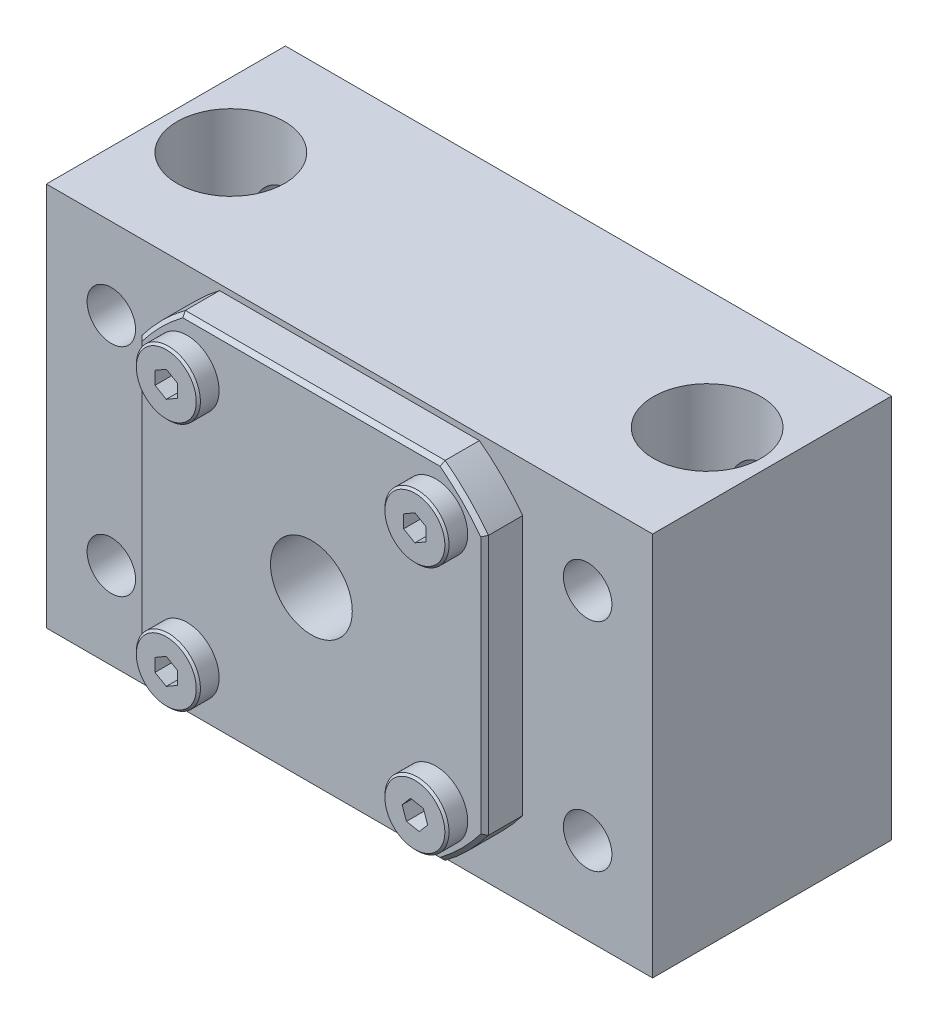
ISO-10303-21;
HEADER;
FILE_DESCRIPTION(('STEP AP214'),'2;1');
FILE_NAME('part.step','',(''),(''),'','','');
FILE_SCHEMA(('AUTOMOTIVE_DESIGN { 1 0 10303 214 1 1 1 1 }'));
ENDSEC;
DATA;
#1=APPLICATION_CONTEXT('core data for automotive mechanical design processes');
#2=APPLICATION_PROTOCOL_DEFINITION('international standard','automotive_design',2000,#1);
#3=PRODUCT_CONTEXT('',#1,'mechanical');
#4=PRODUCT('Part','Part','',(#3));
#5=PRODUCT_RELATED_PRODUCT_CATEGORY('part','',(#4));
#6=PRODUCT_DEFINITION_FORMATION('','',#4);
#7=PRODUCT_DEFINITION_CONTEXT('part definition',#1,'design');
#8=PRODUCT_DEFINITION('design','',#6,#7);
#9=PRODUCT_DEFINITION_SHAPE('','',#8);
#10=(LENGTH_UNIT() NAMED_UNIT(*) SI_UNIT(.MILLI.,.METRE.));
#11=(NAMED_UNIT(*) PLANE_ANGLE_UNIT() SI_UNIT($,.RADIAN.));
#12=(NAMED_UNIT(*) SI_UNIT($,.STERADIAN.) SOLID_ANGLE_UNIT());
#13=UNCERTAINTY_MEASURE_WITH_UNIT(LENGTH_MEASURE(1.E-05),#10,'distance_accuracy_value','');
#14=(GEOMETRIC_REPRESENTATION_CONTEXT(3) GLOBAL_UNCERTAINTY_ASSIGNED_CONTEXT((#13)) GLOBAL_UNIT_ASSIGNED_CONTEXT((#10,
#11,#12)) REPRESENTATION_CONTEXT('',''));
#15=CARTESIAN_POINT('',(0.,0.,0.));
#16=DIRECTION('',(0.,0.,1.));
#17=DIRECTION('',(1.,0.,0.));
#18=AXIS2_PLACEMENT_3D('',#15,#16,#17);
#19=CARTESIAN_POINT('',(19.05,55.5498,5.588));
#20=DIRECTION('',(0.,0.,-1.));
#21=DIRECTION('',(-1.,0.,0.));
#22=AXIS2_PLACEMENT_3D('',#19,#20,#21);
#23=PLANE('',#22);
#24=DIRECTION('',(-1.,0.,0.));
#25=VECTOR('',#24,1.);
#26=CARTESIAN_POINT('',(19.05,54.991,5.588));
#27=LINE('',#26,#25);
#28=CARTESIAN_POINT('',(63.312813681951,54.991,5.588));
#29=VERTEX_POINT('',#28);
#30=CARTESIAN_POINT('',(25.587186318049,54.991,5.588));
#31=VERTEX_POINT('',#30);
#32=EDGE_CURVE('E1622',#29,#31,#27,.T.);
#33=ORIENTED_EDGE('',*,*,#32,.T.);
#34=CARTESIAN_POINT('',(44.45,30.1498,5.588));
#35=DIRECTION('',(0.,0.,-1.));
#36=DIRECTION('',(-1.,0.,0.));
#37=AXIS2_PLACEMENT_3D('',#34,#35,#36);
#38=CIRCLE('',#37,31.1912);
#39=CARTESIAN_POINT('',(19.6088,49.012613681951,5.588));
#40=VERTEX_POINT('',#39);
#41=EDGE_CURVE('E1602',#31,#40,#38,.F.);
#42=ORIENTED_EDGE('',*,*,#41,.T.);
#43=DIRECTION('',(0.,-1.,0.));
#44=VECTOR('',#43,1.);
#45=CARTESIAN_POINT('',(19.6088,55.5498,5.588));
#46=LINE('',#45,#44);
#47=CARTESIAN_POINT('',(19.6088,11.286986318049,5.588));
#48=VERTEX_POINT('',#47);
#49=EDGE_CURVE('E1600',#40,#48,#46,.T.);
#50=ORIENTED_EDGE('',*,*,#49,.T.);
#51=CARTESIAN_POINT('',(44.45,30.1498,5.588));
#52=DIRECTION('',(0.,0.,-1.));
#53=DIRECTION('',(-1.,0.,0.));
#54=AXIS2_PLACEMENT_3D('',#51,#52,#53);
#55=CIRCLE('',#54,31.1912);
#56=CARTESIAN_POINT('',(25.587186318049,5.3086,5.588));
#57=VERTEX_POINT('',#56);
#58=EDGE_CURVE('E1593',#48,#57,#55,.F.);
#59=ORIENTED_EDGE('',*,*,#58,.T.);
#60=DIRECTION('',(1.,0.,0.));
#61=VECTOR('',#60,1.);
#62=CARTESIAN_POINT('',(19.05,5.3086,5.588));
#63=LINE('',#62,#61);
#64=CARTESIAN_POINT('',(63.312813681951,5.30860000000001,5.588));
#65=VERTEX_POINT('',#64);
#66=EDGE_CURVE('E799',#57,#65,#63,.T.);
#67=ORIENTED_EDGE('',*,*,#66,.T.);
#68=CARTESIAN_POINT('',(44.45,30.1498,5.588));
#69=DIRECTION('',(0.,0.,-1.));
#70=DIRECTION('',(-1.,0.,0.));
#71=AXIS2_PLACEMENT_3D('',#68,#69,#70);
#72=CIRCLE('',#71,31.1912);
#73=CARTESIAN_POINT('',(69.2912,11.286986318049,5.588));
#74=VERTEX_POINT('',#73);
#75=EDGE_CURVE('E1589',#65,#74,#72,.F.);
#76=ORIENTED_EDGE('',*,*,#75,.T.);
#77=DIRECTION('',(0.,1.,0.));
#78=VECTOR('',#77,1.);
#79=CARTESIAN_POINT('',(69.2912,55.5498,5.588));
#80=LINE('',#79,#78);
#81=CARTESIAN_POINT('',(69.2912,49.012613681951,5.588));
#82=VERTEX_POINT('',#81);
#83=EDGE_CURVE('E1591',#74,#82,#80,.T.);
#84=ORIENTED_EDGE('',*,*,#83,.T.);
#85=CARTESIAN_POINT('',(44.45,30.1498,5.588));
#86=DIRECTION('',(0.,0.,-1.));
#87=DIRECTION('',(-1.,0.,0.));
#88=AXIS2_PLACEMENT_3D('',#85,#86,#87);
#89=CIRCLE('',#88,31.1912);
#90=EDGE_CURVE('E1595',#82,#29,#89,.F.);
#91=ORIENTED_EDGE('',*,*,#90,.T.);
#92=EDGE_LOOP('',(#33,#42,#50,#59,#67,#76,#84,#91));
#93=FACE_BOUND('',#92,.T.);
#94=CARTESIAN_POINT('',(44.45,30.1498,5.588));
#95=DIRECTION('',(0.,0.,1.));
#96=DIRECTION('',(1.,0.,0.));
#97=AXIS2_PLACEMENT_3D('',#94,#95,#96);
#98=CIRCLE('',#97,6.);
#99=CARTESIAN_POINT('',(50.45,30.1498,5.588));
#100=VERTEX_POINT('',#99);
#101=EDGE_CURVE('E495',#100,#100,#98,.T.);
#102=ORIENTED_EDGE('',*,*,#101,.F.);
#103=EDGE_LOOP('',(#102));
#104=FACE_BOUND('',#103,.T.);
#105=CARTESIAN_POINT('',(26.2200800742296,48.3797199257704,5.588));
#106=DIRECTION('',(0.,0.,-1.));
#107=DIRECTION('',(-1.,0.,0.));
#108=AXIS2_PLACEMENT_3D('',#105,#106,#107);
#109=CIRCLE('',#108,4.699);
#110=CARTESIAN_POINT('',(21.5210800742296,48.3797199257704,5.588));
#111=VERTEX_POINT('',#110);
#112=EDGE_CURVE('E825',#111,#111,#109,.F.);
#113=ORIENTED_EDGE('',*,*,#112,.F.);
#114=EDGE_LOOP('',(#113));
#115=FACE_BOUND('',#114,.T.);
#116=CARTESIAN_POINT('',(62.6799199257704,48.3797199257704,5.588));
#117=DIRECTION('',(0.,0.,-1.));
#118=DIRECTION('',(-1.,0.,0.));
#119=AXIS2_PLACEMENT_3D('',#116,#117,#118);
#120=CIRCLE('',#119,4.69899999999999);
#121=CARTESIAN_POINT('',(57.9809199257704,48.3797199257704,5.588));
#122=VERTEX_POINT('',#121);
#123=EDGE_CURVE('E897',#122,#122,#120,.F.);
#124=ORIENTED_EDGE('',*,*,#123,.F.);
#125=EDGE_LOOP('',(#124));
#126=FACE_BOUND('',#125,.T.);
#127=CARTESIAN_POINT('',(62.6799199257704,11.9198800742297,5.588));
#128=DIRECTION('',(0.,0.,-1.));
#129=DIRECTION('',(-1.,0.,0.));
#130=AXIS2_PLACEMENT_3D('',#127,#128,#129);
#131=CIRCLE('',#130,4.69899999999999);
#132=CARTESIAN_POINT('',(57.9809199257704,11.9198800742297,5.588));
#133=VERTEX_POINT('',#132);
#134=EDGE_CURVE('E900',#133,#133,#131,.F.);
#135=ORIENTED_EDGE('',*,*,#134,.F.);
#136=EDGE_LOOP('',(#135));
#137=FACE_BOUND('',#136,.T.);
#138=CARTESIAN_POINT('',(26.2200800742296,11.9198800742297,5.588));
#139=DIRECTION('',(0.,0.,-1.));
#140=DIRECTION('',(-1.,0.,0.));
#141=AXIS2_PLACEMENT_3D('',#138,#139,#140);
#142=CIRCLE('',#141,4.699);
#143=CARTESIAN_POINT('',(21.5210800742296,11.9198800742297,5.588));
#144=VERTEX_POINT('',#143);
#145=EDGE_CURVE('E903',#144,#144,#142,.F.);
#146=ORIENTED_EDGE('',*,*,#145,.F.);
#147=EDGE_LOOP('',(#146));
#148=FACE_BOUND('',#147,.T.);
#149=ADVANCED_FACE('F31',(#93,#104,#115,#126,#137,#148),#23,.F.);
#150=CARTESIAN_POINT('',(19.05,4.7498,5.588));
#151=DIRECTION('',(1.,0.,0.));
#152=DIRECTION('',(0.,0.,-1.));
#153=AXIS2_PLACEMENT_3D('',#150,#151,#152);
#154=PLANE('',#153);
#155=DIRECTION('',(0.,0.,1.));
#156=VECTOR('',#155,1.);
#157=CARTESIAN_POINT('',(19.05,11.0998,-431.05229381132));
#158=LINE('',#157,#156);
#159=CARTESIAN_POINT('',(19.05,11.0998,5.02920000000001));
#160=VERTEX_POINT('',#159);
#161=CARTESIAN_POINT('',(19.05,11.0998,0.));
#162=VERTEX_POINT('',#161);
#163=EDGE_CURVE('E490',#160,#162,#158,.F.);
#164=ORIENTED_EDGE('',*,*,#163,.F.);
#165=DIRECTION('',(0.,1.,0.));
#166=VECTOR('',#165,1.);
#167=CARTESIAN_POINT('',(19.05,4.7498,5.0292));
#168=LINE('',#167,#166);
#169=CARTESIAN_POINT('',(19.05,49.1998,5.02920000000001));
#170=VERTEX_POINT('',#169);
#171=EDGE_CURVE('E810',#160,#170,#168,.T.);
#172=ORIENTED_EDGE('',*,*,#171,.T.);
#173=DIRECTION('',(0.,0.,1.));
#174=VECTOR('',#173,1.);
#175=CARTESIAN_POINT('',(19.05,49.1998,-431.05229381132));
#176=LINE('',#175,#174);
#177=CARTESIAN_POINT('',(19.05,49.1998,0.));
#178=VERTEX_POINT('',#177);
#179=EDGE_CURVE('E492',#178,#170,#176,.T.);
#180=ORIENTED_EDGE('',*,*,#179,.F.);
#181=DIRECTION('',(0.,-1.,0.));
#182=VECTOR('',#181,1.);
#183=CARTESIAN_POINT('',(19.05,4.7498,0.));
#184=LINE('',#183,#182);
#185=EDGE_CURVE('E498',#178,#162,#184,.T.);
#186=ORIENTED_EDGE('',*,*,#185,.T.);
#187=EDGE_LOOP('',(#164,#172,#180,#186));
#188=FACE_BOUND('',#187,.T.);
#189=ADVANCED_FACE('F615',(#188),#154,.F.);
#190=CARTESIAN_POINT('',(69.85,4.74980000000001,5.588));
#191=DIRECTION('',(0.,1.,0.));
#192=DIRECTION('',(-1.,0.,0.));
#193=AXIS2_PLACEMENT_3D('',#190,#191,#192);
#194=PLANE('',#193);
#195=DIRECTION('',(0.,0.,1.));
#196=VECTOR('',#195,1.);
#197=CARTESIAN_POINT('',(63.5,4.7498,-431.05229381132));
#198=LINE('',#197,#196);
#199=CARTESIAN_POINT('',(63.5,4.7498,5.02920000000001));
#200=VERTEX_POINT('',#199);
#201=CARTESIAN_POINT('',(63.5,4.7498,0.));
#202=VERTEX_POINT('',#201);
#203=EDGE_CURVE('E485',#200,#202,#198,.F.);
#204=ORIENTED_EDGE('',*,*,#203,.F.);
#205=DIRECTION('',(-1.,0.,0.));
#206=VECTOR('',#205,1.);
#207=CARTESIAN_POINT('',(69.85,4.74980000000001,5.0292));
#208=LINE('',#207,#206);
#209=CARTESIAN_POINT('',(25.4,4.7498,5.02920000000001));
#210=VERTEX_POINT('',#209);
#211=EDGE_CURVE('E798',#200,#210,#208,.T.);
#212=ORIENTED_EDGE('',*,*,#211,.T.);
#213=DIRECTION('',(0.,0.,1.));
#214=VECTOR('',#213,1.);
#215=CARTESIAN_POINT('',(25.4,4.7498,-431.05229381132));
#216=LINE('',#215,#214);
#217=CARTESIAN_POINT('',(25.4,4.7498,0.));
#218=VERTEX_POINT('',#217);
#219=EDGE_CURVE('E487',#218,#210,#216,.T.);
#220=ORIENTED_EDGE('',*,*,#219,.F.);
#221=DIRECTION('',(1.,0.,0.));
#222=VECTOR('',#221,1.);
#223=CARTESIAN_POINT('',(69.85,4.74980000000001,0.));
#224=LINE('',#223,#222);
#225=EDGE_CURVE('E501',#218,#202,#224,.T.);
#226=ORIENTED_EDGE('',*,*,#225,.T.);
#227=EDGE_LOOP('',(#204,#212,#220,#226));
#228=FACE_BOUND('',#227,.T.);
#229=ADVANCED_FACE('F623',(#228),#194,.F.);
#230=CARTESIAN_POINT('',(69.85,55.5498,5.588));
#231=DIRECTION('',(-1.,0.,0.));
#232=DIRECTION('',(0.,-1.,0.));
#233=AXIS2_PLACEMENT_3D('',#230,#231,#232);
#234=PLANE('',#233);
#235=DIRECTION('',(0.,0.,1.));
#236=VECTOR('',#235,1.);
#237=CARTESIAN_POINT('',(69.85,49.1998,-431.05229381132));
#238=LINE('',#237,#236);
#239=CARTESIAN_POINT('',(69.85,49.1998,5.02920000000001));
#240=VERTEX_POINT('',#239);
#241=CARTESIAN_POINT('',(69.85,49.1998,0.));
#242=VERTEX_POINT('',#241);
#243=EDGE_CURVE('E478',#240,#242,#238,.F.);
#244=ORIENTED_EDGE('',*,*,#243,.F.);
#245=DIRECTION('',(0.,-1.,0.));
#246=VECTOR('',#245,1.);
#247=CARTESIAN_POINT('',(69.85,55.5498,5.0292));
#248=LINE('',#247,#246);
#249=CARTESIAN_POINT('',(69.85,11.0998,5.02920000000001));
#250=VERTEX_POINT('',#249);
#251=EDGE_CURVE('E819',#240,#250,#248,.T.);
#252=ORIENTED_EDGE('',*,*,#251,.T.);
#253=DIRECTION('',(0.,0.,1.));
#254=VECTOR('',#253,1.);
#255=CARTESIAN_POINT('',(69.85,11.0998,-431.05229381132));
#256=LINE('',#255,#254);
#257=CARTESIAN_POINT('',(69.85,11.0998,0.));
#258=VERTEX_POINT('',#257);
#259=EDGE_CURVE('E482',#258,#250,#256,.T.);
#260=ORIENTED_EDGE('',*,*,#259,.F.);
#261=DIRECTION('',(0.,1.,0.));
#262=VECTOR('',#261,1.);
#263=CARTESIAN_POINT('',(69.85,55.5498,0.));
#264=LINE('',#263,#262);
#265=EDGE_CURVE('E504',#258,#242,#264,.T.);
#266=ORIENTED_EDGE('',*,*,#265,.T.);
#267=EDGE_LOOP('',(#244,#252,#260,#266));
#268=FACE_BOUND('',#267,.T.);
#269=ADVANCED_FACE('F1276',(#268),#234,.F.);
#270=CARTESIAN_POINT('',(19.05,55.5498,5.588));
#271=DIRECTION('',(0.,-1.,0.));
#272=DIRECTION('',(0.,0.,-1.));
#273=AXIS2_PLACEMENT_3D('',#270,#271,#272);
#274=PLANE('',#273);
#275=DIRECTION('',(0.,0.,1.));
#276=VECTOR('',#275,1.);
#277=CARTESIAN_POINT('',(25.4,55.5498,-431.05229381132));
#278=LINE('',#277,#276);
#279=CARTESIAN_POINT('',(25.4,55.5498,5.02920000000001));
#280=VERTEX_POINT('',#279);
#281=CARTESIAN_POINT('',(25.4,55.5498,0.));
#282=VERTEX_POINT('',#281);
#283=EDGE_CURVE('E567',#280,#282,#278,.F.);
#284=ORIENTED_EDGE('',*,*,#283,.F.);
#285=DIRECTION('',(1.,0.,0.));
#286=VECTOR('',#285,1.);
#287=CARTESIAN_POINT('',(19.05,55.5498,5.0292));
#288=LINE('',#287,#286);
#289=CARTESIAN_POINT('',(63.5,55.5498,5.02920000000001));
#290=VERTEX_POINT('',#289);
#291=EDGE_CURVE('E823',#280,#290,#288,.T.);
#292=ORIENTED_EDGE('',*,*,#291,.T.);
#293=DIRECTION('',(0.,0.,1.));
#294=VECTOR('',#293,1.);
#295=CARTESIAN_POINT('',(63.5,55.5498,-431.05229381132));
#296=LINE('',#295,#294);
#297=CARTESIAN_POINT('',(63.5,55.5498,0.));
#298=VERTEX_POINT('',#297);
#299=EDGE_CURVE('E1458',#298,#290,#296,.T.);
#300=ORIENTED_EDGE('',*,*,#299,.F.);
#301=DIRECTION('',(-1.,0.,0.));
#302=VECTOR('',#301,1.);
#303=CARTESIAN_POINT('',(19.05,55.5498,0.));
#304=LINE('',#303,#302);
#305=EDGE_CURVE('E507',#298,#282,#304,.T.);
#306=ORIENTED_EDGE('',*,*,#305,.T.);
#307=EDGE_LOOP('',(#284,#292,#300,#306));
#308=FACE_BOUND('',#307,.T.);
#309=ADVANCED_FACE('F1251',(#308),#274,.F.);
#310=CARTESIAN_POINT('',(0.,56.388,0.));
#311=DIRECTION('',(0.,0.,-1.));
#312=DIRECTION('',(-1.,0.,0.));
#313=AXIS2_PLACEMENT_3D('',#310,#311,#312);
#314=PLANE('',#313);
#315=DIRECTION('',(0.,-1.,0.));
#316=VECTOR('',#315,1.);
#317=CARTESIAN_POINT('',(88.9,56.388,0.));
#318=LINE('',#317,#316);
#319=CARTESIAN_POINT('',(88.9,56.388,0.));
#320=VERTEX_POINT('',#319);
#321=CARTESIAN_POINT('',(88.9,0.,0.));
#322=VERTEX_POINT('',#321);
#323=EDGE_CURVE('E1456',#320,#322,#318,.T.);
#324=ORIENTED_EDGE('',*,*,#323,.F.);
#325=DIRECTION('',(1.,0.,0.));
#326=VECTOR('',#325,1.);
#327=CARTESIAN_POINT('',(0.,56.388,0.));
#328=LINE('',#327,#326);
#329=CARTESIAN_POINT('',(0.,56.388,0.));
#330=VERTEX_POINT('',#329);
#331=EDGE_CURVE('E1444',#330,#320,#328,.T.);
#332=ORIENTED_EDGE('',*,*,#331,.F.);
#333=DIRECTION('',(0.,-1.,0.));
#334=VECTOR('',#333,1.);
#335=CARTESIAN_POINT('',(0.,56.388,0.));
#336=LINE('',#335,#334);
#337=CARTESIAN_POINT('',(0.,0.,0.));
#338=VERTEX_POINT('',#337);
#339=EDGE_CURVE('E1453',#330,#338,#336,.T.);
#340=ORIENTED_EDGE('',*,*,#339,.T.);
#341=DIRECTION('',(1.,0.,0.));
#342=VECTOR('',#341,1.);
#343=CARTESIAN_POINT('',(0.,0.,0.));
#344=LINE('',#343,#342);
#345=EDGE_CURVE('E1495',#338,#322,#344,.T.);
#346=ORIENTED_EDGE('',*,*,#345,.T.);
#347=EDGE_LOOP('',(#324,#332,#340,#346));
#348=FACE_BOUND('',#347,.T.);
#349=CARTESIAN_POINT('',(44.45,30.1498,0.));
#350=DIRECTION('',(0.,0.,-1.));
#351=DIRECTION('',(-1.,0.,0.));
#352=AXIS2_PLACEMENT_3D('',#349,#350,#351);
#353=CIRCLE('',#352,31.75);
#354=EDGE_CURVE('E479',#202,#258,#353,.F.);
#355=ORIENTED_EDGE('',*,*,#354,.F.);
#356=ORIENTED_EDGE('',*,*,#225,.F.);
#357=EDGE_CURVE('E476',#162,#218,#353,.F.);
#358=ORIENTED_EDGE('',*,*,#357,.F.);
#359=ORIENTED_EDGE('',*,*,#185,.F.);
#360=EDGE_CURVE('E480',#282,#178,#353,.F.);
#361=ORIENTED_EDGE('',*,*,#360,.F.);
#362=ORIENTED_EDGE('',*,*,#305,.F.);
#363=EDGE_CURVE('E1583',#242,#298,#353,.F.);
#364=ORIENTED_EDGE('',*,*,#363,.F.);
#365=ORIENTED_EDGE('',*,*,#265,.F.);
#366=EDGE_LOOP('',(#355,#356,#358,#359,#361,#362,#364,#365));
#367=FACE_BOUND('',#366,.T.);
#368=CARTESIAN_POINT('',(79.375,44.45,0.));
#369=DIRECTION('',(0.,0.,1.));
#370=DIRECTION('',(1.,0.,0.));
#371=AXIS2_PLACEMENT_3D('',#368,#369,#370);
#372=CIRCLE('',#371,3.556);
#373=CARTESIAN_POINT('',(82.931,44.45,0.));
#374=VERTEX_POINT('',#373);
#375=EDGE_CURVE('E1514',#374,#374,#372,.T.);
#376=ORIENTED_EDGE('',*,*,#375,.F.);
#377=EDGE_LOOP('',(#376));
#378=FACE_BOUND('',#377,.T.);
#379=CARTESIAN_POINT('',(79.375,12.7,0.));
#380=DIRECTION('',(0.,0.,1.));
#381=DIRECTION('',(1.,0.,0.));
#382=AXIS2_PLACEMENT_3D('',#379,#380,#381);
#383=CIRCLE('',#382,3.556);
#384=CARTESIAN_POINT('',(82.931,12.7,0.));
#385=VERTEX_POINT('',#384);
#386=EDGE_CURVE('E513',#385,#385,#383,.T.);
#387=ORIENTED_EDGE('',*,*,#386,.F.);
#388=EDGE_LOOP('',(#387));
#389=FACE_BOUND('',#388,.T.);
#390=CARTESIAN_POINT('',(9.525,12.7,0.));
#391=DIRECTION('',(0.,0.,1.));
#392=DIRECTION('',(1.,0.,0.));
#393=AXIS2_PLACEMENT_3D('',#390,#391,#392);
#394=CIRCLE('',#393,3.556);
#395=CARTESIAN_POINT('',(13.081,12.7,0.));
#396=VERTEX_POINT('',#395);
#397=EDGE_CURVE('E566',#396,#396,#394,.T.);
#398=ORIENTED_EDGE('',*,*,#397,.F.);
#399=EDGE_LOOP('',(#398));
#400=FACE_BOUND('',#399,.T.);
#401=CARTESIAN_POINT('',(9.525,44.45,0.));
#402=DIRECTION('',(0.,0.,1.));
#403=DIRECTION('',(1.,0.,0.));
#404=AXIS2_PLACEMENT_3D('',#401,#402,#403);
#405=CIRCLE('',#404,3.556);
#406=CARTESIAN_POINT('',(13.081,44.45,0.));
#407=VERTEX_POINT('',#406);
#408=EDGE_CURVE('E1479',#407,#407,#405,.T.);
#409=ORIENTED_EDGE('',*,*,#408,.F.);
#410=EDGE_LOOP('',(#409));
#411=FACE_BOUND('',#410,.T.);
#412=ADVANCED_FACE('F1244',(#348,#367,#378,#389,#400,#411),#314,.F.);
#413=CARTESIAN_POINT('',(79.375,0.,-17.526));
#414=DIRECTION('',(0.,1.,0.));
#415=DIRECTION('',(0.,0.,1.));
#416=AXIS2_PLACEMENT_3D('',#413,#414,#415);
#417=CYLINDRICAL_SURFACE('',#416,5.20700000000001);
#418=CARTESIAN_POINT('',(79.375,9.144,-12.319));
#419=CARTESIAN_POINT('',(79.5527237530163,9.14400572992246,-12.3190051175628));
#420=CARTESIAN_POINT('',(79.7304825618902,9.15740223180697,-12.3281804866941));
#421=CARTESIAN_POINT('',(80.0803120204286,9.2101544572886,-12.3639879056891));
#422=CARTESIAN_POINT('',(80.2523790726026,9.24952628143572,-12.3906307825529));
#423=CARTESIAN_POINT('',(80.5852161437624,9.35176129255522,-12.4587547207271));
#424=CARTESIAN_POINT('',(80.7460366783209,9.41451018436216,-12.5001635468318));
#425=CARTESIAN_POINT('',(81.0541524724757,9.56078047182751,-12.5945405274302));
#426=CARTESIAN_POINT('',(81.2014460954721,9.64430437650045,-12.6475100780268));
#427=CARTESIAN_POINT('',(81.4927388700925,9.83757401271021,-12.7662861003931));
#428=CARTESIAN_POINT('',(81.6353470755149,9.94896457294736,-12.8328071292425));
#429=CARTESIAN_POINT('',(81.901198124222,10.1908520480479,-12.9703885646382));
#430=CARTESIAN_POINT('',(82.0244119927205,10.3213769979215,-13.0414555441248));
#431=CARTESIAN_POINT('',(82.2030287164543,10.5416896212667,-13.1532263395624));
#432=CARTESIAN_POINT('',(82.2653102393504,10.6258206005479,-13.1942561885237));
#433=CARTESIAN_POINT('',(82.3825184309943,10.7997409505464,-13.2747948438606));
#434=CARTESIAN_POINT('',(82.4374433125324,10.8895316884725,-13.3143032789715));
#435=CARTESIAN_POINT('',(82.5904537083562,11.1668831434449,-13.4284635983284));
#436=CARTESIAN_POINT('',(82.677137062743,11.3628666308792,-13.498988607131));
#437=CARTESIAN_POINT('',(82.7943200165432,11.7118853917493,-13.598510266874));
#438=CARTESIAN_POINT('',(82.8338732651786,11.8601661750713,-13.6336181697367));
#439=CARTESIAN_POINT('',(82.8936534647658,12.1633654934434,-13.687565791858));
#440=CARTESIAN_POINT('',(82.9139156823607,12.3182713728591,-13.7064351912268));
#441=CARTESIAN_POINT('',(82.9338100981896,12.6313586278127,-13.7249555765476));
#442=CARTESIAN_POINT('',(82.9333420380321,12.7895522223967,-13.7245131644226));
#443=CARTESIAN_POINT('',(82.9115620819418,13.1032759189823,-13.7042505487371));
#444=CARTESIAN_POINT('',(82.8902351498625,13.2588040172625,-13.6844163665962));
#445=CARTESIAN_POINT('',(82.8299287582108,13.5544986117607,-13.6301278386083));
#446=CARTESIAN_POINT('',(82.7919713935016,13.6950406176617,-13.596526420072));
#447=CARTESIAN_POINT('',(82.7004268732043,13.9678357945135,-13.5187575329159));
#448=CARTESIAN_POINT('',(82.6468275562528,14.1000824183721,-13.4745818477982));
#449=CARTESIAN_POINT('',(82.4953517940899,14.4184914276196,-13.3559311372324));
#450=CARTESIAN_POINT('',(82.3886908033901,14.5989431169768,-13.2772812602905));
#451=CARTESIAN_POINT('',(82.1466761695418,14.9374893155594,-13.1155660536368));
#452=CARTESIAN_POINT('',(82.0112684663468,15.0955407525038,-13.0324926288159));
#453=CARTESIAN_POINT('',(81.7123090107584,15.3881659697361,-12.8699212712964));
#454=CARTESIAN_POINT('',(81.5485128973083,15.5225135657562,-12.7904626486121));
#455=CARTESIAN_POINT('',(81.1959376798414,15.7617798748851,-12.6440656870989));
#456=CARTESIAN_POINT('',(81.0072114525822,15.8667594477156,-12.5771015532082));
#457=CARTESIAN_POINT('',(80.6530267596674,16.0227226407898,-12.4756988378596));
#458=CARTESIAN_POINT('',(80.4916866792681,16.0805174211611,-12.4373406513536));
#459=CARTESIAN_POINT('',(80.1596634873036,16.1726140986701,-12.3757012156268));
#460=CARTESIAN_POINT('',(79.9889867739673,16.2069318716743,-12.352409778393));
#461=CARTESIAN_POINT('',(79.6423456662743,16.2502486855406,-12.3229506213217));
#462=CARTESIAN_POINT('',(79.4663650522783,16.259159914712,-12.3168422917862));
#463=CARTESIAN_POINT('',(79.1153084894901,16.2508478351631,-12.3225181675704));
#464=CARTESIAN_POINT('',(78.9402325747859,16.2336235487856,-12.3343030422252));
#465=CARTESIAN_POINT('',(78.6059284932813,16.175756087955,-12.3735076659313));
#466=CARTESIAN_POINT('',(78.4463577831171,16.1364491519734,-12.4000344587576));
#467=CARTESIAN_POINT('',(78.1365706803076,16.0373492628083,-12.4659360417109));
#468=CARTESIAN_POINT('',(77.9863560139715,15.977552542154,-12.5053131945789));
#469=CARTESIAN_POINT('',(77.6863908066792,15.8342506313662,-12.5977143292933));
#470=CARTESIAN_POINT('',(77.5376216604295,15.7492414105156,-12.6515728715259));
#471=CARTESIAN_POINT('',(77.2558313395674,15.5606046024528,-12.7673003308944));
#472=CARTESIAN_POINT('',(77.122821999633,15.456963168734,-12.8291751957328));
#473=CARTESIAN_POINT('',(76.8527792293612,15.2143232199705,-12.9677149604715));
#474=CARTESIAN_POINT('',(76.7188303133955,15.0723098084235,-13.0451172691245));
#475=CARTESIAN_POINT('',(76.4754723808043,14.767822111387,-13.1986125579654));
#476=CARTESIAN_POINT('',(76.3660753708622,14.6053378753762,-13.2747048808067));
#477=CARTESIAN_POINT('',(76.1869113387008,14.2843996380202,-13.4077864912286));
#478=CARTESIAN_POINT('',(76.1137995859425,14.1283179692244,-13.465969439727));
#479=CARTESIAN_POINT('',(75.990041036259,13.8033040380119,-13.5685520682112));
#480=CARTESIAN_POINT('',(75.9393500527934,13.6343978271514,-13.6129788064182));
#481=CARTESIAN_POINT('',(75.8697135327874,13.316363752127,-13.6753325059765));
#482=CARTESIAN_POINT('',(75.8468405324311,13.1687438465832,-13.6964771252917));
#483=CARTESIAN_POINT('',(75.8199363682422,12.8703919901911,-13.7214318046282));
#484=CARTESIAN_POINT('',(75.815887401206,12.719663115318,-13.725258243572));
#485=CARTESIAN_POINT('',(75.8268934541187,12.41960709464,-13.7149855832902));
#486=CARTESIAN_POINT('',(75.8419421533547,12.270279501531,-13.7008924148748));
#487=CARTESIAN_POINT('',(75.8901146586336,11.9768902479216,-13.6569624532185));
#488=CARTESIAN_POINT('',(75.9232640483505,11.8328363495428,-13.627103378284));
#489=CARTESIAN_POINT('',(76.0190417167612,11.5085300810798,-13.5440988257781));
#490=CARTESIAN_POINT('',(76.0876696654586,11.331188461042,-13.4865793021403));
#491=CARTESIAN_POINT('',(76.2498927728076,10.9929069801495,-13.359810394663));
#492=CARTESIAN_POINT('',(76.3435257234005,10.8319924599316,-13.2905433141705));
#493=CARTESIAN_POINT('',(76.5556515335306,10.524688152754,-13.1463956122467));
#494=CARTESIAN_POINT('',(76.6746201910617,10.3786693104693,-13.0714282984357));
#495=CARTESIAN_POINT('',(76.9348719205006,10.1064835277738,-12.9237193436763));
#496=CARTESIAN_POINT('',(77.07616165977,9.98032254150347,-12.8509783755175));
#497=CARTESIAN_POINT('',(77.3138241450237,9.8002845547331,-12.7433898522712));
#498=CARTESIAN_POINT('',(77.4032169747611,9.73873315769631,-12.705752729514));
#499=CARTESIAN_POINT('',(77.5883041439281,9.62352053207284,-12.6341294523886));
#500=CARTESIAN_POINT('',(77.6839953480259,9.56985542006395,-12.6001415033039));
#501=CARTESIAN_POINT('',(77.8810582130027,9.47116193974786,-12.5368440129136));
#502=CARTESIAN_POINT('',(77.9824223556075,9.42612247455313,-12.5075284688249));
#503=CARTESIAN_POINT('',(78.1901349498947,9.34535331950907,-12.4544673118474));
#504=CARTESIAN_POINT('',(78.2964811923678,9.30961954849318,-12.4307192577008));
#505=CARTESIAN_POINT('',(78.5607684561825,9.23469438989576,-12.380618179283));
#506=CARTESIAN_POINT('',(78.7209320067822,9.20082650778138,-12.3576687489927));
#507=CARTESIAN_POINT('',(79.0457220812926,9.15548306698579,-12.3268616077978));
#508=CARTESIAN_POINT('',(79.2103459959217,9.14399469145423,-12.3189952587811));
#509=CARTESIAN_POINT('',(79.375,9.144,-12.319));
#510=B_SPLINE_CURVE_WITH_KNOTS('',3,(#418,#419,#420,#421,#422,#423,#424,#425,#426,#427,#428,
#429,#430,#431,#432,#433,#434,#435,#436,#437,#438,#439,#440,#441,#442,#443,#444,#445,#446,#447,
#448,#449,#450,#451,#452,#453,#454,#455,#456,#457,#458,#459,#460,#461,#462,#463,#464,#465,#466,
#467,#468,#469,#470,#471,#472,#473,#474,#475,#476,#477,#478,#479,#480,#481,#482,#483,#484,#485,
#486,#487,#488,#489,#490,#491,#492,#493,#494,#495,#496,#497,#498,#499,#500,#501,#502,#503,#504,
#505,#506,#507,#508,#509),.UNSPECIFIED.,.T.,.F.,(4,2,2,2,2,2,2,2,2,2,2,2,2,2,2,2,2,2,2,2,2,2,2,
2,2,2,2,2,2,2,2,2,2,2,2,2,2,2,2,2,2,2,2,2,2,4),(0.,0.532521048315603,1.06537248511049,
1.59565218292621,2.12599595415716,2.70228604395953,3.27942909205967,3.61635077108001,
3.95335415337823,4.62552290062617,5.09603705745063,5.56568938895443,6.0376133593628,
6.50987776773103,6.9564821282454,7.40343464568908,8.07160119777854,8.7410355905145,
9.41654784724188,10.0906496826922,10.6152943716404,11.1395839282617,11.6656833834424,
12.1918025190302,12.6890662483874,13.186421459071,13.7232162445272,14.2604116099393,
14.8879416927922,15.5157779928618,16.0595666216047,16.6022787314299,17.0528901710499,
17.5030753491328,17.9531115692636,18.4037855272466,18.9965828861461,19.5902813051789,
20.1963066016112,20.8025132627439,21.1467129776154,21.4907426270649,21.8343266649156,
22.1777597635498,22.6714021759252,23.1647617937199),.UNSPECIFIED.);
#511=CARTESIAN_POINT('',(79.375,9.144,-12.319));
#512=VERTEX_POINT('',#511);
#513=EDGE_CURVE('E526',#512,#512,#510,.T.);
#514=ORIENTED_EDGE('',*,*,#513,.T.);
#515=EDGE_LOOP('',(#514));
#516=FACE_BOUND('',#515,.T.);
#517=CARTESIAN_POINT('',(82.931,12.7,-21.3296446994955));
#518=CARTESIAN_POINT('',(82.9310037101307,12.6138817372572,-21.3296380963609));
#519=CARTESIAN_POINT('',(82.9278673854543,12.5277915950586,-21.3325797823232));
#520=CARTESIAN_POINT('',(82.9154045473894,12.3564203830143,-21.3441752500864));
#521=CARTESIAN_POINT('',(82.9060764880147,12.2711395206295,-21.3528304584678));
#522=CARTESIAN_POINT('',(82.8814079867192,12.1020419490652,-21.3754452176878));
#523=CARTESIAN_POINT('',(82.8660583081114,12.0182276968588,-21.3894129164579));
#524=CARTESIAN_POINT('',(82.8296360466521,11.8527615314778,-21.422015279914));
#525=CARTESIAN_POINT('',(82.8085604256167,11.7711107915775,-21.4406524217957));
#526=CARTESIAN_POINT('',(82.7377437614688,11.5318738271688,-21.5020122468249));
#527=CARTESIAN_POINT('',(82.6801127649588,11.3780291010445,-21.5504779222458));
#528=CARTESIAN_POINT('',(82.5460410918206,11.0825874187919,-21.6569391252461));
#529=CARTESIAN_POINT('',(82.4695977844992,10.9409921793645,-21.714935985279));
#530=CARTESIAN_POINT('',(82.2854330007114,10.6483855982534,-21.8453714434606));
#531=CARTESIAN_POINT('',(82.1746326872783,10.4996700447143,-21.9186146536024));
#532=CARTESIAN_POINT('',(81.9310239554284,10.2208549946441,-22.0646975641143));
#533=CARTESIAN_POINT('',(81.7981904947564,10.0907769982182,-22.137536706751));
#534=CARTESIAN_POINT('',(81.5724186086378,9.90212539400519,-22.2475138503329));
#535=CARTESIAN_POINT('',(81.4862802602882,9.8365312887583,-22.2867532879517));
#536=CARTESIAN_POINT('',(81.3074572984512,9.71293620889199,-22.3620994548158));
#537=CARTESIAN_POINT('',(81.2147756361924,9.65493184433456,-22.3982075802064));
#538=CARTESIAN_POINT('',(81.0233936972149,9.54722831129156,-22.4662371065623));
#539=CARTESIAN_POINT('',(80.9247009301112,9.49751905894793,-22.4981635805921));
#540=CARTESIAN_POINT('',(80.721888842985,9.40707397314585,-22.5568941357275));
#541=CARTESIAN_POINT('',(80.6177717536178,9.36633448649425,-22.5837003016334));
#542=CARTESIAN_POINT('',(80.3535107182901,9.27723626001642,-22.6427778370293));
#543=CARTESIAN_POINT('',(80.1905333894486,9.23465741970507,-22.6714636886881));
#544=CARTESIAN_POINT('',(79.8583600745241,9.17295959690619,-22.7132161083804));
#545=CARTESIAN_POINT('',(79.6891690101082,9.15382244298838,-22.7262947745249));
#546=CARTESIAN_POINT('',(79.3490023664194,9.14001816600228,-22.7357173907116));
#547=CARTESIAN_POINT('',(79.1780241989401,9.14539358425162,-22.7320322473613));
#548=CARTESIAN_POINT('',(78.8397389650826,9.18040163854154,-22.7081930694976));
#549=CARTESIAN_POINT('',(78.6724329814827,9.21004133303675,-22.6880342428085));
#550=CARTESIAN_POINT('',(78.3492155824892,9.29116495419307,-22.6335424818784));
#551=CARTESIAN_POINT('',(78.1931471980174,9.34221915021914,-22.5994887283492));
#552=CARTESIAN_POINT('',(77.8920652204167,9.46388585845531,-22.5198000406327));
#553=CARTESIAN_POINT('',(77.747053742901,9.53450210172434,-22.4741628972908));
#554=CARTESIAN_POINT('',(77.4544778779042,9.70195655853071,-22.3686512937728));
#555=CARTESIAN_POINT('',(77.3084670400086,9.80085287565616,-22.307752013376));
#556=CARTESIAN_POINT('',(77.034133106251,10.0174475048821,-22.1796188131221));
#557=CARTESIAN_POINT('',(76.9058305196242,10.1351672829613,-22.1123776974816));
#558=CARTESIAN_POINT('',(76.6477313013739,10.4090670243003,-21.9645301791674));
#559=CARTESIAN_POINT('',(76.5214293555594,10.568381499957,-21.8836041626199));
#560=CARTESIAN_POINT('',(76.2966424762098,10.9082561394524,-21.7278131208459));
#561=CARTESIAN_POINT('',(76.1981438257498,11.0888057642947,-21.6529451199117));
#562=CARTESIAN_POINT('',(76.051842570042,11.4245305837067,-21.5355047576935));
#563=CARTESIAN_POINT('',(75.9975605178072,11.5756216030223,-21.4894813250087));
#564=CARTESIAN_POINT('',(75.9314222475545,11.8092341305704,-21.4318252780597));
#565=CARTESIAN_POINT('',(75.9119276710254,11.8882395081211,-21.4145070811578));
#566=CARTESIAN_POINT('',(75.8782934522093,12.0481956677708,-21.3842905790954));
#567=CARTESIAN_POINT('',(75.864151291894,12.1291455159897,-21.37139019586));
#568=CARTESIAN_POINT('',(75.8413632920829,12.2932196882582,-21.3504612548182));
#569=CARTESIAN_POINT('',(75.8327693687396,12.3763571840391,-21.3424787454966));
#570=CARTESIAN_POINT('',(75.8214675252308,12.5433408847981,-21.3319580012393));
#571=CARTESIAN_POINT('',(75.8187569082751,12.6271867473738,-21.3294172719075));
#572=CARTESIAN_POINT('',(75.8192772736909,12.7948632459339,-21.329904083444));
#573=CARTESIAN_POINT('',(75.8225093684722,12.8786938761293,-21.3329326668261));
#574=CARTESIAN_POINT('',(75.8348367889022,13.0455250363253,-21.3443973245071));
#575=CARTESIAN_POINT('',(75.8439319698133,13.1285255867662,-21.3528332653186));
#576=CARTESIAN_POINT('',(75.8769368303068,13.3558350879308,-21.3831038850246));
#577=CARTESIAN_POINT('',(75.9068547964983,13.4986189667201,-21.4102505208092));
#578=CARTESIAN_POINT('',(75.9828566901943,13.7767438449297,-21.4767885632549));
#579=CARTESIAN_POINT('',(76.0289558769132,13.9120776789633,-21.5161915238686));
#580=CARTESIAN_POINT('',(76.1601830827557,14.2337944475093,-21.6232961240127));
#581=CARTESIAN_POINT('',(76.2535209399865,14.4152761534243,-21.6957045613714));
#582=CARTESIAN_POINT('',(76.4678481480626,14.757806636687,-21.8478798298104));
#583=CARTESIAN_POINT('',(76.588889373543,14.9188161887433,-21.9276602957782));
#584=CARTESIAN_POINT('',(76.8586091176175,15.2208071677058,-22.0873124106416));
#585=CARTESIAN_POINT('',(77.0076713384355,15.3614556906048,-22.1671678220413));
#586=CARTESIAN_POINT('',(77.3303821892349,15.6166508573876,-22.3180778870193));
#587=CARTESIAN_POINT('',(77.5039918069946,15.731238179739,-22.3891461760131));
#588=CARTESIAN_POINT('',(77.8409815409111,15.91277232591,-22.5045167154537));
#589=CARTESIAN_POINT('',(78.0009004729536,15.9845370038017,-22.5513239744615));
#590=CARTESIAN_POINT('',(78.3327845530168,16.1044065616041,-22.6304745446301));
#591=CARTESIAN_POINT('',(78.5047419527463,16.1525265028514,-22.6628270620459));
#592=CARTESIAN_POINT('',(78.857197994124,16.2227035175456,-22.7102526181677));
#593=CARTESIAN_POINT('',(79.0377348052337,16.244629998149,-22.7252390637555));
#594=CARTESIAN_POINT('',(79.4006054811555,16.2605379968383,-22.7360963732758));
#595=CARTESIAN_POINT('',(79.5829388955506,16.2545263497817,-22.7319719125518));
#596=CARTESIAN_POINT('',(79.9279826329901,16.2166661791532,-22.706202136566));
#597=CARTESIAN_POINT('',(80.0910574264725,16.1870238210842,-22.6860532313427));
#598=CARTESIAN_POINT('',(80.4093160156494,16.1062146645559,-22.6317925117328));
#599=CARTESIAN_POINT('',(80.5644981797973,16.0550434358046,-22.5976778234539));
#600=CARTESIAN_POINT('',(80.8710422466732,15.9304313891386,-22.5160976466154));
#601=CARTESIAN_POINT('',(81.0218640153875,15.8560402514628,-22.4680703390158));
#602=CARTESIAN_POINT('',(81.3091855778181,15.68860195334,-22.3628600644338));
#603=CARTESIAN_POINT('',(81.4456819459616,15.5955503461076,-22.3056749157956));
#604=CARTESIAN_POINT('',(81.723350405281,15.377004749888,-22.1762798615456));
#605=CARTESIAN_POINT('',(81.8618701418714,15.2487091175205,-22.1031223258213));
#606=CARTESIAN_POINT('',(82.1169340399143,14.9720948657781,-21.9550423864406));
#607=CARTESIAN_POINT('',(82.2334282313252,14.8237319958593,-21.8801163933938));
#608=CARTESIAN_POINT('',(82.3972910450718,14.576811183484,-21.7667367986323));
#609=CARTESIAN_POINT('',(82.4527990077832,14.4843815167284,-21.7264942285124));
#610=CARTESIAN_POINT('',(82.5556845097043,14.2937730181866,-21.6491335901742));
#611=CARTESIAN_POINT('',(82.6030596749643,14.1955925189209,-21.6120164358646));
#612=CARTESIAN_POINT('',(82.6889328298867,13.9941885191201,-21.5426825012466));
#613=CARTESIAN_POINT('',(82.7274615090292,13.8909840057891,-21.5104489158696));
#614=CARTESIAN_POINT('',(82.7951344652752,13.679842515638,-21.452514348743));
#615=CARTESIAN_POINT('',(82.8242869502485,13.5719097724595,-21.4268076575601));
#616=CARTESIAN_POINT('',(82.8755029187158,13.3384404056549,-21.3809538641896));
#617=CARTESIAN_POINT('',(82.896230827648,13.2123858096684,-21.3618983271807));
#618=CARTESIAN_POINT('',(82.9239721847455,12.9575319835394,-21.3362526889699));
#619=CARTESIAN_POINT('',(82.9309944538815,12.8287345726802,-21.3296545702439));
#620=CARTESIAN_POINT('',(82.931,12.7,-21.3296446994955));
#621=B_SPLINE_CURVE_WITH_KNOTS('',3,(#517,#518,#519,#520,#521,#522,#523,#524,#525,#526,#527,
#528,#529,#530,#531,#532,#533,#534,#535,#536,#537,#538,#539,#540,#541,#542,#543,#544,#545,#546,
#547,#548,#549,#550,#551,#552,#553,#554,#555,#556,#557,#558,#559,#560,#561,#562,#563,#564,#565,
#566,#567,#568,#569,#570,#571,#572,#573,#574,#575,#576,#577,#578,#579,#580,#581,#582,#583,#584,
#585,#586,#587,#588,#589,#590,#591,#592,#593,#594,#595,#596,#597,#598,#599,#600,#601,#602,#603,
#604,#605,#606,#607,#608,#609,#610,#611,#612,#613,#614,#615,#616,#617,#618,#619,#620),
.UNSPECIFIED.,.T.,.F.,(4,2,2,2,2,2,2,2,2,2,2,2,2,2,2,2,2,2,2,2,2,2,2,2,2,2,2,2,2,2,2,2,2,2,2,2,
2,2,2,2,2,2,2,2,2,2,2,2,2,2,2,4),(0.,0.258200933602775,0.516466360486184,0.775129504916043,
1.03393016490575,1.54555575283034,2.05725292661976,2.65330486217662,3.25003895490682,
3.59511439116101,3.94003517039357,4.28453354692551,4.62889135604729,5.13909486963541,
5.64890263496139,6.15959550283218,6.67043698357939,7.17148375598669,7.67262615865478,
8.23023782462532,8.78848997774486,9.4421831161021,10.0955531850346,10.5945463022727,
10.8438728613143,11.0930819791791,11.3445904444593,11.595983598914,11.8474238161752,
12.0988578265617,12.5420706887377,12.9857026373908,13.6318686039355,14.2792545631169,
14.9362536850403,15.592220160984,16.1342458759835,16.675925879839,17.2202954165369,
17.7645317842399,18.2631850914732,18.7619410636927,19.2846165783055,19.8074167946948,
20.4125964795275,21.0191330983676,21.3639872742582,21.7089419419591,22.0526812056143,
22.3961187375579,22.7823411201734,23.1683148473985),.UNSPECIFIED.);
#622=CARTESIAN_POINT('',(82.931,12.7,-21.3296446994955));
#623=VERTEX_POINT('',#622);
#624=EDGE_CURVE('E517',#623,#623,#621,.T.);
#625=ORIENTED_EDGE('',*,*,#624,.T.);
#626=EDGE_LOOP('',(#625));
#627=FACE_BOUND('',#626,.T.);
#628=CARTESIAN_POINT('',(79.375,0.,-17.526));
#629=DIRECTION('',(0.,1.,0.));
#630=DIRECTION('',(0.,0.,1.));
#631=AXIS2_PLACEMENT_3D('',#628,#629,#630);
#632=CIRCLE('',#631,5.20700000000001);
#633=CARTESIAN_POINT('',(79.375,0.,-12.319));
#634=VERTEX_POINT('',#633);
#635=EDGE_CURVE('E1486',#634,#634,#632,.T.);
#636=ORIENTED_EDGE('',*,*,#635,.F.);
#637=EDGE_LOOP('',(#636));
#638=FACE_BOUND('',#637,.T.);
#639=CARTESIAN_POINT('',(79.375,30.988,-17.526));
#640=DIRECTION('',(0.,1.,0.));
#641=DIRECTION('',(0.,0.,1.));
#642=AXIS2_PLACEMENT_3D('',#639,#640,#641);
#643=CIRCLE('',#642,5.20700000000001);
#644=CARTESIAN_POINT('',(79.375,30.988,-12.319));
#645=VERTEX_POINT('',#644);
#646=EDGE_CURVE('E1468',#645,#645,#643,.F.);
#647=ORIENTED_EDGE('',*,*,#646,.F.);
#648=EDGE_LOOP('',(#647));
#649=FACE_BOUND('',#648,.T.);
#650=ADVANCED_FACE('F530',(#516,#627,#638,#649),#417,.F.);
#651=CARTESIAN_POINT('',(9.52500000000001,0.,-17.526));
#652=DIRECTION('',(0.,1.,0.));
#653=DIRECTION('',(0.,0.,1.));
#654=AXIS2_PLACEMENT_3D('',#651,#652,#653);
#655=CYLINDRICAL_SURFACE('',#654,5.207);
#656=CARTESIAN_POINT('',(9.52500000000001,9.144,-12.319));
#657=CARTESIAN_POINT('',(9.70272375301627,9.14400572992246,-12.3190051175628));
#658=CARTESIAN_POINT('',(9.88048256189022,9.15740223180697,-12.3281804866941));
#659=CARTESIAN_POINT('',(10.2303120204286,9.2101544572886,-12.3639879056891));
#660=CARTESIAN_POINT('',(10.4023790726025,9.24952628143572,-12.3906307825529));
#661=CARTESIAN_POINT('',(10.7352161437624,9.35176129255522,-12.4587547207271));
#662=CARTESIAN_POINT('',(10.8960366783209,9.41451018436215,-12.5001635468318));
#663=CARTESIAN_POINT('',(11.2041524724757,9.5607804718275,-12.5945405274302));
#664=CARTESIAN_POINT('',(11.3514460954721,9.64430437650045,-12.6475100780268));
#665=CARTESIAN_POINT('',(11.6427388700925,9.8375740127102,-12.7662861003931));
#666=CARTESIAN_POINT('',(11.7853470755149,9.94896457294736,-12.8328071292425));
#667=CARTESIAN_POINT('',(12.051198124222,10.1908520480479,-12.9703885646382));
#668=CARTESIAN_POINT('',(12.1744119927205,10.3213769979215,-13.0414555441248));
#669=CARTESIAN_POINT('',(12.3530287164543,10.5416896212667,-13.1532263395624));
#670=CARTESIAN_POINT('',(12.4153102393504,10.6258206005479,-13.1942561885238));
#671=CARTESIAN_POINT('',(12.5325184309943,10.7997409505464,-13.2747948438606));
#672=CARTESIAN_POINT('',(12.5874433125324,10.8895316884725,-13.3143032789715));
#673=CARTESIAN_POINT('',(12.7404537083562,11.1668831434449,-13.4284635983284));
#674=CARTESIAN_POINT('',(12.827137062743,11.3628666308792,-13.498988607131));
#675=CARTESIAN_POINT('',(12.9443200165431,11.7118853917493,-13.598510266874));
#676=CARTESIAN_POINT('',(12.9838732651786,11.8601661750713,-13.6336181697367));
#677=CARTESIAN_POINT('',(13.0436534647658,12.1633654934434,-13.687565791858));
#678=CARTESIAN_POINT('',(13.0639156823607,12.3182713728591,-13.7064351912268));
#679=CARTESIAN_POINT('',(13.0838100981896,12.6313586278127,-13.7249555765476));
#680=CARTESIAN_POINT('',(13.0833420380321,12.7895522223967,-13.7245131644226));
#681=CARTESIAN_POINT('',(13.0615620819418,13.1032759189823,-13.7042505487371));
#682=CARTESIAN_POINT('',(13.0402351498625,13.2588040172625,-13.6844163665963));
#683=CARTESIAN_POINT('',(12.9799287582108,13.5544986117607,-13.6301278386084));
#684=CARTESIAN_POINT('',(12.9419713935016,13.6950406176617,-13.596526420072));
#685=CARTESIAN_POINT('',(12.8504268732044,13.9678357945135,-13.5187575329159));
#686=CARTESIAN_POINT('',(12.7968275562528,14.1000824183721,-13.4745818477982));
#687=CARTESIAN_POINT('',(12.6453517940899,14.4184914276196,-13.3559311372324));
#688=CARTESIAN_POINT('',(12.5386908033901,14.5989431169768,-13.2772812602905));
#689=CARTESIAN_POINT('',(12.2966761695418,14.9374893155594,-13.1155660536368));
#690=CARTESIAN_POINT('',(12.1612684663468,15.0955407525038,-13.0324926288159));
#691=CARTESIAN_POINT('',(11.8623090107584,15.3881659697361,-12.8699212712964));
#692=CARTESIAN_POINT('',(11.6985128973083,15.5225135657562,-12.7904626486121));
#693=CARTESIAN_POINT('',(11.3459376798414,15.7617798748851,-12.6440656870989));
#694=CARTESIAN_POINT('',(11.1572114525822,15.8667594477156,-12.5771015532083));
#695=CARTESIAN_POINT('',(10.8030267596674,16.0227226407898,-12.4756988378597));
#696=CARTESIAN_POINT('',(10.6416866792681,16.0805174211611,-12.4373406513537));
#697=CARTESIAN_POINT('',(10.3096634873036,16.1726140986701,-12.3757012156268));
#698=CARTESIAN_POINT('',(10.1389867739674,16.2069318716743,-12.352409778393));
#699=CARTESIAN_POINT('',(9.7923456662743,16.2502486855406,-12.3229506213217));
#700=CARTESIAN_POINT('',(9.61636505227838,16.259159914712,-12.3168422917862));
#701=CARTESIAN_POINT('',(9.26530848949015,16.2508478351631,-12.3225181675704));
#702=CARTESIAN_POINT('',(9.09023257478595,16.2336235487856,-12.3343030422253));
#703=CARTESIAN_POINT('',(8.75592849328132,16.175756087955,-12.3735076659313));
#704=CARTESIAN_POINT('',(8.5963577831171,16.1364491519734,-12.4000344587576));
#705=CARTESIAN_POINT('',(8.28657068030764,16.0373492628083,-12.4659360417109));
#706=CARTESIAN_POINT('',(8.13635601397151,15.977552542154,-12.5053131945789));
#707=CARTESIAN_POINT('',(7.83639080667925,15.8342506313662,-12.5977143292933));
#708=CARTESIAN_POINT('',(7.68762166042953,15.7492414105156,-12.6515728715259));
#709=CARTESIAN_POINT('',(7.40583133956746,15.5606046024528,-12.7673003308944));
#710=CARTESIAN_POINT('',(7.27282199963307,15.456963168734,-12.8291751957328));
#711=CARTESIAN_POINT('',(7.00277922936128,15.2143232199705,-12.9677149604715));
#712=CARTESIAN_POINT('',(6.86883031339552,15.0723098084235,-13.0451172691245));
#713=CARTESIAN_POINT('',(6.62547238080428,14.767822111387,-13.1986125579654));
#714=CARTESIAN_POINT('',(6.51607537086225,14.6053378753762,-13.2747048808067));
#715=CARTESIAN_POINT('',(6.3369113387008,14.2843996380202,-13.4077864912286));
#716=CARTESIAN_POINT('',(6.26379958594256,14.1283179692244,-13.465969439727));
#717=CARTESIAN_POINT('',(6.14004103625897,13.803304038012,-13.5685520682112));
#718=CARTESIAN_POINT('',(6.0893500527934,13.6343978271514,-13.6129788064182));
#719=CARTESIAN_POINT('',(6.01971353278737,13.316363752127,-13.6753325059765));
#720=CARTESIAN_POINT('',(5.99684053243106,13.1687438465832,-13.6964771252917));
#721=CARTESIAN_POINT('',(5.96993636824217,12.8703919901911,-13.7214318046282));
#722=CARTESIAN_POINT('',(5.96588740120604,12.719663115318,-13.7252582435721));
#723=CARTESIAN_POINT('',(5.9768934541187,12.41960709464,-13.7149855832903));
#724=CARTESIAN_POINT('',(5.99194215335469,12.270279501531,-13.7008924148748));
#725=CARTESIAN_POINT('',(6.04011465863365,11.9768902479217,-13.6569624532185));
#726=CARTESIAN_POINT('',(6.07326404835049,11.8328363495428,-13.627103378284));
#727=CARTESIAN_POINT('',(6.16904171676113,11.5085300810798,-13.5440988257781));
#728=CARTESIAN_POINT('',(6.23766966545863,11.331188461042,-13.4865793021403));
#729=CARTESIAN_POINT('',(6.39989277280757,10.9929069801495,-13.3598103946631));
#730=CARTESIAN_POINT('',(6.49352572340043,10.8319924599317,-13.2905433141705));
#731=CARTESIAN_POINT('',(6.70565153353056,10.524688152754,-13.1463956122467));
#732=CARTESIAN_POINT('',(6.8246201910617,10.3786693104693,-13.0714282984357));
#733=CARTESIAN_POINT('',(7.08487192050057,10.1064835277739,-12.9237193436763));
#734=CARTESIAN_POINT('',(7.22616165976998,9.9803225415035,-12.8509783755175));
#735=CARTESIAN_POINT('',(7.4638241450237,9.80028455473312,-12.7433898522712));
#736=CARTESIAN_POINT('',(7.55321697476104,9.73873315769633,-12.705752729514));
#737=CARTESIAN_POINT('',(7.73830414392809,9.62352053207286,-12.6341294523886));
#738=CARTESIAN_POINT('',(7.83399534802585,9.56985542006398,-12.600141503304));
#739=CARTESIAN_POINT('',(8.03105821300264,9.47116193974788,-12.5368440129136));
#740=CARTESIAN_POINT('',(8.13242235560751,9.42612247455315,-12.5075284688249));
#741=CARTESIAN_POINT('',(8.34013494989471,9.34535331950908,-12.4544673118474));
#742=CARTESIAN_POINT('',(8.44648119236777,9.30961954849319,-12.4307192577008));
#743=CARTESIAN_POINT('',(8.71076845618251,9.23469438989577,-12.380618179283));
#744=CARTESIAN_POINT('',(8.87093200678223,9.20082650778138,-12.3576687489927));
#745=CARTESIAN_POINT('',(9.19572208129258,9.15548306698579,-12.3268616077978));
#746=CARTESIAN_POINT('',(9.36034599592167,9.14399469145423,-12.3189952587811));
#747=CARTESIAN_POINT('',(9.52500000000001,9.144,-12.319));
#748=B_SPLINE_CURVE_WITH_KNOTS('',3,(#656,#657,#658,#659,#660,#661,#662,#663,#664,#665,#666,
#667,#668,#669,#670,#671,#672,#673,#674,#675,#676,#677,#678,#679,#680,#681,#682,#683,#684,#685,
#686,#687,#688,#689,#690,#691,#692,#693,#694,#695,#696,#697,#698,#699,#700,#701,#702,#703,#704,
#705,#706,#707,#708,#709,#710,#711,#712,#713,#714,#715,#716,#717,#718,#719,#720,#721,#722,#723,
#724,#725,#726,#727,#728,#729,#730,#731,#732,#733,#734,#735,#736,#737,#738,#739,#740,#741,#742,
#743,#744,#745,#746,#747),.UNSPECIFIED.,.T.,.F.,(4,2,2,2,2,2,2,2,2,2,2,2,2,2,2,2,2,2,2,2,2,2,2,
2,2,2,2,2,2,2,2,2,2,2,2,2,2,2,2,2,2,2,2,2,2,4),(0.,0.532521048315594,1.06537248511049,
1.59565218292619,2.12599595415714,2.70228604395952,3.27942909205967,3.61635077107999,
3.95335415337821,4.62552290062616,5.09603705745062,5.56568938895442,6.03761335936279,
6.50987776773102,6.95648212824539,7.40343464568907,8.07160119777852,8.74103559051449,
9.41654784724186,10.0906496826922,10.6152943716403,11.1395839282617,11.6656833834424,
12.1918025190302,12.6890662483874,13.1864214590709,13.7232162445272,14.2604116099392,
14.8879416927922,15.5157779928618,16.0595666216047,16.6022787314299,17.0528901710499,
17.5030753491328,17.9531115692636,18.4037855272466,18.9965828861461,19.5902813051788,
20.1963066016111,20.8025132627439,21.1467129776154,21.4907426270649,21.8343266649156,
22.1777597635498,22.6714021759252,23.1647617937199),.UNSPECIFIED.);
#749=CARTESIAN_POINT('',(9.52500000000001,9.144,-12.319));
#750=VERTEX_POINT('',#749);
#751=EDGE_CURVE('E1522',#750,#750,#748,.T.);
#752=ORIENTED_EDGE('',*,*,#751,.T.);
#753=EDGE_LOOP('',(#752));
#754=FACE_BOUND('',#753,.T.);
#755=CARTESIAN_POINT('',(13.081,12.7,-21.3296446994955));
#756=CARTESIAN_POINT('',(13.0810037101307,12.6138817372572,-21.3296380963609));
#757=CARTESIAN_POINT('',(13.0778673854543,12.5277915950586,-21.3325797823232));
#758=CARTESIAN_POINT('',(13.0654045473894,12.3564203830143,-21.3441752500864));
#759=CARTESIAN_POINT('',(13.0560764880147,12.2711395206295,-21.3528304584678));
#760=CARTESIAN_POINT('',(13.0314079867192,12.1020419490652,-21.3754452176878));
#761=CARTESIAN_POINT('',(13.0160583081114,12.0182276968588,-21.3894129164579));
#762=CARTESIAN_POINT('',(12.9796360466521,11.8527615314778,-21.422015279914));
#763=CARTESIAN_POINT('',(12.9585604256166,11.7711107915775,-21.4406524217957));
#764=CARTESIAN_POINT('',(12.8877437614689,11.5318738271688,-21.5020122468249));
#765=CARTESIAN_POINT('',(12.8301127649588,11.3780291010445,-21.5504779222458));
#766=CARTESIAN_POINT('',(12.6960410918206,11.0825874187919,-21.6569391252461));
#767=CARTESIAN_POINT('',(12.6195977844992,10.9409921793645,-21.714935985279));
#768=CARTESIAN_POINT('',(12.4354330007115,10.6483855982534,-21.8453714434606));
#769=CARTESIAN_POINT('',(12.3246326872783,10.4996700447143,-21.9186146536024));
#770=CARTESIAN_POINT('',(12.0810239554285,10.2208549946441,-22.0646975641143));
#771=CARTESIAN_POINT('',(11.9481904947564,10.0907769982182,-22.137536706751));
#772=CARTESIAN_POINT('',(11.7224186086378,9.90212539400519,-22.2475138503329));
#773=CARTESIAN_POINT('',(11.6362802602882,9.83653128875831,-22.2867532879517));
#774=CARTESIAN_POINT('',(11.4574572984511,9.71293620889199,-22.3620994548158));
#775=CARTESIAN_POINT('',(11.3647756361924,9.65493184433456,-22.3982075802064));
#776=CARTESIAN_POINT('',(11.1733936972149,9.54722831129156,-22.4662371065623));
#777=CARTESIAN_POINT('',(11.0747009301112,9.49751905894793,-22.4981635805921));
#778=CARTESIAN_POINT('',(10.871888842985,9.40707397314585,-22.5568941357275));
#779=CARTESIAN_POINT('',(10.7677717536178,9.36633448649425,-22.5837003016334));
#780=CARTESIAN_POINT('',(10.5035107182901,9.27723626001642,-22.6427778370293));
#781=CARTESIAN_POINT('',(10.3405333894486,9.23465741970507,-22.6714636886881));
#782=CARTESIAN_POINT('',(10.0083600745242,9.17295959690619,-22.7132161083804));
#783=CARTESIAN_POINT('',(9.83916901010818,9.15382244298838,-22.7262947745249));
#784=CARTESIAN_POINT('',(9.49900236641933,9.14001816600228,-22.7357173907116));
#785=CARTESIAN_POINT('',(9.32802419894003,9.14539358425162,-22.7320322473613));
#786=CARTESIAN_POINT('',(8.98973896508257,9.18040163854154,-22.7081930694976));
#787=CARTESIAN_POINT('',(8.82243298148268,9.21004133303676,-22.6880342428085));
#788=CARTESIAN_POINT('',(8.49921558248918,9.29116495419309,-22.6335424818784));
#789=CARTESIAN_POINT('',(8.34314719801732,9.34221915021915,-22.5994887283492));
#790=CARTESIAN_POINT('',(8.04206522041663,9.46388585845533,-22.5198000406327));
#791=CARTESIAN_POINT('',(7.89705374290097,9.53450210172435,-22.4741628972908));
#792=CARTESIAN_POINT('',(7.60447787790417,9.70195655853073,-22.3686512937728));
#793=CARTESIAN_POINT('',(7.45846704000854,9.80085287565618,-22.307752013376));
#794=CARTESIAN_POINT('',(7.18413310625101,10.0174475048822,-22.1796188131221));
#795=CARTESIAN_POINT('',(7.05583051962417,10.1351672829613,-22.1123776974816));
#796=CARTESIAN_POINT('',(6.7977313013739,10.4090670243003,-21.9645301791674));
#797=CARTESIAN_POINT('',(6.67142935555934,10.568381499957,-21.8836041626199));
#798=CARTESIAN_POINT('',(6.44664247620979,10.9082561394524,-21.7278131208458));
#799=CARTESIAN_POINT('',(6.34814382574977,11.0888057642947,-21.6529451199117));
#800=CARTESIAN_POINT('',(6.20184257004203,11.4245305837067,-21.5355047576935));
#801=CARTESIAN_POINT('',(6.14756051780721,11.5756216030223,-21.4894813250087));
#802=CARTESIAN_POINT('',(6.08142224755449,11.8092341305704,-21.4318252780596));
#803=CARTESIAN_POINT('',(6.06192767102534,11.8882395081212,-21.4145070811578));
#804=CARTESIAN_POINT('',(6.02829345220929,12.0481956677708,-21.3842905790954));
#805=CARTESIAN_POINT('',(6.01415129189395,12.1291455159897,-21.37139019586));
#806=CARTESIAN_POINT('',(5.99136329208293,12.2932196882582,-21.3504612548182));
#807=CARTESIAN_POINT('',(5.98276936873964,12.3763571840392,-21.3424787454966));
#808=CARTESIAN_POINT('',(5.97146752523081,12.5433408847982,-21.3319580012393));
#809=CARTESIAN_POINT('',(5.96875690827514,12.6271867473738,-21.3294172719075));
#810=CARTESIAN_POINT('',(5.96927727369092,12.7948632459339,-21.329904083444));
#811=CARTESIAN_POINT('',(5.97250936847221,12.8786938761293,-21.3329326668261));
#812=CARTESIAN_POINT('',(5.98483678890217,13.0455250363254,-21.3443973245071));
#813=CARTESIAN_POINT('',(5.99393196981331,13.1285255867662,-21.3528332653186));
#814=CARTESIAN_POINT('',(6.02693683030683,13.3558350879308,-21.3831038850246));
#815=CARTESIAN_POINT('',(6.05685479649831,13.4986189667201,-21.4102505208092));
#816=CARTESIAN_POINT('',(6.13285669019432,13.7767438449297,-21.4767885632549));
#817=CARTESIAN_POINT('',(6.17895587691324,13.9120776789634,-21.5161915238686));
#818=CARTESIAN_POINT('',(6.3101830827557,14.2337944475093,-21.6232961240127));
#819=CARTESIAN_POINT('',(6.40352093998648,14.4152761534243,-21.6957045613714));
#820=CARTESIAN_POINT('',(6.61784814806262,14.757806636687,-21.8478798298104));
#821=CARTESIAN_POINT('',(6.73888937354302,14.9188161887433,-21.9276602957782));
#822=CARTESIAN_POINT('',(7.00860911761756,15.2208071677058,-22.0873124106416));
#823=CARTESIAN_POINT('',(7.15767133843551,15.3614556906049,-22.1671678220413));
#824=CARTESIAN_POINT('',(7.48038218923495,15.6166508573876,-22.3180778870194));
#825=CARTESIAN_POINT('',(7.65399180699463,15.7312381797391,-22.3891461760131));
#826=CARTESIAN_POINT('',(7.99098154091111,15.91277232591,-22.5045167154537));
#827=CARTESIAN_POINT('',(8.15090047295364,15.9845370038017,-22.5513239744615));
#828=CARTESIAN_POINT('',(8.48278455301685,16.1044065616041,-22.6304745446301));
#829=CARTESIAN_POINT('',(8.65474195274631,16.1525265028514,-22.6628270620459));
#830=CARTESIAN_POINT('',(9.00719799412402,16.2227035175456,-22.7102526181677));
#831=CARTESIAN_POINT('',(9.18773480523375,16.2446299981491,-22.7252390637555));
#832=CARTESIAN_POINT('',(9.55060548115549,16.2605379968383,-22.7360963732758));
#833=CARTESIAN_POINT('',(9.73293889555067,16.2545263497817,-22.7319719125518));
#834=CARTESIAN_POINT('',(10.0779826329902,16.2166661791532,-22.706202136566));
#835=CARTESIAN_POINT('',(10.2410574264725,16.1870238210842,-22.6860532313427));
#836=CARTESIAN_POINT('',(10.5593160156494,16.1062146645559,-22.6317925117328));
#837=CARTESIAN_POINT('',(10.7144981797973,16.0550434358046,-22.5976778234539));
#838=CARTESIAN_POINT('',(11.0210422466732,15.9304313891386,-22.5160976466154));
#839=CARTESIAN_POINT('',(11.1718640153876,15.8560402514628,-22.4680703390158));
#840=CARTESIAN_POINT('',(11.4591855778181,15.68860195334,-22.3628600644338));
#841=CARTESIAN_POINT('',(11.5956819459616,15.5955503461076,-22.3056749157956));
#842=CARTESIAN_POINT('',(11.873350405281,15.377004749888,-22.1762798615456));
#843=CARTESIAN_POINT('',(12.0118701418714,15.2487091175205,-22.1031223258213));
#844=CARTESIAN_POINT('',(12.2669340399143,14.9720948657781,-21.9550423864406));
#845=CARTESIAN_POINT('',(12.3834282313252,14.8237319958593,-21.8801163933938));
#846=CARTESIAN_POINT('',(12.5472910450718,14.576811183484,-21.7667367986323));
#847=CARTESIAN_POINT('',(12.6027990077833,14.4843815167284,-21.7264942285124));
#848=CARTESIAN_POINT('',(12.7056845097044,14.2937730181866,-21.6491335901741));
#849=CARTESIAN_POINT('',(12.7530596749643,14.1955925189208,-21.6120164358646));
#850=CARTESIAN_POINT('',(12.8389328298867,13.99418851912,-21.5426825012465));
#851=CARTESIAN_POINT('',(12.8774615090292,13.890984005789,-21.5104489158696));
#852=CARTESIAN_POINT('',(12.9451344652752,13.679842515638,-21.452514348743));
#853=CARTESIAN_POINT('',(12.9742869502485,13.5719097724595,-21.4268076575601));
#854=CARTESIAN_POINT('',(13.0255029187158,13.3384404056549,-21.3809538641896));
#855=CARTESIAN_POINT('',(13.046230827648,13.2123858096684,-21.3618983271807));
#856=CARTESIAN_POINT('',(13.0739721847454,12.9575319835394,-21.3362526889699));
#857=CARTESIAN_POINT('',(13.0809944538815,12.8287345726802,-21.3296545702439));
#858=CARTESIAN_POINT('',(13.081,12.7,-21.3296446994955));
#859=B_SPLINE_CURVE_WITH_KNOTS('',3,(#755,#756,#757,#758,#759,#760,#761,#762,#763,#764,#765,
#766,#767,#768,#769,#770,#771,#772,#773,#774,#775,#776,#777,#778,#779,#780,#781,#782,#783,#784,
#785,#786,#787,#788,#789,#790,#791,#792,#793,#794,#795,#796,#797,#798,#799,#800,#801,#802,#803,
#804,#805,#806,#807,#808,#809,#810,#811,#812,#813,#814,#815,#816,#817,#818,#819,#820,#821,#822,
#823,#824,#825,#826,#827,#828,#829,#830,#831,#832,#833,#834,#835,#836,#837,#838,#839,#840,#841,
#842,#843,#844,#845,#846,#847,#848,#849,#850,#851,#852,#853,#854,#855,#856,#857,#858),
.UNSPECIFIED.,.T.,.F.,(4,2,2,2,2,2,2,2,2,2,2,2,2,2,2,2,2,2,2,2,2,2,2,2,2,2,2,2,2,2,2,2,2,2,2,2,
2,2,2,2,2,2,2,2,2,2,2,2,2,2,2,4),(0.,0.25820093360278,0.516466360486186,0.775129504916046,
1.03393016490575,1.54555575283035,2.05725292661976,2.65330486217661,3.25003895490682,
3.59511439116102,3.94003517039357,4.28453354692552,4.62889135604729,5.1390948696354,
5.64890263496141,6.1595955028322,6.67043698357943,7.17148375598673,7.67262615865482,
8.23023782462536,8.78848997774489,9.44218311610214,10.0955531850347,10.5945463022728,
10.8438728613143,11.0930819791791,11.3445904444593,11.595983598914,11.8474238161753,
12.0988578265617,12.5420706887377,12.9857026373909,13.6318686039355,14.2792545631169,
14.9362536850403,15.5922201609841,16.1342458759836,16.675925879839,17.220295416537,
17.7645317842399,18.2631850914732,18.7619410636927,19.2846165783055,19.8074167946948,
20.4125964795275,21.0191330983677,21.3639872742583,21.7089419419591,22.0526812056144,
22.3961187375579,22.7823411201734,23.1683148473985),.UNSPECIFIED.);
#860=CARTESIAN_POINT('',(13.081,12.7,-21.3296446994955));
#861=VERTEX_POINT('',#860);
#862=EDGE_CURVE('E1525',#861,#861,#859,.T.);
#863=ORIENTED_EDGE('',*,*,#862,.T.);
#864=EDGE_LOOP('',(#863));
#865=FACE_BOUND('',#864,.T.);
#866=CARTESIAN_POINT('',(9.52500000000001,0.,-17.526));
#867=DIRECTION('',(0.,1.,0.));
#868=DIRECTION('',(0.,0.,1.));
#869=AXIS2_PLACEMENT_3D('',#866,#867,#868);
#870=CIRCLE('',#869,5.207);
#871=CARTESIAN_POINT('',(9.52500000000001,0.,-12.319));
#872=VERTEX_POINT('',#871);
#873=EDGE_CURVE('E1466',#872,#872,#870,.T.);
#874=ORIENTED_EDGE('',*,*,#873,.F.);
#875=EDGE_LOOP('',(#874));
#876=FACE_BOUND('',#875,.T.);
#877=CARTESIAN_POINT('',(9.52500000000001,30.988,-17.526));
#878=DIRECTION('',(0.,1.,0.));
#879=DIRECTION('',(0.,0.,1.));
#880=AXIS2_PLACEMENT_3D('',#877,#878,#879);
#881=CIRCLE('',#880,5.207);
#882=CARTESIAN_POINT('',(9.52500000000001,30.988,-12.319));
#883=VERTEX_POINT('',#882);
#884=EDGE_CURVE('E1464',#883,#883,#881,.F.);
#885=ORIENTED_EDGE('',*,*,#884,.F.);
#886=EDGE_LOOP('',(#885));
#887=FACE_BOUND('',#886,.T.);
#888=ADVANCED_FACE('F587',(#754,#865,#876,#887),#655,.F.);
#889=CARTESIAN_POINT('',(0.,56.388,0.));
#890=DIRECTION('',(1.,0.,0.));
#891=DIRECTION('',(0.,0.,-1.));
#892=AXIS2_PLACEMENT_3D('',#889,#890,#891);
#893=PLANE('',#892);
#894=DIRECTION('',(0.,0.,1.));
#895=VECTOR('',#894,1.);
#896=CARTESIAN_POINT('',(0.,0.,0.));
#897=LINE('',#896,#895);
#898=CARTESIAN_POINT('',(0.,0.,-35.052));
#899=VERTEX_POINT('',#898);
#900=EDGE_CURVE('E1455',#899,#338,#897,.T.);
#901=ORIENTED_EDGE('',*,*,#900,.T.);
#902=ORIENTED_EDGE('',*,*,#339,.F.);
#903=DIRECTION('',(0.,0.,1.));
#904=VECTOR('',#903,1.);
#905=CARTESIAN_POINT('',(0.,56.388,0.));
#906=LINE('',#905,#904);
#907=CARTESIAN_POINT('',(0.,56.388,-35.052));
#908=VERTEX_POINT('',#907);
#909=EDGE_CURVE('E1442',#908,#330,#906,.T.);
#910=ORIENTED_EDGE('',*,*,#909,.F.);
#911=DIRECTION('',(0.,-1.,0.));
#912=VECTOR('',#911,1.);
#913=CARTESIAN_POINT('',(0.,56.388,-35.052));
#914=LINE('',#913,#912);
#915=EDGE_CURVE('E1493',#908,#899,#914,.T.);
#916=ORIENTED_EDGE('',*,*,#915,.T.);
#917=EDGE_LOOP('',(#901,#902,#910,#916));
#918=FACE_BOUND('',#917,.T.);
#919=ADVANCED_FACE('F1388',(#918),#893,.F.);
#920=CARTESIAN_POINT('',(88.9,56.388,0.));
#921=DIRECTION('',(-1.,0.,0.));
#922=DIRECTION('',(0.,0.,1.));
#923=AXIS2_PLACEMENT_3D('',#920,#921,#922);
#924=PLANE('',#923);
#925=DIRECTION('',(0.,0.,-1.));
#926=VECTOR('',#925,1.);
#927=CARTESIAN_POINT('',(88.9,0.,0.));
#928=LINE('',#927,#926);
#929=CARTESIAN_POINT('',(88.9,0.,-35.052));
#930=VERTEX_POINT('',#929);
#931=EDGE_CURVE('E1497',#322,#930,#928,.T.);
#932=ORIENTED_EDGE('',*,*,#931,.T.);
#933=DIRECTION('',(0.,-1.,0.));
#934=VECTOR('',#933,1.);
#935=CARTESIAN_POINT('',(88.9,56.388,-35.052));
#936=LINE('',#935,#934);
#937=CARTESIAN_POINT('',(88.9,56.388,-35.052));
#938=VERTEX_POINT('',#937);
#939=EDGE_CURVE('E1460',#938,#930,#936,.T.);
#940=ORIENTED_EDGE('',*,*,#939,.F.);
#941=DIRECTION('',(0.,0.,-1.));
#942=VECTOR('',#941,1.);
#943=CARTESIAN_POINT('',(88.9,56.388,0.));
#944=LINE('',#943,#942);
#945=EDGE_CURVE('E1490',#320,#938,#944,.T.);
#946=ORIENTED_EDGE('',*,*,#945,.F.);
#947=ORIENTED_EDGE('',*,*,#323,.T.);
#948=EDGE_LOOP('',(#932,#940,#946,#947));
#949=FACE_BOUND('',#948,.T.);
#950=ADVANCED_FACE('F1308',(#949),#924,.F.);
#951=CARTESIAN_POINT('',(0.,56.388,-35.052));
#952=DIRECTION('',(0.,0.,1.));
#953=DIRECTION('',(1.,0.,0.));
#954=AXIS2_PLACEMENT_3D('',#951,#952,#953);
#955=PLANE('',#954);
#956=CARTESIAN_POINT('',(44.45,30.1498,-35.052));
#957=DIRECTION('',(0.,0.,1.));
#958=DIRECTION('',(1.,0.,0.));
#959=AXIS2_PLACEMENT_3D('',#956,#957,#958);
#960=CIRCLE('',#959,6.);
#961=CARTESIAN_POINT('',(50.45,30.1498,-35.052));
#962=VERTEX_POINT('',#961);
#963=EDGE_CURVE('E510',#962,#962,#960,.T.);
#964=ORIENTED_EDGE('',*,*,#963,.T.);
#965=EDGE_LOOP('',(#964));
#966=FACE_BOUND('',#965,.T.);
#967=CARTESIAN_POINT('',(79.375,12.7,-35.052));
#968=DIRECTION('',(0.,0.,1.));
#969=DIRECTION('',(1.,0.,0.));
#970=AXIS2_PLACEMENT_3D('',#967,#968,#969);
#971=CIRCLE('',#970,3.556);
#972=CARTESIAN_POINT('',(82.931,12.7,-35.052));
#973=VERTEX_POINT('',#972);
#974=EDGE_CURVE('E514',#973,#973,#971,.T.);
#975=ORIENTED_EDGE('',*,*,#974,.T.);
#976=EDGE_LOOP('',(#975));
#977=FACE_BOUND('',#976,.T.);
#978=CARTESIAN_POINT('',(79.375,44.45,-35.052));
#979=DIRECTION('',(0.,0.,1.));
#980=DIRECTION('',(1.,0.,0.));
#981=AXIS2_PLACEMENT_3D('',#978,#979,#980);
#982=CIRCLE('',#981,3.556);
#983=CARTESIAN_POINT('',(82.931,44.45,-35.052));
#984=VERTEX_POINT('',#983);
#985=EDGE_CURVE('E1539',#984,#984,#982,.T.);
#986=ORIENTED_EDGE('',*,*,#985,.T.);
#987=EDGE_LOOP('',(#986));
#988=FACE_BOUND('',#987,.T.);
#989=CARTESIAN_POINT('',(9.525,12.7,-35.052));
#990=DIRECTION('',(0.,0.,1.));
#991=DIRECTION('',(1.,0.,0.));
#992=AXIS2_PLACEMENT_3D('',#989,#990,#991);
#993=CIRCLE('',#992,3.556);
#994=CARTESIAN_POINT('',(13.081,12.7,-35.052));
#995=VERTEX_POINT('',#994);
#996=EDGE_CURVE('E1529',#995,#995,#993,.T.);
#997=ORIENTED_EDGE('',*,*,#996,.T.);
#998=EDGE_LOOP('',(#997));
#999=FACE_BOUND('',#998,.T.);
#1000=CARTESIAN_POINT('',(9.525,44.45,-35.052));
#1001=DIRECTION('',(0.,0.,1.));
#1002=DIRECTION('',(1.,0.,0.));
#1003=AXIS2_PLACEMENT_3D('',#1000,#1001,#1002);
#1004=CIRCLE('',#1003,3.556);
#1005=CARTESIAN_POINT('',(13.081,44.45,-35.052));
#1006=VERTEX_POINT('',#1005);
#1007=EDGE_CURVE('E1521',#1006,#1006,#1004,.T.);
#1008=ORIENTED_EDGE('',*,*,#1007,.T.);
#1009=EDGE_LOOP('',(#1008));
#1010=FACE_BOUND('',#1009,.T.);
#1011=DIRECTION('',(-1.,0.,0.));
#1012=VECTOR('',#1011,1.);
#1013=CARTESIAN_POINT('',(0.,0.,-35.052));
#1014=LINE('',#1013,#1012);
#1015=EDGE_CURVE('E1450',#930,#899,#1014,.T.);
#1016=ORIENTED_EDGE('',*,*,#1015,.T.);
#1017=ORIENTED_EDGE('',*,*,#915,.F.);
#1018=DIRECTION('',(-1.,0.,0.));
#1019=VECTOR('',#1018,1.);
#1020=CARTESIAN_POINT('',(0.,56.388,-35.052));
#1021=LINE('',#1020,#1019);
#1022=EDGE_CURVE('E1447',#938,#908,#1021,.T.);
#1023=ORIENTED_EDGE('',*,*,#1022,.F.);
#1024=ORIENTED_EDGE('',*,*,#939,.T.);
#1025=EDGE_LOOP('',(#1016,#1017,#1023,#1024));
#1026=FACE_BOUND('',#1025,.T.);
#1027=ADVANCED_FACE('F1302',(#966,#977,#988,#999,#1010,#1026),#955,.F.);
#1028=CARTESIAN_POINT('',(0.,56.388,-35.052));
#1029=DIRECTION('',(0.,-1.,0.));
#1030=DIRECTION('',(0.,0.,-1.));
#1031=AXIS2_PLACEMENT_3D('',#1028,#1029,#1030);
#1032=PLANE('',#1031);
#1033=CARTESIAN_POINT('',(79.375,56.388,-17.526));
#1034=DIRECTION('',(0.,1.,0.));
#1035=DIRECTION('',(0.,0.,1.));
#1036=AXIS2_PLACEMENT_3D('',#1033,#1034,#1035);
#1037=CIRCLE('',#1036,7.87399999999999);
#1038=CARTESIAN_POINT('',(79.375,56.388,-9.65200000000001));
#1039=VERTEX_POINT('',#1038);
#1040=EDGE_CURVE('E599',#1039,#1039,#1037,.T.);
#1041=ORIENTED_EDGE('',*,*,#1040,.F.);
#1042=EDGE_LOOP('',(#1041));
#1043=FACE_BOUND('',#1042,.T.);
#1044=CARTESIAN_POINT('',(9.52500000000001,56.388,-17.526));
#1045=DIRECTION('',(0.,1.,0.));
#1046=DIRECTION('',(0.,0.,1.));
#1047=AXIS2_PLACEMENT_3D('',#1044,#1045,#1046);
#1048=CIRCLE('',#1047,7.874);
#1049=CARTESIAN_POINT('',(9.52500000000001,56.388,-9.652));
#1050=VERTEX_POINT('',#1049);
#1051=EDGE_CURVE('E1439',#1050,#1050,#1048,.T.);
#1052=ORIENTED_EDGE('',*,*,#1051,.F.);
#1053=EDGE_LOOP('',(#1052));
#1054=FACE_BOUND('',#1053,.T.);
#1055=ORIENTED_EDGE('',*,*,#909,.T.);
#1056=ORIENTED_EDGE('',*,*,#331,.T.);
#1057=ORIENTED_EDGE('',*,*,#945,.T.);
#1058=ORIENTED_EDGE('',*,*,#1022,.T.);
#1059=EDGE_LOOP('',(#1055,#1056,#1057,#1058));
#1060=FACE_BOUND('',#1059,.T.);
#1061=ADVANCED_FACE('F1307',(#1043,#1054,#1060),#1032,.F.);
#1062=CARTESIAN_POINT('',(0.,0.,-35.052));
#1063=DIRECTION('',(0.,-1.,0.));
#1064=DIRECTION('',(0.,0.,-1.));
#1065=AXIS2_PLACEMENT_3D('',#1062,#1063,#1064);
#1066=PLANE('',#1065);
#1067=ORIENTED_EDGE('',*,*,#873,.T.);
#1068=EDGE_LOOP('',(#1067));
#1069=FACE_BOUND('',#1068,.T.);
#1070=ORIENTED_EDGE('',*,*,#635,.T.);
#1071=EDGE_LOOP('',(#1070));
#1072=FACE_BOUND('',#1071,.T.);
#1073=ORIENTED_EDGE('',*,*,#900,.F.);
#1074=ORIENTED_EDGE('',*,*,#1015,.F.);
#1075=ORIENTED_EDGE('',*,*,#931,.F.);
#1076=ORIENTED_EDGE('',*,*,#345,.F.);
#1077=EDGE_LOOP('',(#1073,#1074,#1075,#1076));
#1078=FACE_BOUND('',#1077,.T.);
#1079=ADVANCED_FACE('F582',(#1069,#1072,#1078),#1066,.T.);
#1080=CARTESIAN_POINT('',(9.52500000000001,30.988,-17.526));
#1081=DIRECTION('',(0.,1.,0.));
#1082=DIRECTION('',(0.,0.,1.));
#1083=AXIS2_PLACEMENT_3D('',#1080,#1081,#1082);
#1084=PLANE('',#1083);
#1085=CARTESIAN_POINT('',(9.52500000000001,30.988,-17.526));
#1086=DIRECTION('',(0.,1.,0.));
#1087=DIRECTION('',(0.,0.,1.));
#1088=AXIS2_PLACEMENT_3D('',#1085,#1086,#1087);
#1089=CIRCLE('',#1088,7.874);
#1090=CARTESIAN_POINT('',(9.52500000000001,30.988,-9.652));
#1091=VERTEX_POINT('',#1090);
#1092=EDGE_CURVE('E1467',#1091,#1091,#1089,.T.);
#1093=ORIENTED_EDGE('',*,*,#1092,.T.);
#1094=EDGE_LOOP('',(#1093));
#1095=FACE_BOUND('',#1094,.T.);
#1096=ORIENTED_EDGE('',*,*,#884,.T.);
#1097=EDGE_LOOP('',(#1096));
#1098=FACE_BOUND('',#1097,.T.);
#1099=ADVANCED_FACE('F577',(#1095,#1098),#1084,.T.);
#1100=CARTESIAN_POINT('',(9.52500000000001,30.988,-17.526));
#1101=DIRECTION('',(0.,1.,0.));
#1102=DIRECTION('',(0.,0.,1.));
#1103=AXIS2_PLACEMENT_3D('',#1100,#1101,#1102);
#1104=CYLINDRICAL_SURFACE('',#1103,7.874);
#1105=CARTESIAN_POINT('',(9.52500000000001,40.894,-9.652));
#1106=CARTESIAN_POINT('',(9.61956765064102,40.8940007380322,-9.6520006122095));
#1107=CARTESIAN_POINT('',(9.71415750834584,40.8977774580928,-9.65370821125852));
#1108=CARTESIAN_POINT('',(9.90265296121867,40.9128452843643,-9.66049556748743));
#1109=CARTESIAN_POINT('',(9.99655814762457,40.9241405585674,-9.66557719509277));
#1110=CARTESIAN_POINT('',(10.1831222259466,40.9541526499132,-9.67899378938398));
#1111=CARTESIAN_POINT('',(10.2757785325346,40.9728829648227,-9.68733467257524));
#1112=CARTESIAN_POINT('',(10.4590177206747,41.0175580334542,-9.7070484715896));
#1113=CARTESIAN_POINT('',(10.549599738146,41.0435057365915,-9.71842262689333));
#1114=CARTESIAN_POINT('',(10.8165760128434,41.1315796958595,-9.75658492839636));
#1115=CARTESIAN_POINT('',(10.9890892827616,41.2040823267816,-9.78748088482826));
#1116=CARTESIAN_POINT('',(11.319216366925,41.3742099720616,-9.85728223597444));
#1117=CARTESIAN_POINT('',(11.4768332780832,41.4718297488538,-9.89618596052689));
#1118=CARTESIAN_POINT('',(11.7820628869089,41.6952978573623,-9.98067780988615));
#1119=CARTESIAN_POINT('',(11.9287275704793,41.822351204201,-10.0265084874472));
#1120=CARTESIAN_POINT('',(12.199491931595,42.0984690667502,-10.1187416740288));
#1121=CARTESIAN_POINT('',(12.3235777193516,42.2475470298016,-10.1651445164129));
#1122=CARTESIAN_POINT('',(12.5531432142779,42.5744643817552,-10.2564459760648));
#1123=CARTESIAN_POINT('',(12.6570569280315,42.7534937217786,-10.3010866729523));
#1124=CARTESIAN_POINT('',(12.7888715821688,43.0347113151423,-10.3601550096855));
#1125=CARTESIAN_POINT('',(12.8288106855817,43.130600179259,-10.3785342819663));
#1126=CARTESIAN_POINT('',(12.900285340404,43.3259963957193,-10.4120078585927));
#1127=CARTESIAN_POINT('',(12.9318254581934,43.4255017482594,-10.4271039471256));
#1128=CARTESIAN_POINT('',(12.9846759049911,43.6220044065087,-10.4527167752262));
#1129=CARTESIAN_POINT('',(13.0064412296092,43.7188534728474,-10.4634344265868));
#1130=CARTESIAN_POINT('',(13.0418248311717,43.914333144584,-10.4809868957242));
#1131=CARTESIAN_POINT('',(13.0554470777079,44.012962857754,-10.4878236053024));
#1132=CARTESIAN_POINT('',(13.0743672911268,44.2111876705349,-10.4973454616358));
#1133=CARTESIAN_POINT('',(13.079668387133,44.3107823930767,-10.5000321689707));
#1134=CARTESIAN_POINT('',(13.0818910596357,44.5100580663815,-10.5011590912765));
#1135=CARTESIAN_POINT('',(13.0788132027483,44.6097390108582,-10.4995995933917));
#1136=CARTESIAN_POINT('',(13.0583873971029,44.889090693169,-10.4892848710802));
#1137=CARTESIAN_POINT('',(13.031481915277,45.0679927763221,-10.4757151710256));
#1138=CARTESIAN_POINT('',(12.9513571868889,45.4182877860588,-10.436438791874));
#1139=CARTESIAN_POINT('',(12.89813176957,45.5896789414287,-10.4107292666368));
#1140=CARTESIAN_POINT('',(12.7658373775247,45.9248902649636,-10.3494927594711));
#1141=CARTESIAN_POINT('',(12.6862096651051,46.0884505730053,-10.3137563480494));
#1142=CARTESIAN_POINT('',(12.5037719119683,46.4005841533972,-10.2365151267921));
#1143=CARTESIAN_POINT('',(12.4009519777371,46.5491509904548,-10.1950078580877));
#1144=CARTESIAN_POINT('',(12.1628993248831,46.8428769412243,-10.1058196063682));
#1145=CARTESIAN_POINT('',(12.0254425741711,46.9861786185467,-10.0579383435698));
#1146=CARTESIAN_POINT('',(11.7280688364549,47.2483808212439,-9.96487390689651));
#1147=CARTESIAN_POINT('',(11.5681446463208,47.3672734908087,-9.91969160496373));
#1148=CARTESIAN_POINT('',(11.2238841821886,47.5806849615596,-9.83535604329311));
#1149=CARTESIAN_POINT('',(11.0389389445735,47.6743209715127,-9.79643670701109));
#1150=CARTESIAN_POINT('',(10.6537120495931,47.8284769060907,-9.73087650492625));
#1151=CARTESIAN_POINT('',(10.4534404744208,47.8890183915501,-9.70422764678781));
#1152=CARTESIAN_POINT('',(10.0586552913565,47.9710852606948,-9.6677853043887));
#1153=CARTESIAN_POINT('',(9.8647574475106,47.9950955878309,-9.65692083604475));
#1154=CARTESIAN_POINT('',(9.47540945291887,48.0109825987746,-9.64975264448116));
#1155=CARTESIAN_POINT('',(9.27995987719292,48.0028706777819,-9.65344375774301));
#1156=CARTESIAN_POINT('',(8.90554186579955,47.9564012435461,-9.67429871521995));
#1157=CARTESIAN_POINT('',(8.72629114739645,47.919900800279,-9.69063505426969));
#1158=CARTESIAN_POINT('',(8.3767196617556,47.8204045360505,-9.73418551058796));
#1159=CARTESIAN_POINT('',(8.20639996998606,47.757405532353,-9.76140093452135));
#1160=CARTESIAN_POINT('',(7.87349962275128,47.6047210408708,-9.82521721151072));
#1161=CARTESIAN_POINT('',(7.71132414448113,47.5142668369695,-9.86208352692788));
#1162=CARTESIAN_POINT('',(7.40387072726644,47.3100772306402,-9.9414144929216));
#1163=CARTESIAN_POINT('',(7.25860023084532,47.1963316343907,-9.98388159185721));
#1164=CARTESIAN_POINT('',(6.9763676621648,46.9378102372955,-10.0742826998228));
#1165=CARTESIAN_POINT('',(6.84109398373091,46.7912432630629,-10.1223780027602));
#1166=CARTESIAN_POINT('',(6.59646990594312,46.4769491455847,-10.2156808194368));
#1167=CARTESIAN_POINT('',(6.48712967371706,46.3092137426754,-10.2608871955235));
#1168=CARTESIAN_POINT('',(6.29498612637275,45.9514703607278,-10.3442051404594));
#1169=CARTESIAN_POINT('',(6.21295373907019,45.760993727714,-10.3820996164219));
#1170=CARTESIAN_POINT('',(6.08292778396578,45.3666570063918,-10.4438191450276));
#1171=CARTESIAN_POINT('',(6.03489950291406,45.1628107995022,-10.4676585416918));
#1172=CARTESIAN_POINT('',(5.97795980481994,44.7665192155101,-10.4961136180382));
#1173=CARTESIAN_POINT('',(5.96602117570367,44.5746151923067,-10.5022152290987));
#1174=CARTESIAN_POINT('',(5.97323782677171,44.1915697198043,-10.4985618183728));
#1175=CARTESIAN_POINT('',(5.99238586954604,44.0004281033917,-10.4888104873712));
#1176=CARTESIAN_POINT('',(6.05855596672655,43.6370856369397,-10.4560032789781));
#1177=CARTESIAN_POINT('',(6.10371306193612,43.464455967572,-10.4338400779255));
#1178=CARTESIAN_POINT('',(6.21861194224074,43.1292627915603,-10.3795541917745));
#1179=CARTESIAN_POINT('',(6.28836089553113,42.9667022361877,-10.3474286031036));
#1180=CARTESIAN_POINT('',(6.45562805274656,42.6446962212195,-10.2742644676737));
#1181=CARTESIAN_POINT('',(6.55465446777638,42.4861373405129,-10.2327828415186));
#1182=CARTESIAN_POINT('',(6.77575386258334,42.186947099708,-10.1465972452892));
#1183=CARTESIAN_POINT('',(6.89783685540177,42.0463235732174,-10.1018918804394));
#1184=CARTESIAN_POINT('',(7.17474390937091,41.7737027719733,-10.0093931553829));
#1185=CARTESIAN_POINT('',(7.33154185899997,41.6436727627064,-9.96169162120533));
#1186=CARTESIAN_POINT('',(7.66648640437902,41.4114945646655,-9.87252177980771));
#1187=CARTESIAN_POINT('',(7.84464278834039,41.3093592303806,-9.83105635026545));
#1188=CARTESIAN_POINT('',(8.12336309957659,41.1802977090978,-9.77718000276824));
#1189=CARTESIAN_POINT('',(8.21776318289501,41.141414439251,-9.76066047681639));
#1190=CARTESIAN_POINT('',(8.40998238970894,41.0717905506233,-9.73074224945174));
#1191=CARTESIAN_POINT('',(8.50779983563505,41.0410459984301,-9.71734204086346));
#1192=CARTESIAN_POINT('',(8.70587464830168,40.9881132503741,-9.69408851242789));
#1193=CARTESIAN_POINT('',(8.80612563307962,40.9659048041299,-9.68422680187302));
#1194=CARTESIAN_POINT('',(9.00841982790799,40.9302251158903,-9.66830963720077));
#1195=CARTESIAN_POINT('',(9.11046176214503,40.9167478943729,-9.66225157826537));
#1196=CARTESIAN_POINT('',(9.26479679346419,40.9031501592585,-9.65612895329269));
#1197=CARTESIAN_POINT('',(9.3167626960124,40.8997203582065,-9.65458198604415));
#1198=CARTESIAN_POINT('',(9.42081681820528,40.8951450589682,-9.65251733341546));
#1199=CARTESIAN_POINT('',(9.47290503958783,40.8939995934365,-9.65199966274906));
#1200=CARTESIAN_POINT('',(9.52500000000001,40.894,-9.652));
#1201=B_SPLINE_CURVE_WITH_KNOTS('',3,(#1105,#1106,#1107,#1108,#1109,#1110,#1111,#1112,#1113,
#1114,#1115,#1116,#1117,#1118,#1119,#1120,#1121,#1122,#1123,#1124,#1125,#1126,#1127,#1128,#1129,
#1130,#1131,#1132,#1133,#1134,#1135,#1136,#1137,#1138,#1139,#1140,#1141,#1142,#1143,#1144,#1145,
#1146,#1147,#1148,#1149,#1150,#1151,#1152,#1153,#1154,#1155,#1156,#1157,#1158,#1159,#1160,#1161,
#1162,#1163,#1164,#1165,#1166,#1167,#1168,#1169,#1170,#1171,#1172,#1173,#1174,#1175,#1176,#1177,
#1178,#1179,#1180,#1181,#1182,#1183,#1184,#1185,#1186,#1187,#1188,#1189,#1190,#1191,#1192,#1193,
#1194,#1195,#1196,#1197,#1198,#1199,#1200),.UNSPECIFIED.,.T.,.F.,(4,2,2,2,2,2,2,2,2,2,2,2,2,2,2,
2,2,2,2,2,2,2,2,2,2,2,2,2,2,2,2,2,2,2,2,2,2,2,2,2,2,2,2,2,2,2,2,4),(0.,0.283650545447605,
0.567458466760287,0.85178399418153,1.13622588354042,1.70243442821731,2.2685249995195,
2.86408655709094,3.4600132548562,4.09174748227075,4.40784596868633,4.72377224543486,
5.02288954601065,5.32186091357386,5.62071982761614,5.91955853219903,6.46104088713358,
7.00265025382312,7.55654295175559,8.11067238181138,8.7207311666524,9.33098598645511,
9.9604071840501,10.5894178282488,11.1733548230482,11.7570846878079,12.3055452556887,
12.8540717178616,13.4196501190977,13.9854765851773,14.5982321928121,15.2112276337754,
15.8402950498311,16.4687193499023,17.0427245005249,17.6165960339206,18.1536907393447,
18.6909421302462,19.2630545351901,19.8354159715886,20.46015894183,21.0851893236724,
21.3951071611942,21.7048749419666,22.0139032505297,22.3227196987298,22.4789734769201,
22.6352294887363),.UNSPECIFIED.);
#1202=CARTESIAN_POINT('',(9.52500000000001,40.894,-9.652));
#1203=VERTEX_POINT('',#1202);
#1204=EDGE_CURVE('E595',#1203,#1203,#1201,.T.);
#1205=ORIENTED_EDGE('',*,*,#1204,.T.);
#1206=EDGE_LOOP('',(#1205));
#1207=FACE_BOUND('',#1206,.T.);
#1208=CARTESIAN_POINT('',(13.081,44.45,-24.5512928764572));
#1209=CARTESIAN_POINT('',(13.0809992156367,44.3559869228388,-24.5512937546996));
#1210=CARTESIAN_POINT('',(13.0772662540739,44.2619499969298,-24.5531866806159));
#1211=CARTESIAN_POINT('',(13.0623770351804,44.0745768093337,-24.5606930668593));
#1212=CARTESIAN_POINT('',(13.0512164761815,43.9812409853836,-24.5663086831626));
#1213=CARTESIAN_POINT('',(13.0215736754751,43.7958331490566,-24.5810778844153));
#1214=CARTESIAN_POINT('',(13.0030773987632,43.7037639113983,-24.5902382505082));
#1215=CARTESIAN_POINT('',(12.958979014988,43.5217152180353,-24.611778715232));
#1216=CARTESIAN_POINT('',(12.9333738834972,43.4317366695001,-24.6241601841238));
#1217=CARTESIAN_POINT('',(12.8465548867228,43.1667306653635,-24.6654173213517));
#1218=CARTESIAN_POINT('',(12.77516429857,42.9955713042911,-24.6984976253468));
#1219=CARTESIAN_POINT('',(12.6076651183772,42.6677922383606,-24.7720590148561));
#1220=CARTESIAN_POINT('',(12.5115593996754,42.5111708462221,-24.8125392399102));
#1221=CARTESIAN_POINT('',(12.2897934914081,42.2052148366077,-24.8996619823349));
#1222=CARTESIAN_POINT('',(12.1625903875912,42.0570616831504,-24.9465353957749));
#1223=CARTESIAN_POINT('',(11.8854750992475,41.783305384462,-25.0392801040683));
#1224=CARTESIAN_POINT('',(11.7355532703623,41.6577118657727,-25.0851509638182));
#1225=CARTESIAN_POINT('',(11.4076004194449,41.4262122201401,-25.1736129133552));
#1226=CARTESIAN_POINT('',(11.228506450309,41.3216870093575,-25.2159050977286));
#1227=CARTESIAN_POINT('',(10.8530153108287,41.1447743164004,-25.2895534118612));
#1228=CARTESIAN_POINT('',(10.6566271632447,41.0723701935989,-25.3209152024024));
#1229=CARTESIAN_POINT('',(10.2645918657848,40.9661984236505,-25.367522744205));
#1230=CARTESIAN_POINT('',(10.0696044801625,40.9303768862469,-25.3836210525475));
#1231=CARTESIAN_POINT('',(9.67576875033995,40.8916996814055,-25.4010189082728));
#1232=CARTESIAN_POINT('',(9.47692231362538,40.8888281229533,-25.4023255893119));
#1233=CARTESIAN_POINT('',(9.09614542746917,40.9151678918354,-25.3904567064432));
#1234=CARTESIAN_POINT('',(8.91401938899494,40.9421072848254,-25.378306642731));
#1235=CARTESIAN_POINT('',(8.55719959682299,41.0233419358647,-25.3423548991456));
#1236=CARTESIAN_POINT('',(8.38250639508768,41.0776392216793,-25.318552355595));
#1237=CARTESIAN_POINT('',(8.04227700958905,41.2126111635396,-25.2610923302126));
#1238=CARTESIAN_POINT('',(7.87691993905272,41.2936734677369,-25.2272908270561));
#1239=CARTESIAN_POINT('',(7.56172279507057,41.479447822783,-25.1530359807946));
#1240=CARTESIAN_POINT('',(7.41188842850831,41.5841685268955,-25.1125802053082));
#1241=CARTESIAN_POINT('',(7.11912169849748,41.8240658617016,-25.025120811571));
#1242=CARTESIAN_POINT('',(6.97772154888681,41.9610180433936,-24.9778522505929));
#1243=CARTESIAN_POINT('',(6.71916212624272,42.2566011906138,-24.8844026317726));
#1244=CARTESIAN_POINT('',(6.60201568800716,42.4152435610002,-24.8382221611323));
#1245=CARTESIAN_POINT('',(6.39033585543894,42.7584294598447,-24.7500918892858));
#1246=CARTESIAN_POINT('',(6.29702951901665,42.9438074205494,-24.7084189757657));
#1247=CARTESIAN_POINT('',(6.14360493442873,43.3300107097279,-24.6374884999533));
#1248=CARTESIAN_POINT('',(6.08345822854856,43.5308226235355,-24.6082202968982));
#1249=CARTESIAN_POINT('',(6.00232337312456,43.9268060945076,-24.5681973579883));
#1250=CARTESIAN_POINT('',(5.97882492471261,44.1213406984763,-24.5562601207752));
#1251=CARTESIAN_POINT('',(5.96417974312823,44.511898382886,-24.5488577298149));
#1252=CARTESIAN_POINT('',(5.9730181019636,44.7079207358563,-24.5533849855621));
#1253=CARTESIAN_POINT('',(6.02049652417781,45.0790954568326,-24.5771637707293));
#1254=CARTESIAN_POINT('',(6.05666691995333,45.2546529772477,-24.5951940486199));
#1255=CARTESIAN_POINT('',(6.15435505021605,45.5969933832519,-24.6422873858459));
#1256=CARTESIAN_POINT('',(6.21587945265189,45.7637739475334,-24.6713533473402));
#1257=CARTESIAN_POINT('',(6.36556439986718,46.0923029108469,-24.7388253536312));
#1258=CARTESIAN_POINT('',(6.45480360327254,46.2534827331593,-24.7775943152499));
#1259=CARTESIAN_POINT('',(6.65637167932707,46.5594324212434,-24.8596675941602));
#1260=CARTESIAN_POINT('',(6.76871160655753,46.7041943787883,-24.9029740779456));
#1261=CARTESIAN_POINT('',(7.0263187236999,46.9881077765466,-24.9943941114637));
#1262=CARTESIAN_POINT('',(7.17374161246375,47.1252947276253,-25.0425601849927));
#1263=CARTESIAN_POINT('',(7.49052125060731,47.3734420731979,-25.1344129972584));
#1264=CARTESIAN_POINT('',(7.65988154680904,47.4843982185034,-25.1780990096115));
#1265=CARTESIAN_POINT('',(8.01856702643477,47.6776452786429,-25.2567533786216));
#1266=CARTESIAN_POINT('',(8.20808127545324,47.7596265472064,-25.2916264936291));
#1267=CARTESIAN_POINT('',(8.60021925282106,47.889842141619,-25.3480060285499));
#1268=CARTESIAN_POINT('',(8.80283355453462,47.9381004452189,-25.3695219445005));
#1269=CARTESIAN_POINT('',(9.19802734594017,47.9961103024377,-25.3955004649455));
#1270=CARTESIAN_POINT('',(9.39012405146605,48.0086181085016,-25.4011828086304));
#1271=CARTESIAN_POINT('',(9.77369050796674,48.0024711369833,-25.3984059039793));
#1272=CARTESIAN_POINT('',(9.96516039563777,47.9838236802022,-25.3899499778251));
#1273=CARTESIAN_POINT('',(10.3326957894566,47.9178529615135,-25.3605350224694));
#1274=CARTESIAN_POINT('',(10.5090626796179,47.8719146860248,-25.3401805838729));
#1275=CARTESIAN_POINT('',(10.8514337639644,47.7543138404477,-25.2894029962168));
#1276=CARTESIAN_POINT('',(11.0174361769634,47.6826468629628,-25.2589781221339));
#1277=CARTESIAN_POINT('',(11.3427925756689,47.5120333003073,-25.1891884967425));
#1278=CARTESIAN_POINT('',(11.5014942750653,47.4119880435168,-25.1494782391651));
#1279=CARTESIAN_POINT('',(11.8005578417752,47.1889414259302,-25.0656202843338));
#1280=CARTESIAN_POINT('',(11.9409117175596,47.0659301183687,-25.0214706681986));
#1281=CARTESIAN_POINT('',(12.2112557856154,46.7887307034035,-24.9291036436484));
#1282=CARTESIAN_POINT('',(12.3394674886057,46.6328182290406,-24.8808481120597));
#1283=CARTESIAN_POINT('',(12.5683683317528,46.3003323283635,-24.789129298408));
#1284=CARTESIAN_POINT('',(12.6690396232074,46.123745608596,-24.7456691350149));
#1285=CARTESIAN_POINT('',(12.7970981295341,45.8460800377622,-24.6880845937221));
#1286=CARTESIAN_POINT('',(12.8360677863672,45.7509913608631,-24.6701014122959));
#1287=CARTESIAN_POINT('',(12.9057632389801,45.557315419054,-24.6373853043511));
#1288=CARTESIAN_POINT('',(12.9364931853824,45.4587299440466,-24.6226507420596));
#1289=CARTESIAN_POINT('',(12.9892742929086,45.2590614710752,-24.5970352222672));
#1290=CARTESIAN_POINT('',(13.0113481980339,45.1579857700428,-24.5861441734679));
#1291=CARTESIAN_POINT('',(13.0466236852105,44.953985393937,-24.5686156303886));
#1292=CARTESIAN_POINT('',(13.0598318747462,44.8510621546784,-24.5619749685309));
#1293=CARTESIAN_POINT('',(13.0726739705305,44.6982226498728,-24.5555022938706));
#1294=CARTESIAN_POINT('',(13.0757947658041,44.6486465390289,-24.5539255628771));
#1295=CARTESIAN_POINT('',(13.0799580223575,44.5493825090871,-24.551820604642));
#1296=CARTESIAN_POINT('',(13.0810004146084,44.4996945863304,-24.551292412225));
#1297=CARTESIAN_POINT('',(13.081,44.45,-24.5512928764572));
#1298=B_SPLINE_CURVE_WITH_KNOTS('',3,(#1208,#1209,#1210,#1211,#1212,#1213,#1214,#1215,#1216,
#1217,#1218,#1219,#1220,#1221,#1222,#1223,#1224,#1225,#1226,#1227,#1228,#1229,#1230,#1231,#1232,
#1233,#1234,#1235,#1236,#1237,#1238,#1239,#1240,#1241,#1242,#1243,#1244,#1245,#1246,#1247,#1248,
#1249,#1250,#1251,#1252,#1253,#1254,#1255,#1256,#1257,#1258,#1259,#1260,#1261,#1262,#1263,#1264,
#1265,#1266,#1267,#1268,#1269,#1270,#1271,#1272,#1273,#1274,#1275,#1276,#1277,#1278,#1279,#1280,
#1281,#1282,#1283,#1284,#1285,#1286,#1287,#1288,#1289,#1290,#1291,#1292,#1293,#1294,#1295,#1296,
#1297),.UNSPECIFIED.,.T.,.F.,(4,2,2,2,2,2,2,2,2,2,2,2,2,2,2,2,2,2,2,2,2,2,2,2,2,2,2,2,2,2,2,2,2,
2,2,2,2,2,2,2,2,2,2,2,4),(0.,0.281987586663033,0.564138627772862,0.846832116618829,
1.12964606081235,1.69207640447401,2.25444139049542,2.8542890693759,3.45439210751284,
4.08602174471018,4.71732377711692,5.31082446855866,5.90403891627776,6.4549754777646,
7.00595288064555,7.56528858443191,8.12482920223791,8.72951443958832,9.33451885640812,
9.96624059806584,10.5974193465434,11.1830976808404,11.7685060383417,12.3065386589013,
12.8447128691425,13.4072228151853,13.9700025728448,14.5883370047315,15.206771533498,
15.8316283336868,16.4560403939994,17.0308122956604,17.60544915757,18.1531530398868,
18.7009507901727,19.2738270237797,19.8469519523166,20.4668138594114,21.0870765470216,
21.3996956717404,21.7121570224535,22.0237917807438,22.3351940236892,22.4842455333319,
22.6333019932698),.UNSPECIFIED.);
#1299=CARTESIAN_POINT('',(13.081,44.45,-24.5512928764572));
#1300=VERTEX_POINT('',#1299);
#1301=EDGE_CURVE('E591',#1300,#1300,#1298,.T.);
#1302=ORIENTED_EDGE('',*,*,#1301,.T.);
#1303=EDGE_LOOP('',(#1302));
#1304=FACE_BOUND('',#1303,.T.);
#1305=ORIENTED_EDGE('',*,*,#1092,.F.);
#1306=EDGE_LOOP('',(#1305));
#1307=FACE_BOUND('',#1306,.T.);
#1308=ORIENTED_EDGE('',*,*,#1051,.T.);
#1309=EDGE_LOOP('',(#1308));
#1310=FACE_BOUND('',#1309,.T.);
#1311=ADVANCED_FACE('F581',(#1207,#1304,#1307,#1310),#1104,.F.);
#1312=CARTESIAN_POINT('',(79.375,30.988,-17.526));
#1313=DIRECTION('',(0.,1.,0.));
#1314=DIRECTION('',(0.,0.,1.));
#1315=AXIS2_PLACEMENT_3D('',#1312,#1313,#1314);
#1316=PLANE('',#1315);
#1317=CARTESIAN_POINT('',(79.375,30.988,-17.526));
#1318=DIRECTION('',(0.,1.,0.));
#1319=DIRECTION('',(0.,0.,1.));
#1320=AXIS2_PLACEMENT_3D('',#1317,#1318,#1319);
#1321=CIRCLE('',#1320,7.87399999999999);
#1322=CARTESIAN_POINT('',(79.375,30.988,-9.65200000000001));
#1323=VERTEX_POINT('',#1322);
#1324=EDGE_CURVE('E1470',#1323,#1323,#1321,.T.);
#1325=ORIENTED_EDGE('',*,*,#1324,.T.);
#1326=EDGE_LOOP('',(#1325));
#1327=FACE_BOUND('',#1326,.T.);
#1328=ORIENTED_EDGE('',*,*,#646,.T.);
#1329=EDGE_LOOP('',(#1328));
#1330=FACE_BOUND('',#1329,.T.);
#1331=ADVANCED_FACE('F575',(#1327,#1330),#1316,.T.);
#1332=CARTESIAN_POINT('',(79.375,30.988,-17.526));
#1333=DIRECTION('',(0.,1.,0.));
#1334=DIRECTION('',(0.,0.,1.));
#1335=AXIS2_PLACEMENT_3D('',#1332,#1333,#1334);
#1336=CYLINDRICAL_SURFACE('',#1335,7.87399999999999);
#1337=CARTESIAN_POINT('',(79.375,40.894,-9.65200000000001));
#1338=CARTESIAN_POINT('',(79.469567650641,40.8940007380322,-9.65200061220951));
#1339=CARTESIAN_POINT('',(79.5641575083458,40.8977774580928,-9.65370821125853));
#1340=CARTESIAN_POINT('',(79.7526529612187,40.9128452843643,-9.66049556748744));
#1341=CARTESIAN_POINT('',(79.8465581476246,40.9241405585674,-9.66557719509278));
#1342=CARTESIAN_POINT('',(80.0331222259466,40.9541526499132,-9.67899378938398));
#1343=CARTESIAN_POINT('',(80.1257785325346,40.9728829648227,-9.68733467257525));
#1344=CARTESIAN_POINT('',(80.3090177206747,41.0175580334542,-9.70704847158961));
#1345=CARTESIAN_POINT('',(80.399599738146,41.0435057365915,-9.71842262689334));
#1346=CARTESIAN_POINT('',(80.6665760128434,41.1315796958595,-9.75658492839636));
#1347=CARTESIAN_POINT('',(80.8390892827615,41.2040823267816,-9.78748088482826));
#1348=CARTESIAN_POINT('',(81.169216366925,41.3742099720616,-9.85728223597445));
#1349=CARTESIAN_POINT('',(81.3268332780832,41.4718297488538,-9.8961859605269));
#1350=CARTESIAN_POINT('',(81.6320628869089,41.6952978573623,-9.98067780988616));
#1351=CARTESIAN_POINT('',(81.7787275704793,41.8223512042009,-10.0265084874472));
#1352=CARTESIAN_POINT('',(82.049491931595,42.0984690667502,-10.1187416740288));
#1353=CARTESIAN_POINT('',(82.1735777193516,42.2475470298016,-10.1651445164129));
#1354=CARTESIAN_POINT('',(82.4031432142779,42.5744643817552,-10.2564459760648));
#1355=CARTESIAN_POINT('',(82.5070569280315,42.7534937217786,-10.3010866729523));
#1356=CARTESIAN_POINT('',(82.6388715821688,43.0347113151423,-10.3601550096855));
#1357=CARTESIAN_POINT('',(82.6788106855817,43.130600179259,-10.3785342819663));
#1358=CARTESIAN_POINT('',(82.750285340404,43.3259963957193,-10.4120078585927));
#1359=CARTESIAN_POINT('',(82.7818254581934,43.4255017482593,-10.4271039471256));
#1360=CARTESIAN_POINT('',(82.8346759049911,43.6220044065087,-10.4527167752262));
#1361=CARTESIAN_POINT('',(82.8564412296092,43.7188534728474,-10.4634344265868));
#1362=CARTESIAN_POINT('',(82.8918248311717,43.914333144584,-10.4809868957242));
#1363=CARTESIAN_POINT('',(82.9054470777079,44.012962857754,-10.4878236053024));
#1364=CARTESIAN_POINT('',(82.9243672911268,44.2111876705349,-10.4973454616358));
#1365=CARTESIAN_POINT('',(82.929668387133,44.3107823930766,-10.5000321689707));
#1366=CARTESIAN_POINT('',(82.9318910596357,44.5100580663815,-10.5011590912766));
#1367=CARTESIAN_POINT('',(82.9288132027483,44.6097390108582,-10.4995995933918));
#1368=CARTESIAN_POINT('',(82.9083873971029,44.8890906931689,-10.4892848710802));
#1369=CARTESIAN_POINT('',(82.881481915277,45.067992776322,-10.4757151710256));
#1370=CARTESIAN_POINT('',(82.8013571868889,45.4182877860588,-10.436438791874));
#1371=CARTESIAN_POINT('',(82.74813176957,45.5896789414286,-10.4107292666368));
#1372=CARTESIAN_POINT('',(82.6158373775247,45.9248902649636,-10.3494927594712));
#1373=CARTESIAN_POINT('',(82.5362096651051,46.0884505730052,-10.3137563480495));
#1374=CARTESIAN_POINT('',(82.3537719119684,46.4005841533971,-10.2365151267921));
#1375=CARTESIAN_POINT('',(82.2509519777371,46.5491509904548,-10.1950078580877));
#1376=CARTESIAN_POINT('',(82.0128993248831,46.8428769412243,-10.1058196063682));
#1377=CARTESIAN_POINT('',(81.8754425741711,46.9861786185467,-10.0579383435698));
#1378=CARTESIAN_POINT('',(81.578068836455,47.2483808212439,-9.96487390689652));
#1379=CARTESIAN_POINT('',(81.4181446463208,47.3672734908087,-9.91969160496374));
#1380=CARTESIAN_POINT('',(81.0738841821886,47.5806849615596,-9.83535604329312));
#1381=CARTESIAN_POINT('',(80.8889389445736,47.6743209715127,-9.7964367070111));
#1382=CARTESIAN_POINT('',(80.5037120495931,47.8284769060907,-9.73087650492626));
#1383=CARTESIAN_POINT('',(80.3034404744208,47.8890183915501,-9.70422764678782));
#1384=CARTESIAN_POINT('',(79.9086552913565,47.9710852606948,-9.66778530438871));
#1385=CARTESIAN_POINT('',(79.7147574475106,47.9950955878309,-9.65692083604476));
#1386=CARTESIAN_POINT('',(79.3254094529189,48.0109825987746,-9.64975264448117));
#1387=CARTESIAN_POINT('',(79.1299598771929,48.0028706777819,-9.65344375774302));
#1388=CARTESIAN_POINT('',(78.7555418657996,47.9564012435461,-9.67429871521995));
#1389=CARTESIAN_POINT('',(78.5762911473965,47.919900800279,-9.6906350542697));
#1390=CARTESIAN_POINT('',(78.2267196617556,47.8204045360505,-9.73418551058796));
#1391=CARTESIAN_POINT('',(78.0563999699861,47.7574055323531,-9.76140093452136));
#1392=CARTESIAN_POINT('',(77.7234996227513,47.6047210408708,-9.82521721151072));
#1393=CARTESIAN_POINT('',(77.5613241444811,47.5142668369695,-9.86208352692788));
#1394=CARTESIAN_POINT('',(77.2538707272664,47.3100772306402,-9.9414144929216));
#1395=CARTESIAN_POINT('',(77.1086002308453,47.1963316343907,-9.98388159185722));
#1396=CARTESIAN_POINT('',(76.8263676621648,46.9378102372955,-10.0742826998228));
#1397=CARTESIAN_POINT('',(76.6910939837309,46.7912432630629,-10.1223780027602));
#1398=CARTESIAN_POINT('',(76.4464699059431,46.4769491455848,-10.2156808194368));
#1399=CARTESIAN_POINT('',(76.3371296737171,46.3092137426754,-10.2608871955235));
#1400=CARTESIAN_POINT('',(76.1449861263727,45.9514703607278,-10.3442051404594));
#1401=CARTESIAN_POINT('',(76.0629537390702,45.7609937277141,-10.3820996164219));
#1402=CARTESIAN_POINT('',(75.9329277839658,45.3666570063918,-10.4438191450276));
#1403=CARTESIAN_POINT('',(75.8848995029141,45.1628107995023,-10.4676585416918));
#1404=CARTESIAN_POINT('',(75.8279598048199,44.7665192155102,-10.4961136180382));
#1405=CARTESIAN_POINT('',(75.8160211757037,44.5746151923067,-10.5022152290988));
#1406=CARTESIAN_POINT('',(75.8232378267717,44.1915697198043,-10.4985618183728));
#1407=CARTESIAN_POINT('',(75.842385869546,44.0004281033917,-10.4888104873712));
#1408=CARTESIAN_POINT('',(75.9085559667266,43.6370856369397,-10.4560032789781));
#1409=CARTESIAN_POINT('',(75.9537130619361,43.464455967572,-10.4338400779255));
#1410=CARTESIAN_POINT('',(76.0686119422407,43.1292627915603,-10.3795541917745));
#1411=CARTESIAN_POINT('',(76.1383608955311,42.9667022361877,-10.3474286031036));
#1412=CARTESIAN_POINT('',(76.3056280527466,42.6446962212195,-10.2742644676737));
#1413=CARTESIAN_POINT('',(76.4046544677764,42.4861373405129,-10.2327828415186));
#1414=CARTESIAN_POINT('',(76.6257538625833,42.186947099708,-10.1465972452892));
#1415=CARTESIAN_POINT('',(76.7478368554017,42.0463235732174,-10.1018918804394));
#1416=CARTESIAN_POINT('',(77.0247439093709,41.7737027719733,-10.0093931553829));
#1417=CARTESIAN_POINT('',(77.1815418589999,41.6436727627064,-9.96169162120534));
#1418=CARTESIAN_POINT('',(77.516486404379,41.4114945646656,-9.87252177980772));
#1419=CARTESIAN_POINT('',(77.6946427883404,41.3093592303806,-9.83105635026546));
#1420=CARTESIAN_POINT('',(77.9733630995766,41.1802977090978,-9.77718000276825));
#1421=CARTESIAN_POINT('',(78.067763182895,41.141414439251,-9.76066047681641));
#1422=CARTESIAN_POINT('',(78.2599823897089,41.0717905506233,-9.73074224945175));
#1423=CARTESIAN_POINT('',(78.357799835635,41.0410459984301,-9.71734204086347));
#1424=CARTESIAN_POINT('',(78.5558746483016,40.9881132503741,-9.6940885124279));
#1425=CARTESIAN_POINT('',(78.6561256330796,40.9659048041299,-9.68422680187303));
#1426=CARTESIAN_POINT('',(78.858419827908,40.9302251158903,-9.66830963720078));
#1427=CARTESIAN_POINT('',(78.960461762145,40.9167478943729,-9.66225157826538));
#1428=CARTESIAN_POINT('',(79.1147967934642,40.9031501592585,-9.6561289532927));
#1429=CARTESIAN_POINT('',(79.1667626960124,40.8997203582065,-9.65458198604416));
#1430=CARTESIAN_POINT('',(79.2708168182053,40.8951450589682,-9.65251733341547));
#1431=CARTESIAN_POINT('',(79.3229050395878,40.8939995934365,-9.65199966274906));
#1432=CARTESIAN_POINT('',(79.375,40.894,-9.65200000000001));
#1433=B_SPLINE_CURVE_WITH_KNOTS('',3,(#1337,#1338,#1339,#1340,#1341,#1342,#1343,#1344,#1345,
#1346,#1347,#1348,#1349,#1350,#1351,#1352,#1353,#1354,#1355,#1356,#1357,#1358,#1359,#1360,#1361,
#1362,#1363,#1364,#1365,#1366,#1367,#1368,#1369,#1370,#1371,#1372,#1373,#1374,#1375,#1376,#1377,
#1378,#1379,#1380,#1381,#1382,#1383,#1384,#1385,#1386,#1387,#1388,#1389,#1390,#1391,#1392,#1393,
#1394,#1395,#1396,#1397,#1398,#1399,#1400,#1401,#1402,#1403,#1404,#1405,#1406,#1407,#1408,#1409,
#1410,#1411,#1412,#1413,#1414,#1415,#1416,#1417,#1418,#1419,#1420,#1421,#1422,#1423,#1424,#1425,
#1426,#1427,#1428,#1429,#1430,#1431,#1432),.UNSPECIFIED.,.T.,.F.,(4,2,2,2,2,2,2,2,2,2,2,2,2,2,2,
2,2,2,2,2,2,2,2,2,2,2,2,2,2,2,2,2,2,2,2,2,2,2,2,2,2,2,2,2,2,2,2,4),(0.,0.283650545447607,
0.567458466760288,0.851783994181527,1.13622588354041,1.70243442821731,2.2685249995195,
2.86408655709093,3.46001325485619,4.09174748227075,4.40784596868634,4.72377224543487,
5.02288954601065,5.32186091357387,5.62071982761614,5.91955853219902,6.46104088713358,
7.00265025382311,7.55654295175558,8.11067238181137,8.7207311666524,9.33098598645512,
9.96040718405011,10.5894178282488,11.1733548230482,11.7570846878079,12.3055452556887,
12.8540717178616,13.4196501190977,13.9854765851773,14.5982321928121,15.2112276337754,
15.8402950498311,16.4687193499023,17.0427245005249,17.6165960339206,18.1536907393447,
18.6909421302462,19.2630545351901,19.8354159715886,20.46015894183,21.0851893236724,
21.3951071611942,21.7048749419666,22.0139032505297,22.3227196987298,22.4789734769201,
22.6352294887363),.UNSPECIFIED.);
#1434=CARTESIAN_POINT('',(79.375,40.894,-9.65200000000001));
#1435=VERTEX_POINT('',#1434);
#1436=EDGE_CURVE('E561',#1435,#1435,#1433,.T.);
#1437=ORIENTED_EDGE('',*,*,#1436,.T.);
#1438=EDGE_LOOP('',(#1437));
#1439=FACE_BOUND('',#1438,.T.);
#1440=CARTESIAN_POINT('',(82.931,44.45,-24.5512928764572));
#1441=CARTESIAN_POINT('',(82.9309992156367,44.3559869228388,-24.5512937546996));
#1442=CARTESIAN_POINT('',(82.9272662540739,44.2619499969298,-24.5531866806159));
#1443=CARTESIAN_POINT('',(82.9123770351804,44.0745768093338,-24.5606930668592));
#1444=CARTESIAN_POINT('',(82.9012164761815,43.9812409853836,-24.5663086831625));
#1445=CARTESIAN_POINT('',(82.8715736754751,43.7958331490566,-24.5810778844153));
#1446=CARTESIAN_POINT('',(82.8530773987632,43.7037639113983,-24.5902382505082));
#1447=CARTESIAN_POINT('',(82.808979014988,43.5217152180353,-24.6117787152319));
#1448=CARTESIAN_POINT('',(82.7833738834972,43.4317366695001,-24.6241601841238));
#1449=CARTESIAN_POINT('',(82.6965548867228,43.1667306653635,-24.6654173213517));
#1450=CARTESIAN_POINT('',(82.62516429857,42.9955713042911,-24.6984976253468));
#1451=CARTESIAN_POINT('',(82.4576651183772,42.6677922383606,-24.7720590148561));
#1452=CARTESIAN_POINT('',(82.3615593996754,42.5111708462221,-24.8125392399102));
#1453=CARTESIAN_POINT('',(82.1397934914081,42.2052148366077,-24.8996619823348));
#1454=CARTESIAN_POINT('',(82.0125903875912,42.0570616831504,-24.9465353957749));
#1455=CARTESIAN_POINT('',(81.7354750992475,41.7833053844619,-25.0392801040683));
#1456=CARTESIAN_POINT('',(81.5855532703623,41.6577118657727,-25.0851509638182));
#1457=CARTESIAN_POINT('',(81.2576004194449,41.4262122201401,-25.1736129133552));
#1458=CARTESIAN_POINT('',(81.078506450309,41.3216870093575,-25.2159050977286));
#1459=CARTESIAN_POINT('',(80.7030153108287,41.1447743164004,-25.2895534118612));
#1460=CARTESIAN_POINT('',(80.5066271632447,41.0723701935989,-25.3209152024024));
#1461=CARTESIAN_POINT('',(80.1145918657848,40.9661984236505,-25.367522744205));
#1462=CARTESIAN_POINT('',(79.9196044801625,40.9303768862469,-25.3836210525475));
#1463=CARTESIAN_POINT('',(79.5257687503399,40.8916996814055,-25.4010189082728));
#1464=CARTESIAN_POINT('',(79.3269223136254,40.8888281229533,-25.4023255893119));
#1465=CARTESIAN_POINT('',(78.9461454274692,40.9151678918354,-25.3904567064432));
#1466=CARTESIAN_POINT('',(78.764019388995,40.9421072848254,-25.378306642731));
#1467=CARTESIAN_POINT('',(78.407199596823,41.0233419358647,-25.3423548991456));
#1468=CARTESIAN_POINT('',(78.2325063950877,41.0776392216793,-25.318552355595));
#1469=CARTESIAN_POINT('',(77.8922770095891,41.2126111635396,-25.2610923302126));
#1470=CARTESIAN_POINT('',(77.7269199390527,41.2936734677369,-25.2272908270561));
#1471=CARTESIAN_POINT('',(77.4117227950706,41.479447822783,-25.1530359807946));
#1472=CARTESIAN_POINT('',(77.2618884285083,41.5841685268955,-25.1125802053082));
#1473=CARTESIAN_POINT('',(76.9691216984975,41.8240658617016,-25.025120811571));
#1474=CARTESIAN_POINT('',(76.8277215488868,41.9610180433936,-24.9778522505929));
#1475=CARTESIAN_POINT('',(76.5691621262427,42.2566011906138,-24.8844026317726));
#1476=CARTESIAN_POINT('',(76.4520156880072,42.4152435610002,-24.8382221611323));
#1477=CARTESIAN_POINT('',(76.2403358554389,42.7584294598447,-24.7500918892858));
#1478=CARTESIAN_POINT('',(76.1470295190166,42.9438074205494,-24.7084189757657));
#1479=CARTESIAN_POINT('',(75.9936049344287,43.3300107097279,-24.6374884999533));
#1480=CARTESIAN_POINT('',(75.9334582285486,43.5308226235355,-24.6082202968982));
#1481=CARTESIAN_POINT('',(75.8523233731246,43.9268060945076,-24.5681973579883));
#1482=CARTESIAN_POINT('',(75.8288249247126,44.1213406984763,-24.5562601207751));
#1483=CARTESIAN_POINT('',(75.8141797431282,44.511898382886,-24.5488577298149));
#1484=CARTESIAN_POINT('',(75.8230181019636,44.7079207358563,-24.5533849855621));
#1485=CARTESIAN_POINT('',(75.8704965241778,45.0790954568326,-24.5771637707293));
#1486=CARTESIAN_POINT('',(75.9066669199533,45.2546529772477,-24.5951940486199));
#1487=CARTESIAN_POINT('',(76.004355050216,45.5969933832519,-24.6422873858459));
#1488=CARTESIAN_POINT('',(76.0658794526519,45.7637739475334,-24.6713533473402));
#1489=CARTESIAN_POINT('',(76.2155643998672,46.0923029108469,-24.7388253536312));
#1490=CARTESIAN_POINT('',(76.3048036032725,46.2534827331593,-24.7775943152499));
#1491=CARTESIAN_POINT('',(76.5063716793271,46.5594324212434,-24.8596675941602));
#1492=CARTESIAN_POINT('',(76.6187116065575,46.7041943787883,-24.9029740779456));
#1493=CARTESIAN_POINT('',(76.8763187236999,46.9881077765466,-24.9943941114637));
#1494=CARTESIAN_POINT('',(77.0237416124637,47.1252947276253,-25.0425601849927));
#1495=CARTESIAN_POINT('',(77.3405212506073,47.3734420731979,-25.1344129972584));
#1496=CARTESIAN_POINT('',(77.509881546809,47.4843982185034,-25.1780990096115));
#1497=CARTESIAN_POINT('',(77.8685670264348,47.6776452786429,-25.2567533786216));
#1498=CARTESIAN_POINT('',(78.0580812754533,47.7596265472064,-25.2916264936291));
#1499=CARTESIAN_POINT('',(78.4502192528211,47.889842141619,-25.3480060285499));
#1500=CARTESIAN_POINT('',(78.6528335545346,47.9381004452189,-25.3695219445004));
#1501=CARTESIAN_POINT('',(79.0480273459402,47.9961103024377,-25.3955004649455));
#1502=CARTESIAN_POINT('',(79.2401240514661,48.0086181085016,-25.4011828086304));
#1503=CARTESIAN_POINT('',(79.6236905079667,48.0024711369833,-25.3984059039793));
#1504=CARTESIAN_POINT('',(79.8151603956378,47.9838236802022,-25.3899499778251));
#1505=CARTESIAN_POINT('',(80.1826957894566,47.9178529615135,-25.3605350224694));
#1506=CARTESIAN_POINT('',(80.3590626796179,47.8719146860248,-25.3401805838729));
#1507=CARTESIAN_POINT('',(80.7014337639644,47.7543138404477,-25.2894029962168));
#1508=CARTESIAN_POINT('',(80.8674361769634,47.6826468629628,-25.2589781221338));
#1509=CARTESIAN_POINT('',(81.1927925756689,47.5120333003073,-25.1891884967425));
#1510=CARTESIAN_POINT('',(81.3514942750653,47.4119880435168,-25.1494782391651));
#1511=CARTESIAN_POINT('',(81.6505578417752,47.1889414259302,-25.0656202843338));
#1512=CARTESIAN_POINT('',(81.7909117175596,47.0659301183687,-25.0214706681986));
#1513=CARTESIAN_POINT('',(82.0612557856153,46.7887307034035,-24.9291036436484));
#1514=CARTESIAN_POINT('',(82.1894674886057,46.6328182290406,-24.8808481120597));
#1515=CARTESIAN_POINT('',(82.4183683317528,46.3003323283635,-24.789129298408));
#1516=CARTESIAN_POINT('',(82.5190396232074,46.123745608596,-24.7456691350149));
#1517=CARTESIAN_POINT('',(82.6470981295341,45.8460800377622,-24.688084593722));
#1518=CARTESIAN_POINT('',(82.6860677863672,45.7509913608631,-24.6701014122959));
#1519=CARTESIAN_POINT('',(82.7557632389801,45.557315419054,-24.637385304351));
#1520=CARTESIAN_POINT('',(82.7864931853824,45.4587299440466,-24.6226507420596));
#1521=CARTESIAN_POINT('',(82.8392742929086,45.2590614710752,-24.5970352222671));
#1522=CARTESIAN_POINT('',(82.8613481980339,45.1579857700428,-24.5861441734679));
#1523=CARTESIAN_POINT('',(82.8966236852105,44.9539853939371,-24.5686156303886));
#1524=CARTESIAN_POINT('',(82.9098318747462,44.8510621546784,-24.5619749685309));
#1525=CARTESIAN_POINT('',(82.9226739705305,44.6982226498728,-24.5555022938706));
#1526=CARTESIAN_POINT('',(82.9257947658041,44.6486465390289,-24.5539255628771));
#1527=CARTESIAN_POINT('',(82.9299580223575,44.5493825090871,-24.551820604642));
#1528=CARTESIAN_POINT('',(82.9310004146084,44.4996945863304,-24.551292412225));
#1529=CARTESIAN_POINT('',(82.931,44.45,-24.5512928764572));
#1530=B_SPLINE_CURVE_WITH_KNOTS('',3,(#1440,#1441,#1442,#1443,#1444,#1445,#1446,#1447,#1448,
#1449,#1450,#1451,#1452,#1453,#1454,#1455,#1456,#1457,#1458,#1459,#1460,#1461,#1462,#1463,#1464,
#1465,#1466,#1467,#1468,#1469,#1470,#1471,#1472,#1473,#1474,#1475,#1476,#1477,#1478,#1479,#1480,
#1481,#1482,#1483,#1484,#1485,#1486,#1487,#1488,#1489,#1490,#1491,#1492,#1493,#1494,#1495,#1496,
#1497,#1498,#1499,#1500,#1501,#1502,#1503,#1504,#1505,#1506,#1507,#1508,#1509,#1510,#1511,#1512,
#1513,#1514,#1515,#1516,#1517,#1518,#1519,#1520,#1521,#1522,#1523,#1524,#1525,#1526,#1527,#1528,
#1529),.UNSPECIFIED.,.T.,.F.,(4,2,2,2,2,2,2,2,2,2,2,2,2,2,2,2,2,2,2,2,2,2,2,2,2,2,2,2,2,2,2,2,2,
2,2,2,2,2,2,2,2,2,2,2,4),(0.,0.281987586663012,0.564138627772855,0.84683211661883,
1.12964606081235,1.69207640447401,2.25444139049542,2.85428906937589,3.45439210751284,
4.0860217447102,4.71732377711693,5.31082446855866,5.90403891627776,6.45497547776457,
7.00595288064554,7.56528858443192,8.12482920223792,8.72951443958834,9.33451885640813,
9.96624059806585,10.5974193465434,11.1830976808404,11.7685060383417,12.3065386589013,
12.8447128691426,13.4072228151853,13.9700025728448,14.5883370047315,15.206771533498,
15.8316283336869,16.4560403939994,17.0308122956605,17.60544915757,18.1531530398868,
18.7009507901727,19.2738270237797,19.8469519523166,20.4668138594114,21.0870765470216,
21.3996956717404,21.7121570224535,22.0237917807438,22.3351940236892,22.4842455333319,
22.6333019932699),.UNSPECIFIED.);
#1531=CARTESIAN_POINT('',(82.931,44.45,-24.5512928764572));
#1532=VERTEX_POINT('',#1531);
#1533=EDGE_CURVE('E555',#1532,#1532,#1530,.T.);
#1534=ORIENTED_EDGE('',*,*,#1533,.T.);
#1535=EDGE_LOOP('',(#1534));
#1536=FACE_BOUND('',#1535,.T.);
#1537=ORIENTED_EDGE('',*,*,#1324,.F.);
#1538=EDGE_LOOP('',(#1537));
#1539=FACE_BOUND('',#1538,.T.);
#1540=ORIENTED_EDGE('',*,*,#1040,.T.);
#1541=EDGE_LOOP('',(#1540));
#1542=FACE_BOUND('',#1541,.T.);
#1543=ADVANCED_FACE('F569',(#1439,#1536,#1539,#1542),#1336,.F.);
#1544=CARTESIAN_POINT('',(9.525,44.45,-35.052));
#1545=DIRECTION('',(0.,0.,1.));
#1546=DIRECTION('',(1.,0.,0.));
#1547=AXIS2_PLACEMENT_3D('',#1544,#1545,#1546);
#1548=CYLINDRICAL_SURFACE('',#1547,3.556);
#1549=ORIENTED_EDGE('',*,*,#1007,.F.);
#1550=EDGE_LOOP('',(#1549));
#1551=FACE_BOUND('',#1550,.T.);
#1552=ORIENTED_EDGE('',*,*,#1301,.F.);
#1553=EDGE_LOOP('',(#1552));
#1554=FACE_BOUND('',#1553,.T.);
#1555=ADVANCED_FACE('F574',(#1551,#1554),#1548,.F.);
#1556=ORIENTED_EDGE('',*,*,#408,.T.);
#1557=EDGE_LOOP('',(#1556));
#1558=FACE_BOUND('',#1557,.T.);
#1559=ORIENTED_EDGE('',*,*,#1204,.F.);
#1560=EDGE_LOOP('',(#1559));
#1561=FACE_BOUND('',#1560,.T.);
#1562=ADVANCED_FACE('F600',(#1558,#1561),#1548,.F.);
#1563=CARTESIAN_POINT('',(9.525,12.7,-35.052));
#1564=DIRECTION('',(0.,0.,1.));
#1565=DIRECTION('',(1.,0.,0.));
#1566=AXIS2_PLACEMENT_3D('',#1563,#1564,#1565);
#1567=CYLINDRICAL_SURFACE('',#1566,3.556);
#1568=ORIENTED_EDGE('',*,*,#996,.F.);
#1569=EDGE_LOOP('',(#1568));
#1570=FACE_BOUND('',#1569,.T.);
#1571=ORIENTED_EDGE('',*,*,#862,.F.);
#1572=EDGE_LOOP('',(#1571));
#1573=FACE_BOUND('',#1572,.T.);
#1574=ADVANCED_FACE('F603',(#1570,#1573),#1567,.F.);
#1575=ORIENTED_EDGE('',*,*,#397,.T.);
#1576=EDGE_LOOP('',(#1575));
#1577=FACE_BOUND('',#1576,.T.);
#1578=ORIENTED_EDGE('',*,*,#751,.F.);
#1579=EDGE_LOOP('',(#1578));
#1580=FACE_BOUND('',#1579,.T.);
#1581=ADVANCED_FACE('F550',(#1577,#1580),#1567,.F.);
#1582=CARTESIAN_POINT('',(79.375,44.45,-35.052));
#1583=DIRECTION('',(0.,0.,1.));
#1584=DIRECTION('',(1.,0.,0.));
#1585=AXIS2_PLACEMENT_3D('',#1582,#1583,#1584);
#1586=CYLINDRICAL_SURFACE('',#1585,3.556);
#1587=ORIENTED_EDGE('',*,*,#985,.F.);
#1588=EDGE_LOOP('',(#1587));
#1589=FACE_BOUND('',#1588,.T.);
#1590=ORIENTED_EDGE('',*,*,#1533,.F.);
#1591=EDGE_LOOP('',(#1590));
#1592=FACE_BOUND('',#1591,.T.);
#1593=ADVANCED_FACE('F548',(#1589,#1592),#1586,.F.);
#1594=ORIENTED_EDGE('',*,*,#375,.T.);
#1595=EDGE_LOOP('',(#1594));
#1596=FACE_BOUND('',#1595,.T.);
#1597=ORIENTED_EDGE('',*,*,#1436,.F.);
#1598=EDGE_LOOP('',(#1597));
#1599=FACE_BOUND('',#1598,.T.);
#1600=ADVANCED_FACE('F543',(#1596,#1599),#1586,.F.);
#1601=CARTESIAN_POINT('',(79.375,12.7,-35.052));
#1602=DIRECTION('',(0.,0.,1.));
#1603=DIRECTION('',(1.,0.,0.));
#1604=AXIS2_PLACEMENT_3D('',#1601,#1602,#1603);
#1605=CYLINDRICAL_SURFACE('',#1604,3.556);
#1606=ORIENTED_EDGE('',*,*,#974,.F.);
#1607=EDGE_LOOP('',(#1606));
#1608=FACE_BOUND('',#1607,.T.);
#1609=ORIENTED_EDGE('',*,*,#624,.F.);
#1610=EDGE_LOOP('',(#1609));
#1611=FACE_BOUND('',#1610,.T.);
#1612=ADVANCED_FACE('F540',(#1608,#1611),#1605,.F.);
#1613=ORIENTED_EDGE('',*,*,#386,.T.);
#1614=EDGE_LOOP('',(#1613));
#1615=FACE_BOUND('',#1614,.T.);
#1616=ORIENTED_EDGE('',*,*,#513,.F.);
#1617=EDGE_LOOP('',(#1616));
#1618=FACE_BOUND('',#1617,.T.);
#1619=ADVANCED_FACE('F534',(#1615,#1618),#1605,.F.);
#1620=CARTESIAN_POINT('',(44.45,30.1498,-35.052));
#1621=DIRECTION('',(0.,0.,1.));
#1622=DIRECTION('',(1.,0.,0.));
#1623=AXIS2_PLACEMENT_3D('',#1620,#1621,#1622);
#1624=CYLINDRICAL_SURFACE('',#1623,6.);
#1625=ORIENTED_EDGE('',*,*,#963,.F.);
#1626=EDGE_LOOP('',(#1625));
#1627=FACE_BOUND('',#1626,.T.);
#1628=ORIENTED_EDGE('',*,*,#101,.T.);
#1629=EDGE_LOOP('',(#1628));
#1630=FACE_BOUND('',#1629,.T.);
#1631=ADVANCED_FACE('F539',(#1627,#1630),#1624,.F.);
#1632=CARTESIAN_POINT('',(44.45,30.1498,-431.05229381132));
#1633=DIRECTION('',(0.,0.,1.));
#1634=DIRECTION('',(1.,0.,0.));
#1635=AXIS2_PLACEMENT_3D('',#1632,#1633,#1634);
#1636=CYLINDRICAL_SURFACE('',#1635,31.75);
#1637=ORIENTED_EDGE('',*,*,#299,.T.);
#1638=CARTESIAN_POINT('',(44.45,30.1498,5.02920000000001));
#1639=DIRECTION('',(0.,0.,-1.));
#1640=DIRECTION('',(-1.,0.,0.));
#1641=AXIS2_PLACEMENT_3D('',#1638,#1639,#1640);
#1642=CIRCLE('',#1641,31.75);
#1643=EDGE_CURVE('E821',#290,#240,#1642,.T.);
#1644=ORIENTED_EDGE('',*,*,#1643,.T.);
#1645=ORIENTED_EDGE('',*,*,#243,.T.);
#1646=ORIENTED_EDGE('',*,*,#363,.T.);
#1647=EDGE_LOOP('',(#1637,#1644,#1645,#1646));
#1648=FACE_BOUND('',#1647,.T.);
#1649=ADVANCED_FACE('F765',(#1648),#1636,.T.);
#1650=ORIENTED_EDGE('',*,*,#179,.T.);
#1651=CARTESIAN_POINT('',(44.45,30.1498,5.02920000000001));
#1652=DIRECTION('',(0.,0.,-1.));
#1653=DIRECTION('',(-1.,0.,0.));
#1654=AXIS2_PLACEMENT_3D('',#1651,#1652,#1653);
#1655=CIRCLE('',#1654,31.75);
#1656=EDGE_CURVE('E814',#170,#280,#1655,.T.);
#1657=ORIENTED_EDGE('',*,*,#1656,.T.);
#1658=ORIENTED_EDGE('',*,*,#283,.T.);
#1659=ORIENTED_EDGE('',*,*,#360,.T.);
#1660=EDGE_LOOP('',(#1650,#1657,#1658,#1659));
#1661=FACE_BOUND('',#1660,.T.);
#1662=ADVANCED_FACE('F762',(#1661),#1636,.T.);
#1663=ORIENTED_EDGE('',*,*,#259,.T.);
#1664=CARTESIAN_POINT('',(44.45,30.1498,5.02920000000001));
#1665=DIRECTION('',(0.,0.,-1.));
#1666=DIRECTION('',(-1.,0.,0.));
#1667=AXIS2_PLACEMENT_3D('',#1664,#1665,#1666);
#1668=CIRCLE('',#1667,31.75);
#1669=EDGE_CURVE('E812',#250,#200,#1668,.T.);
#1670=ORIENTED_EDGE('',*,*,#1669,.T.);
#1671=ORIENTED_EDGE('',*,*,#203,.T.);
#1672=ORIENTED_EDGE('',*,*,#354,.T.);
#1673=EDGE_LOOP('',(#1663,#1670,#1671,#1672));
#1674=FACE_BOUND('',#1673,.T.);
#1675=ADVANCED_FACE('F764',(#1674),#1636,.T.);
#1676=ORIENTED_EDGE('',*,*,#219,.T.);
#1677=CARTESIAN_POINT('',(44.45,30.1498,5.02920000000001));
#1678=DIRECTION('',(0.,0.,-1.));
#1679=DIRECTION('',(-1.,0.,0.));
#1680=AXIS2_PLACEMENT_3D('',#1677,#1678,#1679);
#1681=CIRCLE('',#1680,31.75);
#1682=EDGE_CURVE('E786',#210,#160,#1681,.T.);
#1683=ORIENTED_EDGE('',*,*,#1682,.T.);
#1684=ORIENTED_EDGE('',*,*,#163,.T.);
#1685=ORIENTED_EDGE('',*,*,#357,.T.);
#1686=EDGE_LOOP('',(#1676,#1683,#1684,#1685));
#1687=FACE_BOUND('',#1686,.T.);
#1688=ADVANCED_FACE('F767',(#1687),#1636,.T.);
#1689=CARTESIAN_POINT('',(44.45,30.1498,5.58799999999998));
#1690=DIRECTION('',(0.,0.,-1.));
#1691=DIRECTION('',(-1.,0.,0.));
#1692=AXIS2_PLACEMENT_3D('',#1689,#1690,#1691);
#1693=CONICAL_SURFACE('',#1692,31.1912,0.785398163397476);
#1694=CARTESIAN_POINT('',(63.312813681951,5.30860000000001,5.588));
#1695=CARTESIAN_POINT('',(63.3441572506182,5.21549109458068,5.49489109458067));
#1696=CARTESIAN_POINT('',(63.3754278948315,5.12236997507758,5.40176997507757));
#1697=CARTESIAN_POINT('',(63.4378233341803,4.93610330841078,5.21550330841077));
#1698=CARTESIAN_POINT('',(63.4689481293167,4.84295776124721,5.12235776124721));
#1699=CARTESIAN_POINT('',(63.5,4.74980000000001,5.02920000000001));
#1700=B_SPLINE_CURVE_WITH_KNOTS('',3,(#1694,#1695,#1696,#1697,#1698,#1699),.UNSPECIFIED.,.F.,
.F.,(4,2,4),(0.,0.406064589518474,0.812129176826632),.UNSPECIFIED.);
#1701=EDGE_CURVE('E878',#200,#65,#1700,.F.);
#1702=ORIENTED_EDGE('',*,*,#1701,.F.);
#1703=ORIENTED_EDGE('',*,*,#1669,.F.);
#1704=CARTESIAN_POINT('',(69.2912,11.286986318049,5.588));
#1705=CARTESIAN_POINT('',(69.3843089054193,11.2556427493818,5.49489109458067));
#1706=CARTESIAN_POINT('',(69.4774300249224,11.2243721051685,5.40176997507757));
#1707=CARTESIAN_POINT('',(69.6636966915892,11.1619766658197,5.21550330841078));
#1708=CARTESIAN_POINT('',(69.7568422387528,11.1308518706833,5.12235776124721));
#1709=CARTESIAN_POINT('',(69.85,11.0998,5.02920000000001));
#1710=B_SPLINE_CURVE_WITH_KNOTS('',3,(#1704,#1705,#1706,#1707,#1708,#1709),.UNSPECIFIED.,.F.,
.F.,(4,2,4),(0.,0.406064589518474,0.812129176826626),.UNSPECIFIED.);
#1711=EDGE_CURVE('E889',#74,#250,#1710,.T.);
#1712=ORIENTED_EDGE('',*,*,#1711,.F.);
#1713=ORIENTED_EDGE('',*,*,#75,.F.);
#1714=EDGE_LOOP('',(#1702,#1703,#1712,#1713));
#1715=FACE_BOUND('',#1714,.T.);
#1716=ADVANCED_FACE('F775',(#1715),#1693,.T.);
#1717=CARTESIAN_POINT('',(69.2912,55.5498,5.588));
#1718=DIRECTION('',(-0.70710678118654,0.,-0.707106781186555));
#1719=DIRECTION('',(-0.707106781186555,0.,0.70710678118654));
#1720=AXIS2_PLACEMENT_3D('',#1717,#1718,#1719);
#1721=PLANE('',#1720);
#1722=ORIENTED_EDGE('',*,*,#1711,.T.);
#1723=ORIENTED_EDGE('',*,*,#251,.F.);
#1724=CARTESIAN_POINT('',(69.2912,49.012613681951,5.588));
#1725=CARTESIAN_POINT('',(69.3843089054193,49.0439572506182,5.49489109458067));
#1726=CARTESIAN_POINT('',(69.4774300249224,49.0752278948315,5.40176997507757));
#1727=CARTESIAN_POINT('',(69.6636966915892,49.1376233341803,5.21550330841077));
#1728=CARTESIAN_POINT('',(69.7568422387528,49.1687481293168,5.1223577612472));
#1729=CARTESIAN_POINT('',(69.85,49.1998,5.0292));
#1730=B_SPLINE_CURVE_WITH_KNOTS('',3,(#1724,#1725,#1726,#1727,#1728,#1729),.UNSPECIFIED.,.F.,
.F.,(4,2,4),(0.,0.40606458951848,0.812129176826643),.UNSPECIFIED.);
#1731=EDGE_CURVE('E802',#82,#240,#1730,.T.);
#1732=ORIENTED_EDGE('',*,*,#1731,.F.);
#1733=ORIENTED_EDGE('',*,*,#83,.F.);
#1734=EDGE_LOOP('',(#1722,#1723,#1732,#1733));
#1735=FACE_BOUND('',#1734,.T.);
#1736=ADVANCED_FACE('F780',(#1735),#1721,.F.);
#1737=CARTESIAN_POINT('',(19.05,5.3086,5.588));
#1738=DIRECTION('',(0.,0.707106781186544,-0.707106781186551));
#1739=DIRECTION('',(0.,0.707106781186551,0.707106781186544));
#1740=AXIS2_PLACEMENT_3D('',#1737,#1738,#1739);
#1741=PLANE('',#1740);
#1742=ORIENTED_EDGE('',*,*,#1701,.T.);
#1743=ORIENTED_EDGE('',*,*,#66,.F.);
#1744=CARTESIAN_POINT('',(25.587186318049,5.3086,5.588));
#1745=CARTESIAN_POINT('',(25.5558427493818,5.21549109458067,5.49489109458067));
#1746=CARTESIAN_POINT('',(25.5245721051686,5.12236997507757,5.40176997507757));
#1747=CARTESIAN_POINT('',(25.4621766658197,4.93610330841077,5.21550330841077));
#1748=CARTESIAN_POINT('',(25.4310518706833,4.84295776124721,5.12235776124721));
#1749=CARTESIAN_POINT('',(25.4,4.74980000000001,5.02920000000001));
#1750=B_SPLINE_CURVE_WITH_KNOTS('',3,(#1744,#1745,#1746,#1747,#1748,#1749),.UNSPECIFIED.,.F.,
.F.,(4,2,4),(0.,0.406064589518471,0.812129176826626),.UNSPECIFIED.);
#1751=EDGE_CURVE('E795',#210,#57,#1750,.F.);
#1752=ORIENTED_EDGE('',*,*,#1751,.F.);
#1753=ORIENTED_EDGE('',*,*,#211,.F.);
#1754=EDGE_LOOP('',(#1742,#1743,#1752,#1753));
#1755=FACE_BOUND('',#1754,.T.);
#1756=ADVANCED_FACE('F797',(#1755),#1741,.F.);
#1757=CARTESIAN_POINT('',(44.45,30.1498,5.58799999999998));
#1758=DIRECTION('',(0.,0.,-1.));
#1759=DIRECTION('',(-1.,0.,0.));
#1760=AXIS2_PLACEMENT_3D('',#1757,#1758,#1759);
#1761=CONICAL_SURFACE('',#1760,31.1912,0.785398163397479);
#1762=ORIENTED_EDGE('',*,*,#1731,.T.);
#1763=ORIENTED_EDGE('',*,*,#1643,.F.);
#1764=CARTESIAN_POINT('',(63.312813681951,54.991,5.588));
#1765=CARTESIAN_POINT('',(63.3441572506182,55.0841089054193,5.49489109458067));
#1766=CARTESIAN_POINT('',(63.3754278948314,55.1772300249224,5.40176997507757));
#1767=CARTESIAN_POINT('',(63.4378233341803,55.3634966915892,5.21550330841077));
#1768=CARTESIAN_POINT('',(63.4689481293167,55.4566422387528,5.12235776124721));
#1769=CARTESIAN_POINT('',(63.5,55.5498,5.02920000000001));
#1770=B_SPLINE_CURVE_WITH_KNOTS('',3,(#1764,#1765,#1766,#1767,#1768,#1769),.UNSPECIFIED.,.F.,
.F.,(4,2,4),(0.,0.406064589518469,0.812129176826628),.UNSPECIFIED.);
#1771=EDGE_CURVE('E803',#29,#290,#1770,.T.);
#1772=ORIENTED_EDGE('',*,*,#1771,.F.);
#1773=ORIENTED_EDGE('',*,*,#90,.F.);
#1774=EDGE_LOOP('',(#1762,#1763,#1772,#1773));
#1775=FACE_BOUND('',#1774,.T.);
#1776=ADVANCED_FACE('F866',(#1775),#1761,.T.);
#1777=CARTESIAN_POINT('',(44.45,30.1498,5.58799999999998));
#1778=DIRECTION('',(0.,0.,-1.));
#1779=DIRECTION('',(-1.,0.,0.));
#1780=AXIS2_PLACEMENT_3D('',#1777,#1778,#1779);
#1781=CONICAL_SURFACE('',#1780,31.1912,0.785398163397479);
#1782=ORIENTED_EDGE('',*,*,#1751,.T.);
#1783=ORIENTED_EDGE('',*,*,#58,.F.);
#1784=CARTESIAN_POINT('',(19.6088,11.286986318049,5.588));
#1785=CARTESIAN_POINT('',(19.5156910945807,11.2556427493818,5.49489109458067));
#1786=CARTESIAN_POINT('',(19.4225699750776,11.2243721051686,5.40176997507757));
#1787=CARTESIAN_POINT('',(19.2363033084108,11.1619766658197,5.21550330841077));
#1788=CARTESIAN_POINT('',(19.1431577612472,11.1308518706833,5.12235776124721));
#1789=CARTESIAN_POINT('',(19.05,11.0998,5.02920000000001));
#1790=B_SPLINE_CURVE_WITH_KNOTS('',3,(#1784,#1785,#1786,#1787,#1788,#1789),.UNSPECIFIED.,.F.,
.F.,(4,2,4),(0.,0.406064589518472,0.812129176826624),.UNSPECIFIED.);
#1791=EDGE_CURVE('E808',#160,#48,#1790,.F.);
#1792=ORIENTED_EDGE('',*,*,#1791,.F.);
#1793=ORIENTED_EDGE('',*,*,#1682,.F.);
#1794=EDGE_LOOP('',(#1782,#1783,#1792,#1793));
#1795=FACE_BOUND('',#1794,.T.);
#1796=ADVANCED_FACE('F806',(#1795),#1781,.T.);
#1797=CARTESIAN_POINT('',(19.05,54.991,5.588));
#1798=DIRECTION('',(0.,-0.707106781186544,-0.707106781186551));
#1799=DIRECTION('',(0.,0.707106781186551,-0.707106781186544));
#1800=AXIS2_PLACEMENT_3D('',#1797,#1798,#1799);
#1801=PLANE('',#1800);
#1802=ORIENTED_EDGE('',*,*,#1771,.T.);
#1803=ORIENTED_EDGE('',*,*,#291,.F.);
#1804=CARTESIAN_POINT('',(25.4,55.5498,5.02920000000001));
#1805=CARTESIAN_POINT('',(25.4310518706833,55.4566422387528,5.12235776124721));
#1806=CARTESIAN_POINT('',(25.4621766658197,55.3634966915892,5.21550330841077));
#1807=CARTESIAN_POINT('',(25.5245721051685,55.1772300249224,5.40176997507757));
#1808=CARTESIAN_POINT('',(25.5558427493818,55.0841089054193,5.49489109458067));
#1809=CARTESIAN_POINT('',(25.587186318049,54.991,5.588));
#1810=B_SPLINE_CURVE_WITH_KNOTS('',3,(#1804,#1805,#1806,#1807,#1808,#1809),.UNSPECIFIED.,.F.,
.F.,(4,2,4),(0.,0.406064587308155,0.812129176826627),.UNSPECIFIED.);
#1811=EDGE_CURVE('E832',#31,#280,#1810,.F.);
#1812=ORIENTED_EDGE('',*,*,#1811,.F.);
#1813=ORIENTED_EDGE('',*,*,#32,.F.);
#1814=EDGE_LOOP('',(#1802,#1803,#1812,#1813));
#1815=FACE_BOUND('',#1814,.T.);
#1816=ADVANCED_FACE('F844',(#1815),#1801,.F.);
#1817=CARTESIAN_POINT('',(19.6088,55.5498,5.588));
#1818=DIRECTION('',(0.707106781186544,0.,-0.707106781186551));
#1819=DIRECTION('',(-0.707106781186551,0.,-0.707106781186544));
#1820=AXIS2_PLACEMENT_3D('',#1817,#1818,#1819);
#1821=PLANE('',#1820);
#1822=ORIENTED_EDGE('',*,*,#1791,.T.);
#1823=ORIENTED_EDGE('',*,*,#49,.F.);
#1824=CARTESIAN_POINT('',(19.6088,49.012613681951,5.588));
#1825=CARTESIAN_POINT('',(19.5156910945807,49.0439572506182,5.49489109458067));
#1826=CARTESIAN_POINT('',(19.4225699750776,49.0752278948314,5.40176997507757));
#1827=CARTESIAN_POINT('',(19.2363033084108,49.1376233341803,5.21550330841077));
#1828=CARTESIAN_POINT('',(19.1431577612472,49.1687481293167,5.12235776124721));
#1829=CARTESIAN_POINT('',(19.05,49.1998,5.02920000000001));
#1830=B_SPLINE_CURVE_WITH_KNOTS('',3,(#1824,#1825,#1826,#1827,#1828,#1829),.UNSPECIFIED.,.F.,
.F.,(4,2,4),(0.,0.406064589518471,0.812129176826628),.UNSPECIFIED.);
#1831=EDGE_CURVE('E475',#170,#40,#1830,.F.);
#1832=ORIENTED_EDGE('',*,*,#1831,.F.);
#1833=ORIENTED_EDGE('',*,*,#171,.F.);
#1834=EDGE_LOOP('',(#1822,#1823,#1832,#1833));
#1835=FACE_BOUND('',#1834,.T.);
#1836=ADVANCED_FACE('F838',(#1835),#1821,.F.);
#1837=CARTESIAN_POINT('',(44.45,30.1498,5.58799999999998));
#1838=DIRECTION('',(0.,0.,-1.));
#1839=DIRECTION('',(-1.,0.,0.));
#1840=AXIS2_PLACEMENT_3D('',#1837,#1838,#1839);
#1841=CONICAL_SURFACE('',#1840,31.1912,0.785398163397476);
#1842=ORIENTED_EDGE('',*,*,#1811,.T.);
#1843=ORIENTED_EDGE('',*,*,#1656,.F.);
#1844=ORIENTED_EDGE('',*,*,#1831,.T.);
#1845=ORIENTED_EDGE('',*,*,#41,.F.);
#1846=EDGE_LOOP('',(#1842,#1843,#1844,#1845));
#1847=FACE_BOUND('',#1846,.T.);
#1848=ADVANCED_FACE('F758',(#1847),#1841,.T.);
#1849=CARTESIAN_POINT('',(26.2200800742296,48.3797199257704,8.636));
#1850=DIRECTION('',(0.,0.,1.));
#1851=DIRECTION('',(1.,0.,0.));
#1852=AXIS2_PLACEMENT_3D('',#1849,#1850,#1851);
#1853=PLANE('',#1852);
#1854=CARTESIAN_POINT('',(26.2200800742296,48.3797199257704,8.636));
#1855=DIRECTION('',(0.,0.,1.));
#1856=DIRECTION('',(1.,0.,0.));
#1857=AXIS2_PLACEMENT_3D('',#1854,#1855,#1856);
#1858=CIRCLE('',#1857,4.3942);
#1859=CARTESIAN_POINT('',(30.6142800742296,48.3797199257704,8.636));
#1860=VERTEX_POINT('',#1859);
#1861=EDGE_CURVE('E39',#1860,#1860,#1858,.T.);
#1862=ORIENTED_EDGE('',*,*,#1861,.T.);
#1863=EDGE_LOOP('',(#1862));
#1864=FACE_BOUND('',#1863,.T.);
#1865=DIRECTION('',(0.866025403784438,0.500000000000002,0.));
#1866=VECTOR('',#1865,1.);
#1867=CARTESIAN_POINT('',(26.2200800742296,46.4733093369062,8.636));
#1868=LINE('',#1867,#1866);
#1869=CARTESIAN_POINT('',(26.2200800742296,46.4733093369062,8.636));
#1870=VERTEX_POINT('',#1869);
#1871=CARTESIAN_POINT('',(27.8710800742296,47.4265146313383,8.636));
#1872=VERTEX_POINT('',#1871);
#1873=EDGE_CURVE('E434',#1870,#1872,#1868,.T.);
#1874=ORIENTED_EDGE('',*,*,#1873,.F.);
#1875=DIRECTION('',(0.866025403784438,-0.500000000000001,0.));
#1876=VECTOR('',#1875,1.);
#1877=CARTESIAN_POINT('',(24.5690800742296,47.4265146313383,8.636));
#1878=LINE('',#1877,#1876);
#1879=CARTESIAN_POINT('',(24.5690800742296,47.4265146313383,8.636));
#1880=VERTEX_POINT('',#1879);
#1881=EDGE_CURVE('E432',#1880,#1870,#1878,.T.);
#1882=ORIENTED_EDGE('',*,*,#1881,.F.);
#1883=DIRECTION('',(0.,-1.,0.));
#1884=VECTOR('',#1883,1.);
#1885=CARTESIAN_POINT('',(24.5690800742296,49.3329252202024,8.636));
#1886=LINE('',#1885,#1884);
#1887=CARTESIAN_POINT('',(24.5690800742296,49.3329252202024,8.636));
#1888=VERTEX_POINT('',#1887);
#1889=EDGE_CURVE('E444',#1888,#1880,#1886,.T.);
#1890=ORIENTED_EDGE('',*,*,#1889,.F.);
#1891=DIRECTION('',(-0.866025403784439,-0.5,0.));
#1892=VECTOR('',#1891,1.);
#1893=CARTESIAN_POINT('',(26.2200800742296,50.2861305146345,8.636));
#1894=LINE('',#1893,#1892);
#1895=CARTESIAN_POINT('',(26.2200800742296,50.2861305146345,8.636));
#1896=VERTEX_POINT('',#1895);
#1897=EDGE_CURVE('E441',#1896,#1888,#1894,.T.);
#1898=ORIENTED_EDGE('',*,*,#1897,.F.);
#1899=DIRECTION('',(-0.866025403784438,0.5,0.));
#1900=VECTOR('',#1899,1.);
#1901=CARTESIAN_POINT('',(27.8710800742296,49.3329252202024,8.636));
#1902=LINE('',#1901,#1900);
#1903=CARTESIAN_POINT('',(27.8710800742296,49.3329252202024,8.636));
#1904=VERTEX_POINT('',#1903);
#1905=EDGE_CURVE('E439',#1904,#1896,#1902,.T.);
#1906=ORIENTED_EDGE('',*,*,#1905,.F.);
#1907=DIRECTION('',(0.,1.,0.));
#1908=VECTOR('',#1907,1.);
#1909=CARTESIAN_POINT('',(27.8710800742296,47.4265146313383,8.636));
#1910=LINE('',#1909,#1908);
#1911=EDGE_CURVE('E437',#1872,#1904,#1910,.T.);
#1912=ORIENTED_EDGE('',*,*,#1911,.F.);
#1913=EDGE_LOOP('',(#1874,#1882,#1890,#1898,#1906,#1912));
#1914=FACE_BOUND('',#1913,.T.);
#1915=ADVANCED_FACE('F755',(#1864,#1914),#1853,.T.);
#1916=CARTESIAN_POINT('',(26.2200800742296,48.3797199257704,8.636));
#1917=DIRECTION('',(0.,0.,-1.));
#1918=DIRECTION('',(-1.,0.,0.));
#1919=AXIS2_PLACEMENT_3D('',#1916,#1917,#1918);
#1920=CYLINDRICAL_SURFACE('',#1919,4.699);
#1921=CARTESIAN_POINT('',(26.2200800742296,48.3797199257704,8.3312));
#1922=DIRECTION('',(0.,0.,1.));
#1923=DIRECTION('',(1.,0.,0.));
#1924=AXIS2_PLACEMENT_3D('',#1921,#1922,#1923);
#1925=CIRCLE('',#1924,4.699);
#1926=CARTESIAN_POINT('',(21.5210800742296,48.3797199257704,8.3312));
#1927=VERTEX_POINT('',#1926);
#1928=EDGE_CURVE('E11',#1927,#1927,#1925,.F.);
#1929=CARTESIAN_POINT('',(21.5210800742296,48.3797199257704,8.3312));
#1930=CARTESIAN_POINT('',(21.5210800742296,48.3797199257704,8.302625));
#1931=CARTESIAN_POINT('',(21.5210800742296,48.3797199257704,8.27405));
#1932=CARTESIAN_POINT('',(21.5210800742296,48.3797199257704,8.2169));
#1933=CARTESIAN_POINT('',(21.5210800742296,48.3797199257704,8.188325));
#1934=CARTESIAN_POINT('',(21.5210800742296,48.3797199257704,8.131175));
#1935=CARTESIAN_POINT('',(21.5210800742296,48.3797199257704,8.1026));
#1936=CARTESIAN_POINT('',(21.5210800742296,48.3797199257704,8.04545));
#1937=CARTESIAN_POINT('',(21.5210800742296,48.3797199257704,8.016875));
#1938=CARTESIAN_POINT('',(21.5210800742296,48.3797199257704,7.959725));
#1939=CARTESIAN_POINT('',(21.5210800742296,48.3797199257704,7.93115));
#1940=CARTESIAN_POINT('',(21.5210800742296,48.3797199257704,7.874));
#1941=CARTESIAN_POINT('',(21.5210800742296,48.3797199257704,7.845425));
#1942=CARTESIAN_POINT('',(21.5210800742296,48.3797199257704,7.788275));
#1943=CARTESIAN_POINT('',(21.5210800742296,48.3797199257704,7.7597));
#1944=CARTESIAN_POINT('',(21.5210800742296,48.3797199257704,7.70255));
#1945=CARTESIAN_POINT('',(21.5210800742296,48.3797199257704,7.673975));
#1946=CARTESIAN_POINT('',(21.5210800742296,48.3797199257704,7.616825));
#1947=CARTESIAN_POINT('',(21.5210800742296,48.3797199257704,7.58825));
#1948=CARTESIAN_POINT('',(21.5210800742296,48.3797199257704,7.5311));
#1949=CARTESIAN_POINT('',(21.5210800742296,48.3797199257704,7.502525));
#1950=CARTESIAN_POINT('',(21.5210800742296,48.3797199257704,7.445375));
#1951=CARTESIAN_POINT('',(21.5210800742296,48.3797199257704,7.4168));
#1952=CARTESIAN_POINT('',(21.5210800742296,48.3797199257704,7.35965));
#1953=CARTESIAN_POINT('',(21.5210800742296,48.3797199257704,7.331075));
#1954=CARTESIAN_POINT('',(21.5210800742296,48.3797199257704,7.273925));
#1955=CARTESIAN_POINT('',(21.5210800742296,48.3797199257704,7.24535));
#1956=CARTESIAN_POINT('',(21.5210800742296,48.3797199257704,7.1882));
#1957=CARTESIAN_POINT('',(21.5210800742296,48.3797199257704,7.159625));
#1958=CARTESIAN_POINT('',(21.5210800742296,48.3797199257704,7.102475));
#1959=CARTESIAN_POINT('',(21.5210800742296,48.3797199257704,7.0739));
#1960=CARTESIAN_POINT('',(21.5210800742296,48.3797199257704,7.01675));
#1961=CARTESIAN_POINT('',(21.5210800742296,48.3797199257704,6.988175));
#1962=CARTESIAN_POINT('',(21.5210800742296,48.3797199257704,6.931025));
#1963=CARTESIAN_POINT('',(21.5210800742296,48.3797199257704,6.90245));
#1964=CARTESIAN_POINT('',(21.5210800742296,48.3797199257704,6.8453));
#1965=CARTESIAN_POINT('',(21.5210800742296,48.3797199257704,6.816725));
#1966=CARTESIAN_POINT('',(21.5210800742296,48.3797199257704,6.759575));
#1967=CARTESIAN_POINT('',(21.5210800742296,48.3797199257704,6.731));
#1968=CARTESIAN_POINT('',(21.5210800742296,48.3797199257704,6.67385));
#1969=CARTESIAN_POINT('',(21.5210800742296,48.3797199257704,6.645275));
#1970=CARTESIAN_POINT('',(21.5210800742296,48.3797199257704,6.588125));
#1971=CARTESIAN_POINT('',(21.5210800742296,48.3797199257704,6.55955));
#1972=CARTESIAN_POINT('',(21.5210800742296,48.3797199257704,6.5024));
#1973=CARTESIAN_POINT('',(21.5210800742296,48.3797199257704,6.473825));
#1974=CARTESIAN_POINT('',(21.5210800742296,48.3797199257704,6.416675));
#1975=CARTESIAN_POINT('',(21.5210800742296,48.3797199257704,6.3881));
#1976=CARTESIAN_POINT('',(21.5210800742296,48.3797199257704,6.33095));
#1977=CARTESIAN_POINT('',(21.5210800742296,48.3797199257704,6.302375));
#1978=CARTESIAN_POINT('',(21.5210800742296,48.3797199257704,6.245225));
#1979=CARTESIAN_POINT('',(21.5210800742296,48.3797199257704,6.21665));
#1980=CARTESIAN_POINT('',(21.5210800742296,48.3797199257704,6.1595));
#1981=CARTESIAN_POINT('',(21.5210800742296,48.3797199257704,6.130925));
#1982=CARTESIAN_POINT('',(21.5210800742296,48.3797199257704,6.073775));
#1983=CARTESIAN_POINT('',(21.5210800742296,48.3797199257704,6.0452));
#1984=CARTESIAN_POINT('',(21.5210800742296,48.3797199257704,5.98805));
#1985=CARTESIAN_POINT('',(21.5210800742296,48.3797199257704,5.959475));
#1986=CARTESIAN_POINT('',(21.5210800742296,48.3797199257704,5.902325));
#1987=CARTESIAN_POINT('',(21.5210800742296,48.3797199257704,5.87375));
#1988=CARTESIAN_POINT('',(21.5210800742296,48.3797199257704,5.8166));
#1989=CARTESIAN_POINT('',(21.5210800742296,48.3797199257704,5.788025));
#1990=CARTESIAN_POINT('',(21.5210800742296,48.3797199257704,5.730875));
#1991=CARTESIAN_POINT('',(21.5210800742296,48.3797199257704,5.7023));
#1992=CARTESIAN_POINT('',(21.5210800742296,48.3797199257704,5.64515));
#1993=CARTESIAN_POINT('',(21.5210800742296,48.3797199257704,5.616575));
#1994=CARTESIAN_POINT('',(21.5210800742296,48.3797199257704,5.588));
#1995=B_SPLINE_CURVE_WITH_KNOTS('',3,(#1929,#1930,#1931,#1932,#1933,#1934,#1935,#1936,#1937,
#1938,#1939,#1940,#1941,#1942,#1943,#1944,#1945,#1946,#1947,#1948,#1949,#1950,#1951,#1952,#1953,
#1954,#1955,#1956,#1957,#1958,#1959,#1960,#1961,#1962,#1963,#1964,#1965,#1966,#1967,#1968,#1969,
#1970,#1971,#1972,#1973,#1974,#1975,#1976,#1977,#1978,#1979,#1980,#1981,#1982,#1983,#1984,#1985,
#1986,#1987,#1988,#1989,#1990,#1991,#1992,#1993,#1994),.UNSPECIFIED.,.F.,.F.,(4,2,2,2,2,2,2,2,2,
2,2,2,2,2,2,2,2,2,2,2,2,2,2,2,2,2,2,2,2,2,2,2,4),(0.,0.085725,0.171449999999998,
0.257174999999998,0.342899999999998,0.428624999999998,0.514349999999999,0.600074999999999,
0.685799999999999,0.771524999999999,0.857249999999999,0.942974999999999,1.0287,1.114425,1.20015,
1.285875,1.3716,1.457325,1.54305,1.628775,1.7145,1.800225,1.88595,1.971675,2.0574,2.143125,
2.22885,2.314575,2.4003,2.486025,2.57175,2.657475,2.7432),.UNSPECIFIED.);
#1996=EDGE_CURVE('BSEAM753',#1927,#111,#1995,.T.);
#1997=ORIENTED_EDGE('',*,*,#1928,.T.);
#1998=ORIENTED_EDGE('',*,*,#112,.T.);
#1999=ORIENTED_EDGE('',*,*,#1996,.T.);
#2000=ORIENTED_EDGE('',*,*,#1996,.F.);
#2001=EDGE_LOOP('',(#1997,#1999,#1998,#2000));
#2002=FACE_BOUND('',#2001,.T.);
#2003=ADVANCED_FACE('F753',(#2002),#1920,.T.);
#2004=CARTESIAN_POINT('',(24.5690800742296,47.4265146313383,8.636));
#2005=DIRECTION('',(0.500000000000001,0.866025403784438,0.));
#2006=DIRECTION('',(-0.866025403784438,0.500000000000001,0.));
#2007=AXIS2_PLACEMENT_3D('',#2004,#2005,#2006);
#2008=PLANE('',#2007);
#2009=DIRECTION('',(0.866025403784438,-0.500000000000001,0.));
#2010=VECTOR('',#2009,1.);
#2011=CARTESIAN_POINT('',(24.5690800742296,47.4265146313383,5.588));
#2012=LINE('',#2011,#2010);
#2013=CARTESIAN_POINT('',(24.5690800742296,47.4265146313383,5.588));
#2014=VERTEX_POINT('',#2013);
#2015=CARTESIAN_POINT('',(26.2200800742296,46.4733093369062,5.588));
#2016=VERTEX_POINT('',#2015);
#2017=EDGE_CURVE('E431',#2014,#2016,#2012,.T.);
#2018=ORIENTED_EDGE('',*,*,#2017,.F.);
#2019=DIRECTION('',(0.,0.,-1.));
#2020=VECTOR('',#2019,1.);
#2021=CARTESIAN_POINT('',(24.5690800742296,47.4265146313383,8.636));
#2022=LINE('',#2021,#2020);
#2023=EDGE_CURVE('E446',#1880,#2014,#2022,.T.);
#2024=ORIENTED_EDGE('',*,*,#2023,.F.);
#2025=ORIENTED_EDGE('',*,*,#1881,.T.);
#2026=DIRECTION('',(0.,0.,-1.));
#2027=VECTOR('',#2026,1.);
#2028=CARTESIAN_POINT('',(26.2200800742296,46.4733093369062,8.636));
#2029=LINE('',#2028,#2027);
#2030=EDGE_CURVE('E472',#1870,#2016,#2029,.T.);
#2031=ORIENTED_EDGE('',*,*,#2030,.T.);
#2032=EDGE_LOOP('',(#2018,#2024,#2025,#2031));
#2033=FACE_BOUND('',#2032,.T.);
#2034=ADVANCED_FACE('F749',(#2033),#2008,.T.);
#2035=CARTESIAN_POINT('',(26.2200800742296,46.4733093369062,8.636));
#2036=DIRECTION('',(-0.500000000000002,0.866025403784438,0.));
#2037=DIRECTION('',(-0.866025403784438,-0.500000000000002,0.));
#2038=AXIS2_PLACEMENT_3D('',#2035,#2036,#2037);
#2039=PLANE('',#2038);
#2040=DIRECTION('',(0.866025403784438,0.500000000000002,0.));
#2041=VECTOR('',#2040,1.);
#2042=CARTESIAN_POINT('',(26.2200800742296,46.4733093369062,5.588));
#2043=LINE('',#2042,#2041);
#2044=CARTESIAN_POINT('',(27.8710800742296,47.4265146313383,5.588));
#2045=VERTEX_POINT('',#2044);
#2046=EDGE_CURVE('E449',#2016,#2045,#2043,.T.);
#2047=ORIENTED_EDGE('',*,*,#2046,.F.);
#2048=ORIENTED_EDGE('',*,*,#2030,.F.);
#2049=ORIENTED_EDGE('',*,*,#1873,.T.);
#2050=DIRECTION('',(0.,0.,-1.));
#2051=VECTOR('',#2050,1.);
#2052=CARTESIAN_POINT('',(27.8710800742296,47.4265146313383,8.636));
#2053=LINE('',#2052,#2051);
#2054=EDGE_CURVE('E470',#1872,#2045,#2053,.T.);
#2055=ORIENTED_EDGE('',*,*,#2054,.T.);
#2056=EDGE_LOOP('',(#2047,#2048,#2049,#2055));
#2057=FACE_BOUND('',#2056,.T.);
#2058=ADVANCED_FACE('F745',(#2057),#2039,.T.);
#2059=CARTESIAN_POINT('',(27.8710800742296,47.4265146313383,8.636));
#2060=DIRECTION('',(-1.,0.,0.));
#2061=DIRECTION('',(0.,0.,1.));
#2062=AXIS2_PLACEMENT_3D('',#2059,#2060,#2061);
#2063=PLANE('',#2062);
#2064=DIRECTION('',(0.,1.,0.));
#2065=VECTOR('',#2064,1.);
#2066=CARTESIAN_POINT('',(27.8710800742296,47.4265146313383,5.588));
#2067=LINE('',#2066,#2065);
#2068=CARTESIAN_POINT('',(27.8710800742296,49.3329252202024,5.588));
#2069=VERTEX_POINT('',#2068);
#2070=EDGE_CURVE('E452',#2045,#2069,#2067,.T.);
#2071=ORIENTED_EDGE('',*,*,#2070,.F.);
#2072=ORIENTED_EDGE('',*,*,#2054,.F.);
#2073=ORIENTED_EDGE('',*,*,#1911,.T.);
#2074=DIRECTION('',(0.,0.,-1.));
#2075=VECTOR('',#2074,1.);
#2076=CARTESIAN_POINT('',(27.8710800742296,49.3329252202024,8.636));
#2077=LINE('',#2076,#2075);
#2078=EDGE_CURVE('E468',#1904,#2069,#2077,.T.);
#2079=ORIENTED_EDGE('',*,*,#2078,.T.);
#2080=EDGE_LOOP('',(#2071,#2072,#2073,#2079));
#2081=FACE_BOUND('',#2080,.T.);
#2082=ADVANCED_FACE('F741',(#2081),#2063,.T.);
#2083=CARTESIAN_POINT('',(27.8710800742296,49.3329252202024,8.636));
#2084=DIRECTION('',(-0.5,-0.866025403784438,0.));
#2085=DIRECTION('',(0.866025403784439,-0.5,0.));
#2086=AXIS2_PLACEMENT_3D('',#2083,#2084,#2085);
#2087=PLANE('',#2086);
#2088=DIRECTION('',(-0.866025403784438,0.5,0.));
#2089=VECTOR('',#2088,1.);
#2090=CARTESIAN_POINT('',(27.8710800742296,49.3329252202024,5.588));
#2091=LINE('',#2090,#2089);
#2092=CARTESIAN_POINT('',(26.2200800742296,50.2861305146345,5.588));
#2093=VERTEX_POINT('',#2092);
#2094=EDGE_CURVE('E455',#2069,#2093,#2091,.T.);
#2095=ORIENTED_EDGE('',*,*,#2094,.F.);
#2096=ORIENTED_EDGE('',*,*,#2078,.F.);
#2097=ORIENTED_EDGE('',*,*,#1905,.T.);
#2098=DIRECTION('',(0.,0.,-1.));
#2099=VECTOR('',#2098,1.);
#2100=CARTESIAN_POINT('',(26.2200800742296,50.2861305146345,8.636));
#2101=LINE('',#2100,#2099);
#2102=EDGE_CURVE('E466',#1896,#2093,#2101,.T.);
#2103=ORIENTED_EDGE('',*,*,#2102,.T.);
#2104=EDGE_LOOP('',(#2095,#2096,#2097,#2103));
#2105=FACE_BOUND('',#2104,.T.);
#2106=ADVANCED_FACE('F737',(#2105),#2087,.T.);
#2107=CARTESIAN_POINT('',(26.2200800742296,50.2861305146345,8.636));
#2108=DIRECTION('',(0.5,-0.866025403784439,0.));
#2109=DIRECTION('',(0.866025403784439,0.5,0.));
#2110=AXIS2_PLACEMENT_3D('',#2107,#2108,#2109);
#2111=PLANE('',#2110);
#2112=DIRECTION('',(-0.866025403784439,-0.5,0.));
#2113=VECTOR('',#2112,1.);
#2114=CARTESIAN_POINT('',(26.2200800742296,50.2861305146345,5.588));
#2115=LINE('',#2114,#2113);
#2116=CARTESIAN_POINT('',(24.5690800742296,49.3329252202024,5.588));
#2117=VERTEX_POINT('',#2116);
#2118=EDGE_CURVE('E458',#2093,#2117,#2115,.T.);
#2119=ORIENTED_EDGE('',*,*,#2118,.F.);
#2120=ORIENTED_EDGE('',*,*,#2102,.F.);
#2121=ORIENTED_EDGE('',*,*,#1897,.T.);
#2122=DIRECTION('',(0.,0.,-1.));
#2123=VECTOR('',#2122,1.);
#2124=CARTESIAN_POINT('',(24.5690800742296,49.3329252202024,8.636));
#2125=LINE('',#2124,#2123);
#2126=EDGE_CURVE('E464',#1888,#2117,#2125,.T.);
#2127=ORIENTED_EDGE('',*,*,#2126,.T.);
#2128=EDGE_LOOP('',(#2119,#2120,#2121,#2127));
#2129=FACE_BOUND('',#2128,.T.);
#2130=ADVANCED_FACE('F645',(#2129),#2111,.T.);
#2131=CARTESIAN_POINT('',(24.5690800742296,49.3329252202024,8.636));
#2132=DIRECTION('',(1.,0.,0.));
#2133=DIRECTION('',(0.,0.,-1.));
#2134=AXIS2_PLACEMENT_3D('',#2131,#2132,#2133);
#2135=PLANE('',#2134);
#2136=DIRECTION('',(0.,-1.,0.));
#2137=VECTOR('',#2136,1.);
#2138=CARTESIAN_POINT('',(24.5690800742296,49.3329252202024,5.588));
#2139=LINE('',#2138,#2137);
#2140=EDGE_CURVE('E435',#2117,#2014,#2139,.T.);
#2141=ORIENTED_EDGE('',*,*,#2140,.F.);
#2142=ORIENTED_EDGE('',*,*,#2126,.F.);
#2143=ORIENTED_EDGE('',*,*,#1889,.T.);
#2144=ORIENTED_EDGE('',*,*,#2023,.T.);
#2145=EDGE_LOOP('',(#2141,#2142,#2143,#2144));
#2146=FACE_BOUND('',#2145,.T.);
#2147=ADVANCED_FACE('F635',(#2146),#2135,.T.);
#2148=ORIENTED_EDGE('',*,*,#2140,.T.);
#2149=ORIENTED_EDGE('',*,*,#2017,.T.);
#2150=ORIENTED_EDGE('',*,*,#2046,.T.);
#2151=ORIENTED_EDGE('',*,*,#2070,.T.);
#2152=ORIENTED_EDGE('',*,*,#2094,.T.);
#2153=ORIENTED_EDGE('',*,*,#2118,.T.);
#2154=EDGE_LOOP('',(#2148,#2149,#2150,#2151,#2152,#2153));
#2155=FACE_BOUND('',#2154,.T.);
#2156=ADVANCED_FACE('F619',(#2155),#23,.F.);
#2157=CARTESIAN_POINT('',(62.6799199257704,48.3797199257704,8.636));
#2158=DIRECTION('',(0.,0.,1.));
#2159=DIRECTION('',(1.,0.,0.));
#2160=AXIS2_PLACEMENT_3D('',#2157,#2158,#2159);
#2161=PLANE('',#2160);
#2162=CARTESIAN_POINT('',(62.6799199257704,48.3797199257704,8.636));
#2163=DIRECTION('',(0.,0.,1.));
#2164=DIRECTION('',(1.,0.,0.));
#2165=AXIS2_PLACEMENT_3D('',#2162,#2163,#2164);
#2166=CIRCLE('',#2165,4.39419999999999);
#2167=CARTESIAN_POINT('',(67.0741199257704,48.3797199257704,8.636));
#2168=VERTEX_POINT('',#2167);
#2169=EDGE_CURVE('E918',#2168,#2168,#2166,.T.);
#2170=ORIENTED_EDGE('',*,*,#2169,.T.);
#2171=EDGE_LOOP('',(#2170));
#2172=FACE_BOUND('',#2171,.T.);
#2173=DIRECTION('',(0.866025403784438,0.500000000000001,0.));
#2174=VECTOR('',#2173,1.);
#2175=CARTESIAN_POINT('',(62.6799199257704,46.4733093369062,8.636));
#2176=LINE('',#2175,#2174);
#2177=CARTESIAN_POINT('',(62.6799199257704,46.4733093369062,8.636));
#2178=VERTEX_POINT('',#2177);
#2179=CARTESIAN_POINT('',(64.3309199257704,47.4265146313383,8.636));
#2180=VERTEX_POINT('',#2179);
#2181=EDGE_CURVE('E390',#2178,#2180,#2176,.T.);
#2182=ORIENTED_EDGE('',*,*,#2181,.F.);
#2183=DIRECTION('',(0.86602540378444,-0.499999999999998,0.));
#2184=VECTOR('',#2183,1.);
#2185=CARTESIAN_POINT('',(61.0289199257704,47.4265146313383,8.636));
#2186=LINE('',#2185,#2184);
#2187=CARTESIAN_POINT('',(61.0289199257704,47.4265146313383,8.636));
#2188=VERTEX_POINT('',#2187);
#2189=EDGE_CURVE('E388',#2188,#2178,#2186,.T.);
#2190=ORIENTED_EDGE('',*,*,#2189,.F.);
#2191=DIRECTION('',(0.,-1.,0.));
#2192=VECTOR('',#2191,1.);
#2193=CARTESIAN_POINT('',(61.0289199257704,49.3329252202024,8.636));
#2194=LINE('',#2193,#2192);
#2195=CARTESIAN_POINT('',(61.0289199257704,49.3329252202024,8.636));
#2196=VERTEX_POINT('',#2195);
#2197=EDGE_CURVE('E400',#2196,#2188,#2194,.T.);
#2198=ORIENTED_EDGE('',*,*,#2197,.F.);
#2199=DIRECTION('',(-0.866025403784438,-0.5,0.));
#2200=VECTOR('',#2199,1.);
#2201=CARTESIAN_POINT('',(62.6799199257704,50.2861305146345,8.636));
#2202=LINE('',#2201,#2200);
#2203=CARTESIAN_POINT('',(62.6799199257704,50.2861305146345,8.636));
#2204=VERTEX_POINT('',#2203);
#2205=EDGE_CURVE('E397',#2204,#2196,#2202,.T.);
#2206=ORIENTED_EDGE('',*,*,#2205,.F.);
#2207=DIRECTION('',(-0.866025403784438,0.500000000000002,0.));
#2208=VECTOR('',#2207,1.);
#2209=CARTESIAN_POINT('',(64.3309199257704,49.3329252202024,8.636));
#2210=LINE('',#2209,#2208);
#2211=CARTESIAN_POINT('',(64.3309199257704,49.3329252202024,8.636));
#2212=VERTEX_POINT('',#2211);
#2213=EDGE_CURVE('E395',#2212,#2204,#2210,.T.);
#2214=ORIENTED_EDGE('',*,*,#2213,.F.);
#2215=DIRECTION('',(0.,1.,0.));
#2216=VECTOR('',#2215,1.);
#2217=CARTESIAN_POINT('',(64.3309199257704,47.4265146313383,8.636));
#2218=LINE('',#2217,#2216);
#2219=EDGE_CURVE('E393',#2180,#2212,#2218,.T.);
#2220=ORIENTED_EDGE('',*,*,#2219,.F.);
#2221=EDGE_LOOP('',(#2182,#2190,#2198,#2206,#2214,#2220));
#2222=FACE_BOUND('',#2221,.T.);
#2223=ADVANCED_FACE('F634',(#2172,#2222),#2161,.T.);
#2224=CARTESIAN_POINT('',(62.6799199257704,48.3797199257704,8.636));
#2225=DIRECTION('',(0.,0.,-1.));
#2226=DIRECTION('',(-1.,0.,0.));
#2227=AXIS2_PLACEMENT_3D('',#2224,#2225,#2226);
#2228=CYLINDRICAL_SURFACE('',#2227,4.69899999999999);
#2229=CARTESIAN_POINT('',(62.6799199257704,48.3797199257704,8.3312));
#2230=DIRECTION('',(0.,0.,1.));
#2231=DIRECTION('',(1.,0.,0.));
#2232=AXIS2_PLACEMENT_3D('',#2229,#2230,#2231);
#2233=CIRCLE('',#2232,4.69899999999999);
#2234=CARTESIAN_POINT('',(57.9809199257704,48.3797199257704,8.3312));
#2235=VERTEX_POINT('',#2234);
#2236=EDGE_CURVE('E921',#2235,#2235,#2233,.F.);
#2237=CARTESIAN_POINT('',(57.9809199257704,48.3797199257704,8.3312));
#2238=CARTESIAN_POINT('',(57.9809199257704,48.3797199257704,8.302625));
#2239=CARTESIAN_POINT('',(57.9809199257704,48.3797199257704,8.27405));
#2240=CARTESIAN_POINT('',(57.9809199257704,48.3797199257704,8.2169));
#2241=CARTESIAN_POINT('',(57.9809199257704,48.3797199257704,8.188325));
#2242=CARTESIAN_POINT('',(57.9809199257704,48.3797199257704,8.131175));
#2243=CARTESIAN_POINT('',(57.9809199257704,48.3797199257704,8.1026));
#2244=CARTESIAN_POINT('',(57.9809199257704,48.3797199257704,8.04545));
#2245=CARTESIAN_POINT('',(57.9809199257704,48.3797199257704,8.016875));
#2246=CARTESIAN_POINT('',(57.9809199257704,48.3797199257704,7.959725));
#2247=CARTESIAN_POINT('',(57.9809199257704,48.3797199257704,7.93115));
#2248=CARTESIAN_POINT('',(57.9809199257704,48.3797199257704,7.874));
#2249=CARTESIAN_POINT('',(57.9809199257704,48.3797199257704,7.845425));
#2250=CARTESIAN_POINT('',(57.9809199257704,48.3797199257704,7.788275));
#2251=CARTESIAN_POINT('',(57.9809199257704,48.3797199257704,7.7597));
#2252=CARTESIAN_POINT('',(57.9809199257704,48.3797199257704,7.70255));
#2253=CARTESIAN_POINT('',(57.9809199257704,48.3797199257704,7.673975));
#2254=CARTESIAN_POINT('',(57.9809199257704,48.3797199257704,7.616825));
#2255=CARTESIAN_POINT('',(57.9809199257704,48.3797199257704,7.58825));
#2256=CARTESIAN_POINT('',(57.9809199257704,48.3797199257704,7.5311));
#2257=CARTESIAN_POINT('',(57.9809199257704,48.3797199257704,7.502525));
#2258=CARTESIAN_POINT('',(57.9809199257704,48.3797199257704,7.445375));
#2259=CARTESIAN_POINT('',(57.9809199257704,48.3797199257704,7.4168));
#2260=CARTESIAN_POINT('',(57.9809199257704,48.3797199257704,7.35965));
#2261=CARTESIAN_POINT('',(57.9809199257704,48.3797199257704,7.331075));
#2262=CARTESIAN_POINT('',(57.9809199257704,48.3797199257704,7.273925));
#2263=CARTESIAN_POINT('',(57.9809199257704,48.3797199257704,7.24535));
#2264=CARTESIAN_POINT('',(57.9809199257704,48.3797199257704,7.1882));
#2265=CARTESIAN_POINT('',(57.9809199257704,48.3797199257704,7.159625));
#2266=CARTESIAN_POINT('',(57.9809199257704,48.3797199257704,7.102475));
#2267=CARTESIAN_POINT('',(57.9809199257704,48.3797199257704,7.0739));
#2268=CARTESIAN_POINT('',(57.9809199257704,48.3797199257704,7.01675));
#2269=CARTESIAN_POINT('',(57.9809199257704,48.3797199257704,6.988175));
#2270=CARTESIAN_POINT('',(57.9809199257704,48.3797199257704,6.931025));
#2271=CARTESIAN_POINT('',(57.9809199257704,48.3797199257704,6.90245));
#2272=CARTESIAN_POINT('',(57.9809199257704,48.3797199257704,6.8453));
#2273=CARTESIAN_POINT('',(57.9809199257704,48.3797199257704,6.816725));
#2274=CARTESIAN_POINT('',(57.9809199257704,48.3797199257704,6.759575));
#2275=CARTESIAN_POINT('',(57.9809199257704,48.3797199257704,6.731));
#2276=CARTESIAN_POINT('',(57.9809199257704,48.3797199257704,6.67385));
#2277=CARTESIAN_POINT('',(57.9809199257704,48.3797199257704,6.645275));
#2278=CARTESIAN_POINT('',(57.9809199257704,48.3797199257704,6.588125));
#2279=CARTESIAN_POINT('',(57.9809199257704,48.3797199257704,6.55955));
#2280=CARTESIAN_POINT('',(57.9809199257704,48.3797199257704,6.5024));
#2281=CARTESIAN_POINT('',(57.9809199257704,48.3797199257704,6.473825));
#2282=CARTESIAN_POINT('',(57.9809199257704,48.3797199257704,6.416675));
#2283=CARTESIAN_POINT('',(57.9809199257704,48.3797199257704,6.3881));
#2284=CARTESIAN_POINT('',(57.9809199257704,48.3797199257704,6.33095));
#2285=CARTESIAN_POINT('',(57.9809199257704,48.3797199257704,6.302375));
#2286=CARTESIAN_POINT('',(57.9809199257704,48.3797199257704,6.245225));
#2287=CARTESIAN_POINT('',(57.9809199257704,48.3797199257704,6.21665));
#2288=CARTESIAN_POINT('',(57.9809199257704,48.3797199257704,6.1595));
#2289=CARTESIAN_POINT('',(57.9809199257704,48.3797199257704,6.130925));
#2290=CARTESIAN_POINT('',(57.9809199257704,48.3797199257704,6.073775));
#2291=CARTESIAN_POINT('',(57.9809199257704,48.3797199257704,6.0452));
#2292=CARTESIAN_POINT('',(57.9809199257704,48.3797199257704,5.98805));
#2293=CARTESIAN_POINT('',(57.9809199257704,48.3797199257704,5.959475));
#2294=CARTESIAN_POINT('',(57.9809199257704,48.3797199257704,5.902325));
#2295=CARTESIAN_POINT('',(57.9809199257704,48.3797199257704,5.87375));
#2296=CARTESIAN_POINT('',(57.9809199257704,48.3797199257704,5.8166));
#2297=CARTESIAN_POINT('',(57.9809199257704,48.3797199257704,5.788025));
#2298=CARTESIAN_POINT('',(57.9809199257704,48.3797199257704,5.730875));
#2299=CARTESIAN_POINT('',(57.9809199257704,48.3797199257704,5.7023));
#2300=CARTESIAN_POINT('',(57.9809199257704,48.3797199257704,5.64515));
#2301=CARTESIAN_POINT('',(57.9809199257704,48.3797199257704,5.616575));
#2302=CARTESIAN_POINT('',(57.9809199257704,48.3797199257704,5.588));
#2303=B_SPLINE_CURVE_WITH_KNOTS('',3,(#2237,#2238,#2239,#2240,#2241,#2242,#2243,#2244,#2245,
#2246,#2247,#2248,#2249,#2250,#2251,#2252,#2253,#2254,#2255,#2256,#2257,#2258,#2259,#2260,#2261,
#2262,#2263,#2264,#2265,#2266,#2267,#2268,#2269,#2270,#2271,#2272,#2273,#2274,#2275,#2276,#2277,
#2278,#2279,#2280,#2281,#2282,#2283,#2284,#2285,#2286,#2287,#2288,#2289,#2290,#2291,#2292,#2293,
#2294,#2295,#2296,#2297,#2298,#2299,#2300,#2301,#2302),.UNSPECIFIED.,.F.,.F.,(4,2,2,2,2,2,2,2,2,
2,2,2,2,2,2,2,2,2,2,2,2,2,2,2,2,2,2,2,2,2,2,2,4),(0.,0.085725,0.171449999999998,
0.257174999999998,0.342899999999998,0.428624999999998,0.514349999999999,0.600074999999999,
0.685799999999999,0.771524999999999,0.857249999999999,0.942974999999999,1.0287,1.114425,1.20015,
1.285875,1.3716,1.457325,1.54305,1.628775,1.7145,1.800225,1.88595,1.971675,2.0574,2.143125,
2.22885,2.314575,2.4003,2.486025,2.57175,2.657475,2.7432),.UNSPECIFIED.);
#2304=EDGE_CURVE('BSEAM642',#2235,#122,#2303,.T.);
#2305=ORIENTED_EDGE('',*,*,#2236,.T.);
#2306=ORIENTED_EDGE('',*,*,#123,.T.);
#2307=ORIENTED_EDGE('',*,*,#2304,.T.);
#2308=ORIENTED_EDGE('',*,*,#2304,.F.);
#2309=EDGE_LOOP('',(#2305,#2307,#2306,#2308));
#2310=FACE_BOUND('',#2309,.T.);
#2311=ADVANCED_FACE('F642',(#2310),#2228,.T.);
#2312=CARTESIAN_POINT('',(61.0289199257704,47.4265146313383,8.636));
#2313=DIRECTION('',(0.499999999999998,0.86602540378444,0.));
#2314=DIRECTION('',(-0.86602540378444,0.499999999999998,0.));
#2315=AXIS2_PLACEMENT_3D('',#2312,#2313,#2314);
#2316=PLANE('',#2315);
#2317=DIRECTION('',(0.86602540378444,-0.499999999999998,0.));
#2318=VECTOR('',#2317,1.);
#2319=CARTESIAN_POINT('',(61.0289199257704,47.4265146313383,5.588));
#2320=LINE('',#2319,#2318);
#2321=CARTESIAN_POINT('',(61.0289199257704,47.4265146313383,5.588));
#2322=VERTEX_POINT('',#2321);
#2323=CARTESIAN_POINT('',(62.6799199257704,46.4733093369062,5.588));
#2324=VERTEX_POINT('',#2323);
#2325=EDGE_CURVE('E387',#2322,#2324,#2320,.T.);
#2326=ORIENTED_EDGE('',*,*,#2325,.F.);
#2327=DIRECTION('',(0.,0.,-1.));
#2328=VECTOR('',#2327,1.);
#2329=CARTESIAN_POINT('',(61.0289199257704,47.4265146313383,8.636));
#2330=LINE('',#2329,#2328);
#2331=EDGE_CURVE('E402',#2188,#2322,#2330,.T.);
#2332=ORIENTED_EDGE('',*,*,#2331,.F.);
#2333=ORIENTED_EDGE('',*,*,#2189,.T.);
#2334=DIRECTION('',(0.,0.,-1.));
#2335=VECTOR('',#2334,1.);
#2336=CARTESIAN_POINT('',(62.6799199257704,46.4733093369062,8.636));
#2337=LINE('',#2336,#2335);
#2338=EDGE_CURVE('E428',#2178,#2324,#2337,.T.);
#2339=ORIENTED_EDGE('',*,*,#2338,.T.);
#2340=EDGE_LOOP('',(#2326,#2332,#2333,#2339));
#2341=FACE_BOUND('',#2340,.T.);
#2342=ADVANCED_FACE('F727',(#2341),#2316,.T.);
#2343=CARTESIAN_POINT('',(62.6799199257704,46.4733093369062,8.636));
#2344=DIRECTION('',(-0.500000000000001,0.866025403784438,0.));
#2345=DIRECTION('',(-0.866025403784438,-0.500000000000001,0.));
#2346=AXIS2_PLACEMENT_3D('',#2343,#2344,#2345);
#2347=PLANE('',#2346);
#2348=DIRECTION('',(0.866025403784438,0.500000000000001,0.));
#2349=VECTOR('',#2348,1.);
#2350=CARTESIAN_POINT('',(62.6799199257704,46.4733093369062,5.588));
#2351=LINE('',#2350,#2349);
#2352=CARTESIAN_POINT('',(64.3309199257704,47.4265146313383,5.588));
#2353=VERTEX_POINT('',#2352);
#2354=EDGE_CURVE('E405',#2324,#2353,#2351,.T.);
#2355=ORIENTED_EDGE('',*,*,#2354,.F.);
#2356=ORIENTED_EDGE('',*,*,#2338,.F.);
#2357=ORIENTED_EDGE('',*,*,#2181,.T.);
#2358=DIRECTION('',(0.,0.,-1.));
#2359=VECTOR('',#2358,1.);
#2360=CARTESIAN_POINT('',(64.3309199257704,47.4265146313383,8.636));
#2361=LINE('',#2360,#2359);
#2362=EDGE_CURVE('E426',#2180,#2353,#2361,.T.);
#2363=ORIENTED_EDGE('',*,*,#2362,.T.);
#2364=EDGE_LOOP('',(#2355,#2356,#2357,#2363));
#2365=FACE_BOUND('',#2364,.T.);
#2366=ADVANCED_FACE('F723',(#2365),#2347,.T.);
#2367=CARTESIAN_POINT('',(64.3309199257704,47.4265146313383,8.636));
#2368=DIRECTION('',(-1.,0.,0.));
#2369=DIRECTION('',(0.,0.,1.));
#2370=AXIS2_PLACEMENT_3D('',#2367,#2368,#2369);
#2371=PLANE('',#2370);
#2372=DIRECTION('',(0.,1.,0.));
#2373=VECTOR('',#2372,1.);
#2374=CARTESIAN_POINT('',(64.3309199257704,47.4265146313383,5.588));
#2375=LINE('',#2374,#2373);
#2376=CARTESIAN_POINT('',(64.3309199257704,49.3329252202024,5.588));
#2377=VERTEX_POINT('',#2376);
#2378=EDGE_CURVE('E408',#2353,#2377,#2375,.T.);
#2379=ORIENTED_EDGE('',*,*,#2378,.F.);
#2380=ORIENTED_EDGE('',*,*,#2362,.F.);
#2381=ORIENTED_EDGE('',*,*,#2219,.T.);
#2382=DIRECTION('',(0.,0.,-1.));
#2383=VECTOR('',#2382,1.);
#2384=CARTESIAN_POINT('',(64.3309199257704,49.3329252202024,8.636));
#2385=LINE('',#2384,#2383);
#2386=EDGE_CURVE('E424',#2212,#2377,#2385,.T.);
#2387=ORIENTED_EDGE('',*,*,#2386,.T.);
#2388=EDGE_LOOP('',(#2379,#2380,#2381,#2387));
#2389=FACE_BOUND('',#2388,.T.);
#2390=ADVANCED_FACE('F719',(#2389),#2371,.T.);
#2391=CARTESIAN_POINT('',(64.3309199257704,49.3329252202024,8.636));
#2392=DIRECTION('',(-0.500000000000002,-0.866025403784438,0.));
#2393=DIRECTION('',(0.866025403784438,-0.500000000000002,0.));
#2394=AXIS2_PLACEMENT_3D('',#2391,#2392,#2393);
#2395=PLANE('',#2394);
#2396=DIRECTION('',(-0.866025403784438,0.500000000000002,0.));
#2397=VECTOR('',#2396,1.);
#2398=CARTESIAN_POINT('',(64.3309199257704,49.3329252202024,5.588));
#2399=LINE('',#2398,#2397);
#2400=CARTESIAN_POINT('',(62.6799199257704,50.2861305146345,5.588));
#2401=VERTEX_POINT('',#2400);
#2402=EDGE_CURVE('E411',#2377,#2401,#2399,.T.);
#2403=ORIENTED_EDGE('',*,*,#2402,.F.);
#2404=ORIENTED_EDGE('',*,*,#2386,.F.);
#2405=ORIENTED_EDGE('',*,*,#2213,.T.);
#2406=DIRECTION('',(0.,0.,-1.));
#2407=VECTOR('',#2406,1.);
#2408=CARTESIAN_POINT('',(62.6799199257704,50.2861305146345,8.636));
#2409=LINE('',#2408,#2407);
#2410=EDGE_CURVE('E422',#2204,#2401,#2409,.T.);
#2411=ORIENTED_EDGE('',*,*,#2410,.T.);
#2412=EDGE_LOOP('',(#2403,#2404,#2405,#2411));
#2413=FACE_BOUND('',#2412,.T.);
#2414=ADVANCED_FACE('F715',(#2413),#2395,.T.);
#2415=CARTESIAN_POINT('',(62.6799199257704,50.2861305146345,8.636));
#2416=DIRECTION('',(0.5,-0.866025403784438,0.));
#2417=DIRECTION('',(0.866025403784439,0.5,0.));
#2418=AXIS2_PLACEMENT_3D('',#2415,#2416,#2417);
#2419=PLANE('',#2418);
#2420=DIRECTION('',(-0.866025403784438,-0.5,0.));
#2421=VECTOR('',#2420,1.);
#2422=CARTESIAN_POINT('',(62.6799199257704,50.2861305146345,5.588));
#2423=LINE('',#2422,#2421);
#2424=CARTESIAN_POINT('',(61.0289199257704,49.3329252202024,5.588));
#2425=VERTEX_POINT('',#2424);
#2426=EDGE_CURVE('E414',#2401,#2425,#2423,.T.);
#2427=ORIENTED_EDGE('',*,*,#2426,.F.);
#2428=ORIENTED_EDGE('',*,*,#2410,.F.);
#2429=ORIENTED_EDGE('',*,*,#2205,.T.);
#2430=DIRECTION('',(0.,0.,-1.));
#2431=VECTOR('',#2430,1.);
#2432=CARTESIAN_POINT('',(61.0289199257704,49.3329252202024,8.636));
#2433=LINE('',#2432,#2431);
#2434=EDGE_CURVE('E420',#2196,#2425,#2433,.T.);
#2435=ORIENTED_EDGE('',*,*,#2434,.T.);
#2436=EDGE_LOOP('',(#2427,#2428,#2429,#2435));
#2437=FACE_BOUND('',#2436,.T.);
#2438=ADVANCED_FACE('F659',(#2437),#2419,.T.);
#2439=CARTESIAN_POINT('',(61.0289199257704,49.3329252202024,8.636));
#2440=DIRECTION('',(1.,0.,0.));
#2441=DIRECTION('',(0.,0.,-1.));
#2442=AXIS2_PLACEMENT_3D('',#2439,#2440,#2441);
#2443=PLANE('',#2442);
#2444=DIRECTION('',(0.,-1.,0.));
#2445=VECTOR('',#2444,1.);
#2446=CARTESIAN_POINT('',(61.0289199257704,49.3329252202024,5.588));
#2447=LINE('',#2446,#2445);
#2448=EDGE_CURVE('E391',#2425,#2322,#2447,.T.);
#2449=ORIENTED_EDGE('',*,*,#2448,.F.);
#2450=ORIENTED_EDGE('',*,*,#2434,.F.);
#2451=ORIENTED_EDGE('',*,*,#2197,.T.);
#2452=ORIENTED_EDGE('',*,*,#2331,.T.);
#2453=EDGE_LOOP('',(#2449,#2450,#2451,#2452));
#2454=FACE_BOUND('',#2453,.T.);
#2455=ADVANCED_FACE('F650',(#2454),#2443,.T.);
#2456=ORIENTED_EDGE('',*,*,#2448,.T.);
#2457=ORIENTED_EDGE('',*,*,#2325,.T.);
#2458=ORIENTED_EDGE('',*,*,#2354,.T.);
#2459=ORIENTED_EDGE('',*,*,#2378,.T.);
#2460=ORIENTED_EDGE('',*,*,#2402,.T.);
#2461=ORIENTED_EDGE('',*,*,#2426,.T.);
#2462=EDGE_LOOP('',(#2456,#2457,#2458,#2459,#2460,#2461));
#2463=FACE_BOUND('',#2462,.T.);
#2464=ADVANCED_FACE('F637',(#2463),#23,.F.);
#2465=CARTESIAN_POINT('',(62.6799199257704,11.9198800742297,8.636));
#2466=DIRECTION('',(0.,0.,1.));
#2467=DIRECTION('',(1.,0.,0.));
#2468=AXIS2_PLACEMENT_3D('',#2465,#2466,#2467);
#2469=PLANE('',#2468);
#2470=CARTESIAN_POINT('',(62.6799199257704,11.9198800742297,8.636));
#2471=DIRECTION('',(0.,0.,1.));
#2472=DIRECTION('',(1.,0.,0.));
#2473=AXIS2_PLACEMENT_3D('',#2470,#2471,#2472);
#2474=CIRCLE('',#2473,4.39419999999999);
#2475=CARTESIAN_POINT('',(67.0741199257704,11.9198800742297,8.636));
#2476=VERTEX_POINT('',#2475);
#2477=EDGE_CURVE('E912',#2476,#2476,#2474,.T.);
#2478=ORIENTED_EDGE('',*,*,#2477,.T.);
#2479=EDGE_LOOP('',(#2478));
#2480=FACE_BOUND('',#2479,.T.);
#2481=DIRECTION('',(0.65128574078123,0.75883257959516,0.));
#2482=VECTOR('',#2481,1.);
#2483=CARTESIAN_POINT('',(63.3119434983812,10.1212840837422,8.636));
#2484=LINE('',#2483,#2482);
#2485=CARTESIAN_POINT('',(63.3119434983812,10.1212840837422,8.636));
#2486=VERTEX_POINT('',#2485);
#2487=CARTESIAN_POINT('',(64.5535615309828,11.5679305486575,8.636));
#2488=VERTEX_POINT('',#2487);
#2489=EDGE_CURVE('E347',#2486,#2488,#2484,.T.);
#2490=ORIENTED_EDGE('',*,*,#2489,.F.);
#2491=DIRECTION('',(0.982811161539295,-0.184613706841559,0.));
#2492=VECTOR('',#2491,1.);
#2493=CARTESIAN_POINT('',(61.4383018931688,10.4732336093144,8.636));
#2494=LINE('',#2493,#2492);
#2495=CARTESIAN_POINT('',(61.4383018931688,10.4732336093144,8.636));
#2496=VERTEX_POINT('',#2495);
#2497=EDGE_CURVE('E345',#2496,#2486,#2494,.T.);
#2498=ORIENTED_EDGE('',*,*,#2497,.F.);
#2499=DIRECTION('',(0.33152542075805,-0.943446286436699,0.));
#2500=VECTOR('',#2499,1.);
#2501=CARTESIAN_POINT('',(60.806278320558,12.2718295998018,8.636));
#2502=LINE('',#2501,#2500);
#2503=CARTESIAN_POINT('',(60.806278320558,12.2718295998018,8.636));
#2504=VERTEX_POINT('',#2503);
#2505=EDGE_CURVE('E357',#2504,#2496,#2502,.T.);
#2506=ORIENTED_EDGE('',*,*,#2505,.F.);
#2507=DIRECTION('',(-0.651285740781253,-0.75883257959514,0.));
#2508=VECTOR('',#2507,1.);
#2509=CARTESIAN_POINT('',(62.0478963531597,13.7184760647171,8.636));
#2510=LINE('',#2509,#2508);
#2511=CARTESIAN_POINT('',(62.0478963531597,13.7184760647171,8.636));
#2512=VERTEX_POINT('',#2511);
#2513=EDGE_CURVE('E354',#2512,#2504,#2510,.T.);
#2514=ORIENTED_EDGE('',*,*,#2513,.F.);
#2515=DIRECTION('',(-0.982811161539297,0.184613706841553,0.));
#2516=VECTOR('',#2515,1.);
#2517=CARTESIAN_POINT('',(63.921537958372,13.3665265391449,8.636));
#2518=LINE('',#2517,#2516);
#2519=CARTESIAN_POINT('',(63.921537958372,13.3665265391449,8.636));
#2520=VERTEX_POINT('',#2519);
#2521=EDGE_CURVE('E352',#2520,#2512,#2518,.T.);
#2522=ORIENTED_EDGE('',*,*,#2521,.F.);
#2523=DIRECTION('',(-0.331525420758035,0.943446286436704,0.));
#2524=VECTOR('',#2523,1.);
#2525=CARTESIAN_POINT('',(64.5535615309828,11.5679305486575,8.636));
#2526=LINE('',#2525,#2524);
#2527=EDGE_CURVE('E350',#2488,#2520,#2526,.T.);
#2528=ORIENTED_EDGE('',*,*,#2527,.F.);
#2529=EDGE_LOOP('',(#2490,#2498,#2506,#2514,#2522,#2528));
#2530=FACE_BOUND('',#2529,.T.);
#2531=ADVANCED_FACE('F649',(#2480,#2530),#2469,.T.);
#2532=CARTESIAN_POINT('',(62.6799199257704,11.9198800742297,8.636));
#2533=DIRECTION('',(0.,0.,-1.));
#2534=DIRECTION('',(-1.,0.,0.));
#2535=AXIS2_PLACEMENT_3D('',#2532,#2533,#2534);
#2536=CYLINDRICAL_SURFACE('',#2535,4.69899999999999);
#2537=CARTESIAN_POINT('',(62.6799199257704,11.9198800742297,8.3312));
#2538=DIRECTION('',(0.,0.,1.));
#2539=DIRECTION('',(1.,0.,0.));
#2540=AXIS2_PLACEMENT_3D('',#2537,#2538,#2539);
#2541=CIRCLE('',#2540,4.69899999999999);
#2542=CARTESIAN_POINT('',(57.9809199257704,11.9198800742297,8.3312));
#2543=VERTEX_POINT('',#2542);
#2544=EDGE_CURVE('E915',#2543,#2543,#2541,.F.);
#2545=CARTESIAN_POINT('',(57.9809199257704,11.9198800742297,8.3312));
#2546=CARTESIAN_POINT('',(57.9809199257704,11.9198800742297,8.302625));
#2547=CARTESIAN_POINT('',(57.9809199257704,11.9198800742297,8.27405));
#2548=CARTESIAN_POINT('',(57.9809199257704,11.9198800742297,8.2169));
#2549=CARTESIAN_POINT('',(57.9809199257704,11.9198800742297,8.188325));
#2550=CARTESIAN_POINT('',(57.9809199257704,11.9198800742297,8.131175));
#2551=CARTESIAN_POINT('',(57.9809199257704,11.9198800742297,8.1026));
#2552=CARTESIAN_POINT('',(57.9809199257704,11.9198800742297,8.04545));
#2553=CARTESIAN_POINT('',(57.9809199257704,11.9198800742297,8.016875));
#2554=CARTESIAN_POINT('',(57.9809199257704,11.9198800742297,7.959725));
#2555=CARTESIAN_POINT('',(57.9809199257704,11.9198800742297,7.93115));
#2556=CARTESIAN_POINT('',(57.9809199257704,11.9198800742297,7.874));
#2557=CARTESIAN_POINT('',(57.9809199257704,11.9198800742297,7.845425));
#2558=CARTESIAN_POINT('',(57.9809199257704,11.9198800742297,7.788275));
#2559=CARTESIAN_POINT('',(57.9809199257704,11.9198800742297,7.7597));
#2560=CARTESIAN_POINT('',(57.9809199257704,11.9198800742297,7.70255));
#2561=CARTESIAN_POINT('',(57.9809199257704,11.9198800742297,7.673975));
#2562=CARTESIAN_POINT('',(57.9809199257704,11.9198800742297,7.616825));
#2563=CARTESIAN_POINT('',(57.9809199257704,11.9198800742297,7.58825));
#2564=CARTESIAN_POINT('',(57.9809199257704,11.9198800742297,7.5311));
#2565=CARTESIAN_POINT('',(57.9809199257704,11.9198800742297,7.502525));
#2566=CARTESIAN_POINT('',(57.9809199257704,11.9198800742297,7.445375));
#2567=CARTESIAN_POINT('',(57.9809199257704,11.9198800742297,7.4168));
#2568=CARTESIAN_POINT('',(57.9809199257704,11.9198800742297,7.35965));
#2569=CARTESIAN_POINT('',(57.9809199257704,11.9198800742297,7.331075));
#2570=CARTESIAN_POINT('',(57.9809199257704,11.9198800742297,7.273925));
#2571=CARTESIAN_POINT('',(57.9809199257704,11.9198800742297,7.24535));
#2572=CARTESIAN_POINT('',(57.9809199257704,11.9198800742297,7.1882));
#2573=CARTESIAN_POINT('',(57.9809199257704,11.9198800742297,7.159625));
#2574=CARTESIAN_POINT('',(57.9809199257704,11.9198800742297,7.102475));
#2575=CARTESIAN_POINT('',(57.9809199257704,11.9198800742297,7.0739));
#2576=CARTESIAN_POINT('',(57.9809199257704,11.9198800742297,7.01675));
#2577=CARTESIAN_POINT('',(57.9809199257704,11.9198800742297,6.988175));
#2578=CARTESIAN_POINT('',(57.9809199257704,11.9198800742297,6.931025));
#2579=CARTESIAN_POINT('',(57.9809199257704,11.9198800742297,6.90245));
#2580=CARTESIAN_POINT('',(57.9809199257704,11.9198800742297,6.8453));
#2581=CARTESIAN_POINT('',(57.9809199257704,11.9198800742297,6.816725));
#2582=CARTESIAN_POINT('',(57.9809199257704,11.9198800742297,6.759575));
#2583=CARTESIAN_POINT('',(57.9809199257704,11.9198800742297,6.731));
#2584=CARTESIAN_POINT('',(57.9809199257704,11.9198800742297,6.67385));
#2585=CARTESIAN_POINT('',(57.9809199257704,11.9198800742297,6.645275));
#2586=CARTESIAN_POINT('',(57.9809199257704,11.9198800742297,6.588125));
#2587=CARTESIAN_POINT('',(57.9809199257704,11.9198800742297,6.55955));
#2588=CARTESIAN_POINT('',(57.9809199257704,11.9198800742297,6.5024));
#2589=CARTESIAN_POINT('',(57.9809199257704,11.9198800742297,6.473825));
#2590=CARTESIAN_POINT('',(57.9809199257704,11.9198800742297,6.416675));
#2591=CARTESIAN_POINT('',(57.9809199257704,11.9198800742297,6.3881));
#2592=CARTESIAN_POINT('',(57.9809199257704,11.9198800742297,6.33095));
#2593=CARTESIAN_POINT('',(57.9809199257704,11.9198800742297,6.302375));
#2594=CARTESIAN_POINT('',(57.9809199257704,11.9198800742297,6.245225));
#2595=CARTESIAN_POINT('',(57.9809199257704,11.9198800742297,6.21665));
#2596=CARTESIAN_POINT('',(57.9809199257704,11.9198800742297,6.1595));
#2597=CARTESIAN_POINT('',(57.9809199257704,11.9198800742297,6.130925));
#2598=CARTESIAN_POINT('',(57.9809199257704,11.9198800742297,6.073775));
#2599=CARTESIAN_POINT('',(57.9809199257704,11.9198800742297,6.0452));
#2600=CARTESIAN_POINT('',(57.9809199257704,11.9198800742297,5.98805));
#2601=CARTESIAN_POINT('',(57.9809199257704,11.9198800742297,5.959475));
#2602=CARTESIAN_POINT('',(57.9809199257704,11.9198800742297,5.902325));
#2603=CARTESIAN_POINT('',(57.9809199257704,11.9198800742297,5.87375));
#2604=CARTESIAN_POINT('',(57.9809199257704,11.9198800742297,5.8166));
#2605=CARTESIAN_POINT('',(57.9809199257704,11.9198800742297,5.788025));
#2606=CARTESIAN_POINT('',(57.9809199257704,11.9198800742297,5.730875));
#2607=CARTESIAN_POINT('',(57.9809199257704,11.9198800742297,5.7023));
#2608=CARTESIAN_POINT('',(57.9809199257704,11.9198800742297,5.64515));
#2609=CARTESIAN_POINT('',(57.9809199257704,11.9198800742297,5.616575));
#2610=CARTESIAN_POINT('',(57.9809199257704,11.9198800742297,5.588));
#2611=B_SPLINE_CURVE_WITH_KNOTS('',3,(#2545,#2546,#2547,#2548,#2549,#2550,#2551,#2552,#2553,
#2554,#2555,#2556,#2557,#2558,#2559,#2560,#2561,#2562,#2563,#2564,#2565,#2566,#2567,#2568,#2569,
#2570,#2571,#2572,#2573,#2574,#2575,#2576,#2577,#2578,#2579,#2580,#2581,#2582,#2583,#2584,#2585,
#2586,#2587,#2588,#2589,#2590,#2591,#2592,#2593,#2594,#2595,#2596,#2597,#2598,#2599,#2600,#2601,
#2602,#2603,#2604,#2605,#2606,#2607,#2608,#2609,#2610),.UNSPECIFIED.,.F.,.F.,(4,2,2,2,2,2,2,2,2,
2,2,2,2,2,2,2,2,2,2,2,2,2,2,2,2,2,2,2,2,2,2,2,4),(0.,0.085725,0.17145,0.257175,0.3429,0.428625,
0.51435,0.600075,0.6858,0.771525,0.85725,0.942975,1.0287,1.114425,1.20015,1.285875,1.3716,
1.457325,1.54305,1.628775,1.7145,1.800225,1.88595,1.971675,2.0574,2.143125,2.22885,2.314575,
2.4003,2.486025,2.57175,2.657475,2.7432),.UNSPECIFIED.);
#2612=EDGE_CURVE('BSEAM656',#2543,#133,#2611,.T.);
#2613=ORIENTED_EDGE('',*,*,#2544,.T.);
#2614=ORIENTED_EDGE('',*,*,#134,.T.);
#2615=ORIENTED_EDGE('',*,*,#2612,.T.);
#2616=ORIENTED_EDGE('',*,*,#2612,.F.);
#2617=EDGE_LOOP('',(#2613,#2615,#2614,#2616));
#2618=FACE_BOUND('',#2617,.T.);
#2619=ADVANCED_FACE('F656',(#2618),#2536,.T.);
#2620=CARTESIAN_POINT('',(61.4383018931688,10.4732336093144,8.636));
#2621=DIRECTION('',(0.184613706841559,0.982811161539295,0.));
#2622=DIRECTION('',(-0.982811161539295,0.184613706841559,0.));
#2623=AXIS2_PLACEMENT_3D('',#2620,#2621,#2622);
#2624=PLANE('',#2623);
#2625=DIRECTION('',(0.982811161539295,-0.184613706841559,0.));
#2626=VECTOR('',#2625,1.);
#2627=CARTESIAN_POINT('',(61.4383018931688,10.4732336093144,5.588));
#2628=LINE('',#2627,#2626);
#2629=CARTESIAN_POINT('',(61.4383018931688,10.4732336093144,5.588));
#2630=VERTEX_POINT('',#2629);
#2631=CARTESIAN_POINT('',(63.3119434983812,10.1212840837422,5.588));
#2632=VERTEX_POINT('',#2631);
#2633=EDGE_CURVE('E306',#2630,#2632,#2628,.T.);
#2634=ORIENTED_EDGE('',*,*,#2633,.F.);
#2635=DIRECTION('',(0.,0.,-1.));
#2636=VECTOR('',#2635,1.);
#2637=CARTESIAN_POINT('',(61.4383018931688,10.4732336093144,8.636));
#2638=LINE('',#2637,#2636);
#2639=EDGE_CURVE('E54',#2496,#2630,#2638,.T.);
#2640=ORIENTED_EDGE('',*,*,#2639,.F.);
#2641=ORIENTED_EDGE('',*,*,#2497,.T.);
#2642=DIRECTION('',(0.,0.,-1.));
#2643=VECTOR('',#2642,1.);
#2644=CARTESIAN_POINT('',(63.3119434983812,10.1212840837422,8.636));
#2645=LINE('',#2644,#2643);
#2646=EDGE_CURVE('E384',#2486,#2632,#2645,.T.);
#2647=ORIENTED_EDGE('',*,*,#2646,.T.);
#2648=EDGE_LOOP('',(#2634,#2640,#2641,#2647));
#2649=FACE_BOUND('',#2648,.T.);
#2650=ADVANCED_FACE('F686',(#2649),#2624,.T.);
#2651=CARTESIAN_POINT('',(63.3119434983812,10.1212840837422,8.636));
#2652=DIRECTION('',(-0.75883257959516,0.65128574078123,0.));
#2653=DIRECTION('',(-0.65128574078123,-0.75883257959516,0.));
#2654=AXIS2_PLACEMENT_3D('',#2651,#2652,#2653);
#2655=PLANE('',#2654);
#2656=DIRECTION('',(0.65128574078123,0.75883257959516,0.));
#2657=VECTOR('',#2656,1.);
#2658=CARTESIAN_POINT('',(63.3119434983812,10.1212840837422,5.588));
#2659=LINE('',#2658,#2657);
#2660=CARTESIAN_POINT('',(64.5535615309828,11.5679305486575,5.588));
#2661=VERTEX_POINT('',#2660);
#2662=EDGE_CURVE('E361',#2632,#2661,#2659,.T.);
#2663=ORIENTED_EDGE('',*,*,#2662,.F.);
#2664=ORIENTED_EDGE('',*,*,#2646,.F.);
#2665=ORIENTED_EDGE('',*,*,#2489,.T.);
#2666=DIRECTION('',(0.,0.,-1.));
#2667=VECTOR('',#2666,1.);
#2668=CARTESIAN_POINT('',(64.5535615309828,11.5679305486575,8.636));
#2669=LINE('',#2668,#2667);
#2670=EDGE_CURVE('E382',#2488,#2661,#2669,.T.);
#2671=ORIENTED_EDGE('',*,*,#2670,.T.);
#2672=EDGE_LOOP('',(#2663,#2664,#2665,#2671));
#2673=FACE_BOUND('',#2672,.T.);
#2674=ADVANCED_FACE('F688',(#2673),#2655,.T.);
#2675=CARTESIAN_POINT('',(64.5535615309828,11.5679305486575,8.636));
#2676=DIRECTION('',(-0.943446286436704,-0.331525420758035,0.));
#2677=DIRECTION('',(0.331525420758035,-0.943446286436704,0.));
#2678=AXIS2_PLACEMENT_3D('',#2675,#2676,#2677);
#2679=PLANE('',#2678);
#2680=DIRECTION('',(-0.331525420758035,0.943446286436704,0.));
#2681=VECTOR('',#2680,1.);
#2682=CARTESIAN_POINT('',(64.5535615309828,11.5679305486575,5.588));
#2683=LINE('',#2682,#2681);
#2684=CARTESIAN_POINT('',(63.921537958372,13.3665265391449,5.588));
#2685=VERTEX_POINT('',#2684);
#2686=EDGE_CURVE('E364',#2661,#2685,#2683,.T.);
#2687=ORIENTED_EDGE('',*,*,#2686,.F.);
#2688=ORIENTED_EDGE('',*,*,#2670,.F.);
#2689=ORIENTED_EDGE('',*,*,#2527,.T.);
#2690=DIRECTION('',(0.,0.,-1.));
#2691=VECTOR('',#2690,1.);
#2692=CARTESIAN_POINT('',(63.921537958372,13.3665265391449,8.636));
#2693=LINE('',#2692,#2691);
#2694=EDGE_CURVE('E380',#2520,#2685,#2693,.T.);
#2695=ORIENTED_EDGE('',*,*,#2694,.T.);
#2696=EDGE_LOOP('',(#2687,#2688,#2689,#2695));
#2697=FACE_BOUND('',#2696,.T.);
#2698=ADVANCED_FACE('F693',(#2697),#2679,.T.);
#2699=CARTESIAN_POINT('',(63.921537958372,13.3665265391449,8.636));
#2700=DIRECTION('',(-0.184613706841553,-0.982811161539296,0.));
#2701=DIRECTION('',(0.982811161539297,-0.184613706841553,0.));
#2702=AXIS2_PLACEMENT_3D('',#2699,#2700,#2701);
#2703=PLANE('',#2702);
#2704=DIRECTION('',(-0.982811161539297,0.184613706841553,0.));
#2705=VECTOR('',#2704,1.);
#2706=CARTESIAN_POINT('',(63.921537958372,13.3665265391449,5.588));
#2707=LINE('',#2706,#2705);
#2708=CARTESIAN_POINT('',(62.0478963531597,13.7184760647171,5.588));
#2709=VERTEX_POINT('',#2708);
#2710=EDGE_CURVE('E367',#2685,#2709,#2707,.T.);
#2711=ORIENTED_EDGE('',*,*,#2710,.F.);
#2712=ORIENTED_EDGE('',*,*,#2694,.F.);
#2713=ORIENTED_EDGE('',*,*,#2521,.T.);
#2714=DIRECTION('',(0.,0.,-1.));
#2715=VECTOR('',#2714,1.);
#2716=CARTESIAN_POINT('',(62.0478963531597,13.7184760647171,8.636));
#2717=LINE('',#2716,#2715);
#2718=EDGE_CURVE('E378',#2512,#2709,#2717,.T.);
#2719=ORIENTED_EDGE('',*,*,#2718,.T.);
#2720=EDGE_LOOP('',(#2711,#2712,#2713,#2719));
#2721=FACE_BOUND('',#2720,.T.);
#2722=ADVANCED_FACE('F696',(#2721),#2703,.T.);
#2723=CARTESIAN_POINT('',(62.0478963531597,13.7184760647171,8.636));
#2724=DIRECTION('',(0.75883257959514,-0.651285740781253,0.));
#2725=DIRECTION('',(0.651285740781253,0.75883257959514,0.));
#2726=AXIS2_PLACEMENT_3D('',#2723,#2724,#2725);
#2727=PLANE('',#2726);
#2728=DIRECTION('',(-0.651285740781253,-0.75883257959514,0.));
#2729=VECTOR('',#2728,1.);
#2730=CARTESIAN_POINT('',(62.0478963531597,13.7184760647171,5.588));
#2731=LINE('',#2730,#2729);
#2732=CARTESIAN_POINT('',(60.806278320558,12.2718295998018,5.588));
#2733=VERTEX_POINT('',#2732);
#2734=EDGE_CURVE('E370',#2709,#2733,#2731,.T.);
#2735=ORIENTED_EDGE('',*,*,#2734,.F.);
#2736=ORIENTED_EDGE('',*,*,#2718,.F.);
#2737=ORIENTED_EDGE('',*,*,#2513,.T.);
#2738=DIRECTION('',(0.,0.,-1.));
#2739=VECTOR('',#2738,1.);
#2740=CARTESIAN_POINT('',(60.806278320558,12.2718295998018,8.636));
#2741=LINE('',#2740,#2739);
#2742=EDGE_CURVE('E376',#2504,#2733,#2741,.T.);
#2743=ORIENTED_EDGE('',*,*,#2742,.T.);
#2744=EDGE_LOOP('',(#2735,#2736,#2737,#2743));
#2745=FACE_BOUND('',#2744,.T.);
#2746=ADVANCED_FACE('F672',(#2745),#2727,.T.);
#2747=CARTESIAN_POINT('',(60.806278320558,12.2718295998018,8.636));
#2748=DIRECTION('',(0.943446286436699,0.33152542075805,0.));
#2749=DIRECTION('',(-0.33152542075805,0.943446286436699,0.));
#2750=AXIS2_PLACEMENT_3D('',#2747,#2748,#2749);
#2751=PLANE('',#2750);
#2752=DIRECTION('',(0.33152542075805,-0.943446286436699,0.));
#2753=VECTOR('',#2752,1.);
#2754=CARTESIAN_POINT('',(60.806278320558,12.2718295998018,5.588));
#2755=LINE('',#2754,#2753);
#2756=EDGE_CURVE('E348',#2733,#2630,#2755,.T.);
#2757=ORIENTED_EDGE('',*,*,#2756,.F.);
#2758=ORIENTED_EDGE('',*,*,#2742,.F.);
#2759=ORIENTED_EDGE('',*,*,#2505,.T.);
#2760=ORIENTED_EDGE('',*,*,#2639,.T.);
#2761=EDGE_LOOP('',(#2757,#2758,#2759,#2760));
#2762=FACE_BOUND('',#2761,.T.);
#2763=ADVANCED_FACE('F663',(#2762),#2751,.T.);
#2764=ORIENTED_EDGE('',*,*,#2756,.T.);
#2765=ORIENTED_EDGE('',*,*,#2633,.T.);
#2766=ORIENTED_EDGE('',*,*,#2662,.T.);
#2767=ORIENTED_EDGE('',*,*,#2686,.T.);
#2768=ORIENTED_EDGE('',*,*,#2710,.T.);
#2769=ORIENTED_EDGE('',*,*,#2734,.T.);
#2770=EDGE_LOOP('',(#2764,#2765,#2766,#2767,#2768,#2769));
#2771=FACE_BOUND('',#2770,.T.);
#2772=ADVANCED_FACE('F632',(#2771),#23,.F.);
#2773=CARTESIAN_POINT('',(26.2200800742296,11.9198800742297,8.636));
#2774=DIRECTION('',(0.,0.,1.));
#2775=DIRECTION('',(1.,0.,0.));
#2776=AXIS2_PLACEMENT_3D('',#2773,#2774,#2775);
#2777=PLANE('',#2776);
#2778=CARTESIAN_POINT('',(26.2200800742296,11.9198800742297,8.636));
#2779=DIRECTION('',(0.,0.,1.));
#2780=DIRECTION('',(1.,0.,0.));
#2781=AXIS2_PLACEMENT_3D('',#2778,#2779,#2780);
#2782=CIRCLE('',#2781,4.3942);
#2783=CARTESIAN_POINT('',(30.6142800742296,11.9198800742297,8.636));
#2784=VERTEX_POINT('',#2783);
#2785=EDGE_CURVE('E906',#2784,#2784,#2782,.T.);
#2786=ORIENTED_EDGE('',*,*,#2785,.T.);
#2787=EDGE_LOOP('',(#2786));
#2788=FACE_BOUND('',#2787,.T.);
#2789=DIRECTION('',(0.866025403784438,0.5,0.));
#2790=VECTOR('',#2789,1.);
#2791=CARTESIAN_POINT('',(26.2200800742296,10.0134694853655,8.636));
#2792=LINE('',#2791,#2790);
#2793=CARTESIAN_POINT('',(26.2200800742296,10.0134694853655,8.636));
#2794=VERTEX_POINT('',#2793);
#2795=CARTESIAN_POINT('',(27.8710800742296,10.9666747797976,8.636));
#2796=VERTEX_POINT('',#2795);
#2797=EDGE_CURVE('E298',#2794,#2796,#2792,.T.);
#2798=ORIENTED_EDGE('',*,*,#2797,.F.);
#2799=DIRECTION('',(0.866025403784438,-0.5,0.));
#2800=VECTOR('',#2799,1.);
#2801=CARTESIAN_POINT('',(24.5690800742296,10.9666747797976,8.636));
#2802=LINE('',#2801,#2800);
#2803=CARTESIAN_POINT('',(24.5690800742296,10.9666747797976,8.636));
#2804=VERTEX_POINT('',#2803);
#2805=EDGE_CURVE('E290',#2804,#2794,#2802,.T.);
#2806=ORIENTED_EDGE('',*,*,#2805,.F.);
#2807=DIRECTION('',(0.,-1.,0.));
#2808=VECTOR('',#2807,1.);
#2809=CARTESIAN_POINT('',(24.5690800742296,12.8730853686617,8.636));
#2810=LINE('',#2809,#2808);
#2811=CARTESIAN_POINT('',(24.5690800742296,12.8730853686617,8.636));
#2812=VERTEX_POINT('',#2811);
#2813=EDGE_CURVE('E321',#2812,#2804,#2810,.T.);
#2814=ORIENTED_EDGE('',*,*,#2813,.F.);
#2815=DIRECTION('',(-0.866025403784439,-0.5,0.));
#2816=VECTOR('',#2815,1.);
#2817=CARTESIAN_POINT('',(26.2200800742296,13.8262906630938,8.636));
#2818=LINE('',#2817,#2816);
#2819=CARTESIAN_POINT('',(26.2200800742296,13.8262906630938,8.636));
#2820=VERTEX_POINT('',#2819);
#2821=EDGE_CURVE('E318',#2820,#2812,#2818,.T.);
#2822=ORIENTED_EDGE('',*,*,#2821,.F.);
#2823=DIRECTION('',(-0.866025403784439,0.5,0.));
#2824=VECTOR('',#2823,1.);
#2825=CARTESIAN_POINT('',(27.8710800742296,12.8730853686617,8.636));
#2826=LINE('',#2825,#2824);
#2827=CARTESIAN_POINT('',(27.8710800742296,12.8730853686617,8.636));
#2828=VERTEX_POINT('',#2827);
#2829=EDGE_CURVE('E314',#2828,#2820,#2826,.T.);
#2830=ORIENTED_EDGE('',*,*,#2829,.F.);
#2831=DIRECTION('',(0.,1.,0.));
#2832=VECTOR('',#2831,1.);
#2833=CARTESIAN_POINT('',(27.8710800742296,10.9666747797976,8.636));
#2834=LINE('',#2833,#2832);
#2835=EDGE_CURVE('E312',#2796,#2828,#2834,.T.);
#2836=ORIENTED_EDGE('',*,*,#2835,.F.);
#2837=EDGE_LOOP('',(#2798,#2806,#2814,#2822,#2830,#2836));
#2838=FACE_BOUND('',#2837,.T.);
#2839=ADVANCED_FACE('F310',(#2788,#2838),#2777,.T.);
#2840=CARTESIAN_POINT('',(26.2200800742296,11.9198800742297,8.636));
#2841=DIRECTION('',(0.,0.,-1.));
#2842=DIRECTION('',(-1.,0.,0.));
#2843=AXIS2_PLACEMENT_3D('',#2840,#2841,#2842);
#2844=CYLINDRICAL_SURFACE('',#2843,4.699);
#2845=CARTESIAN_POINT('',(26.2200800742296,11.9198800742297,8.3312));
#2846=DIRECTION('',(0.,0.,1.));
#2847=DIRECTION('',(1.,0.,0.));
#2848=AXIS2_PLACEMENT_3D('',#2845,#2846,#2847);
#2849=CIRCLE('',#2848,4.699);
#2850=CARTESIAN_POINT('',(21.5210800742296,11.9198800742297,8.3312));
#2851=VERTEX_POINT('',#2850);
#2852=EDGE_CURVE('E909',#2851,#2851,#2849,.F.);
#2853=CARTESIAN_POINT('',(21.5210800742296,11.9198800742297,8.3312));
#2854=CARTESIAN_POINT('',(21.5210800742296,11.9198800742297,8.302625));
#2855=CARTESIAN_POINT('',(21.5210800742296,11.9198800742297,8.27405));
#2856=CARTESIAN_POINT('',(21.5210800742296,11.9198800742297,8.2169));
#2857=CARTESIAN_POINT('',(21.5210800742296,11.9198800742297,8.188325));
#2858=CARTESIAN_POINT('',(21.5210800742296,11.9198800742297,8.131175));
#2859=CARTESIAN_POINT('',(21.5210800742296,11.9198800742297,8.1026));
#2860=CARTESIAN_POINT('',(21.5210800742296,11.9198800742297,8.04545));
#2861=CARTESIAN_POINT('',(21.5210800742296,11.9198800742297,8.016875));
#2862=CARTESIAN_POINT('',(21.5210800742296,11.9198800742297,7.959725));
#2863=CARTESIAN_POINT('',(21.5210800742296,11.9198800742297,7.93115));
#2864=CARTESIAN_POINT('',(21.5210800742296,11.9198800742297,7.874));
#2865=CARTESIAN_POINT('',(21.5210800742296,11.9198800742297,7.845425));
#2866=CARTESIAN_POINT('',(21.5210800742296,11.9198800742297,7.788275));
#2867=CARTESIAN_POINT('',(21.5210800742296,11.9198800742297,7.7597));
#2868=CARTESIAN_POINT('',(21.5210800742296,11.9198800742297,7.70255));
#2869=CARTESIAN_POINT('',(21.5210800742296,11.9198800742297,7.673975));
#2870=CARTESIAN_POINT('',(21.5210800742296,11.9198800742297,7.616825));
#2871=CARTESIAN_POINT('',(21.5210800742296,11.9198800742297,7.58825));
#2872=CARTESIAN_POINT('',(21.5210800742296,11.9198800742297,7.5311));
#2873=CARTESIAN_POINT('',(21.5210800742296,11.9198800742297,7.502525));
#2874=CARTESIAN_POINT('',(21.5210800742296,11.9198800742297,7.445375));
#2875=CARTESIAN_POINT('',(21.5210800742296,11.9198800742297,7.4168));
#2876=CARTESIAN_POINT('',(21.5210800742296,11.9198800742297,7.35965));
#2877=CARTESIAN_POINT('',(21.5210800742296,11.9198800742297,7.331075));
#2878=CARTESIAN_POINT('',(21.5210800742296,11.9198800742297,7.273925));
#2879=CARTESIAN_POINT('',(21.5210800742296,11.9198800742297,7.24535));
#2880=CARTESIAN_POINT('',(21.5210800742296,11.9198800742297,7.1882));
#2881=CARTESIAN_POINT('',(21.5210800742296,11.9198800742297,7.159625));
#2882=CARTESIAN_POINT('',(21.5210800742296,11.9198800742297,7.102475));
#2883=CARTESIAN_POINT('',(21.5210800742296,11.9198800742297,7.0739));
#2884=CARTESIAN_POINT('',(21.5210800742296,11.9198800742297,7.01675));
#2885=CARTESIAN_POINT('',(21.5210800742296,11.9198800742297,6.988175));
#2886=CARTESIAN_POINT('',(21.5210800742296,11.9198800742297,6.931025));
#2887=CARTESIAN_POINT('',(21.5210800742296,11.9198800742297,6.90245));
#2888=CARTESIAN_POINT('',(21.5210800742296,11.9198800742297,6.8453));
#2889=CARTESIAN_POINT('',(21.5210800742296,11.9198800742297,6.816725));
#2890=CARTESIAN_POINT('',(21.5210800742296,11.9198800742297,6.759575));
#2891=CARTESIAN_POINT('',(21.5210800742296,11.9198800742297,6.731));
#2892=CARTESIAN_POINT('',(21.5210800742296,11.9198800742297,6.67385));
#2893=CARTESIAN_POINT('',(21.5210800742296,11.9198800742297,6.645275));
#2894=CARTESIAN_POINT('',(21.5210800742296,11.9198800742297,6.588125));
#2895=CARTESIAN_POINT('',(21.5210800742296,11.9198800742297,6.55955));
#2896=CARTESIAN_POINT('',(21.5210800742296,11.9198800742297,6.5024));
#2897=CARTESIAN_POINT('',(21.5210800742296,11.9198800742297,6.473825));
#2898=CARTESIAN_POINT('',(21.5210800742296,11.9198800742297,6.416675));
#2899=CARTESIAN_POINT('',(21.5210800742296,11.9198800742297,6.3881));
#2900=CARTESIAN_POINT('',(21.5210800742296,11.9198800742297,6.33095));
#2901=CARTESIAN_POINT('',(21.5210800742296,11.9198800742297,6.302375));
#2902=CARTESIAN_POINT('',(21.5210800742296,11.9198800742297,6.245225));
#2903=CARTESIAN_POINT('',(21.5210800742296,11.9198800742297,6.21665));
#2904=CARTESIAN_POINT('',(21.5210800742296,11.9198800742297,6.1595));
#2905=CARTESIAN_POINT('',(21.5210800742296,11.9198800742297,6.130925));
#2906=CARTESIAN_POINT('',(21.5210800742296,11.9198800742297,6.073775));
#2907=CARTESIAN_POINT('',(21.5210800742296,11.9198800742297,6.0452));
#2908=CARTESIAN_POINT('',(21.5210800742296,11.9198800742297,5.98805));
#2909=CARTESIAN_POINT('',(21.5210800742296,11.9198800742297,5.959475));
#2910=CARTESIAN_POINT('',(21.5210800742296,11.9198800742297,5.902325));
#2911=CARTESIAN_POINT('',(21.5210800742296,11.9198800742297,5.87375));
#2912=CARTESIAN_POINT('',(21.5210800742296,11.9198800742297,5.8166));
#2913=CARTESIAN_POINT('',(21.5210800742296,11.9198800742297,5.788025));
#2914=CARTESIAN_POINT('',(21.5210800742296,11.9198800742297,5.730875));
#2915=CARTESIAN_POINT('',(21.5210800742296,11.9198800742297,5.7023));
#2916=CARTESIAN_POINT('',(21.5210800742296,11.9198800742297,5.64515));
#2917=CARTESIAN_POINT('',(21.5210800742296,11.9198800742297,5.616575));
#2918=CARTESIAN_POINT('',(21.5210800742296,11.9198800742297,5.588));
#2919=B_SPLINE_CURVE_WITH_KNOTS('',3,(#2853,#2854,#2855,#2856,#2857,#2858,#2859,#2860,#2861,
#2862,#2863,#2864,#2865,#2866,#2867,#2868,#2869,#2870,#2871,#2872,#2873,#2874,#2875,#2876,#2877,
#2878,#2879,#2880,#2881,#2882,#2883,#2884,#2885,#2886,#2887,#2888,#2889,#2890,#2891,#2892,#2893,
#2894,#2895,#2896,#2897,#2898,#2899,#2900,#2901,#2902,#2903,#2904,#2905,#2906,#2907,#2908,#2909,
#2910,#2911,#2912,#2913,#2914,#2915,#2916,#2917,#2918),.UNSPECIFIED.,.F.,.F.,(4,2,2,2,2,2,2,2,2,
2,2,2,2,2,2,2,2,2,2,2,2,2,2,2,2,2,2,2,2,2,2,2,4),(0.,0.085725,0.171449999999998,
0.257174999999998,0.342899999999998,0.428624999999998,0.514349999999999,0.600074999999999,
0.685799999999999,0.771524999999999,0.857249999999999,0.942974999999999,1.0287,1.114425,1.20015,
1.285875,1.3716,1.457325,1.54305,1.628775,1.7145,1.800225,1.88595,1.971675,2.0574,2.143125,
2.22885,2.314575,2.4003,2.486025,2.57175,2.657475,2.7432),.UNSPECIFIED.);
#2920=EDGE_CURVE('BSEAM669',#2851,#144,#2919,.T.);
#2921=ORIENTED_EDGE('',*,*,#2852,.T.);
#2922=ORIENTED_EDGE('',*,*,#145,.T.);
#2923=ORIENTED_EDGE('',*,*,#2920,.T.);
#2924=ORIENTED_EDGE('',*,*,#2920,.F.);
#2925=EDGE_LOOP('',(#2921,#2923,#2922,#2924));
#2926=FACE_BOUND('',#2925,.T.);
#2927=ADVANCED_FACE('F669',(#2926),#2844,.T.);
#2928=CARTESIAN_POINT('',(24.5690800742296,10.9666747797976,8.636));
#2929=DIRECTION('',(0.5,0.866025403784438,0.));
#2930=DIRECTION('',(-0.866025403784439,0.5,0.));
#2931=AXIS2_PLACEMENT_3D('',#2928,#2929,#2930);
#2932=PLANE('',#2931);
#2933=DIRECTION('',(0.866025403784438,-0.5,0.));
#2934=VECTOR('',#2933,1.);
#2935=CARTESIAN_POINT('',(24.5690800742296,10.9666747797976,5.588));
#2936=LINE('',#2935,#2934);
#2937=CARTESIAN_POINT('',(24.5690800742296,10.9666747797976,5.588));
#2938=VERTEX_POINT('',#2937);
#2939=CARTESIAN_POINT('',(26.2200800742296,10.0134694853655,5.588));
#2940=VERTEX_POINT('',#2939);
#2941=EDGE_CURVE('E323',#2938,#2940,#2936,.T.);
#2942=ORIENTED_EDGE('',*,*,#2941,.F.);
#2943=DIRECTION('',(0.,0.,-1.));
#2944=VECTOR('',#2943,1.);
#2945=CARTESIAN_POINT('',(24.5690800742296,10.9666747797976,8.636));
#2946=LINE('',#2945,#2944);
#2947=EDGE_CURVE('E46',#2804,#2938,#2946,.T.);
#2948=ORIENTED_EDGE('',*,*,#2947,.F.);
#2949=ORIENTED_EDGE('',*,*,#2805,.T.);
#2950=DIRECTION('',(0.,0.,-1.));
#2951=VECTOR('',#2950,1.);
#2952=CARTESIAN_POINT('',(26.2200800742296,10.0134694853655,8.636));
#2953=LINE('',#2952,#2951);
#2954=EDGE_CURVE('E293',#2794,#2940,#2953,.T.);
#2955=ORIENTED_EDGE('',*,*,#2954,.T.);
#2956=EDGE_LOOP('',(#2942,#2948,#2949,#2955));
#2957=FACE_BOUND('',#2956,.T.);
#2958=ADVANCED_FACE('F292',(#2957),#2932,.T.);
#2959=CARTESIAN_POINT('',(26.2200800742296,10.0134694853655,8.636));
#2960=DIRECTION('',(-0.5,0.866025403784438,0.));
#2961=DIRECTION('',(-0.866025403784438,-0.5,0.));
#2962=AXIS2_PLACEMENT_3D('',#2959,#2960,#2961);
#2963=PLANE('',#2962);
#2964=DIRECTION('',(0.866025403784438,0.5,0.));
#2965=VECTOR('',#2964,1.);
#2966=CARTESIAN_POINT('',(26.2200800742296,10.0134694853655,5.588));
#2967=LINE('',#2966,#2965);
#2968=CARTESIAN_POINT('',(27.8710800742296,10.9666747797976,5.588));
#2969=VERTEX_POINT('',#2968);
#2970=EDGE_CURVE('E305',#2940,#2969,#2967,.T.);
#2971=ORIENTED_EDGE('',*,*,#2970,.F.);
#2972=ORIENTED_EDGE('',*,*,#2954,.F.);
#2973=ORIENTED_EDGE('',*,*,#2797,.T.);
#2974=DIRECTION('',(0.,0.,-1.));
#2975=VECTOR('',#2974,1.);
#2976=CARTESIAN_POINT('',(27.8710800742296,10.9666747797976,8.636));
#2977=LINE('',#2976,#2975);
#2978=EDGE_CURVE('E307',#2796,#2969,#2977,.T.);
#2979=ORIENTED_EDGE('',*,*,#2978,.T.);
#2980=EDGE_LOOP('',(#2971,#2972,#2973,#2979));
#2981=FACE_BOUND('',#2980,.T.);
#2982=ADVANCED_FACE('F302',(#2981),#2963,.T.);
#2983=CARTESIAN_POINT('',(27.8710800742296,10.9666747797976,8.636));
#2984=DIRECTION('',(-1.,0.,0.));
#2985=DIRECTION('',(0.,0.,1.));
#2986=AXIS2_PLACEMENT_3D('',#2983,#2984,#2985);
#2987=PLANE('',#2986);
#2988=DIRECTION('',(0.,1.,0.));
#2989=VECTOR('',#2988,1.);
#2990=CARTESIAN_POINT('',(27.8710800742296,10.9666747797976,5.588));
#2991=LINE('',#2990,#2989);
#2992=CARTESIAN_POINT('',(27.8710800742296,12.8730853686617,5.588));
#2993=VERTEX_POINT('',#2992);
#2994=EDGE_CURVE('E326',#2969,#2993,#2991,.T.);
#2995=ORIENTED_EDGE('',*,*,#2994,.F.);
#2996=ORIENTED_EDGE('',*,*,#2978,.F.);
#2997=ORIENTED_EDGE('',*,*,#2835,.T.);
#2998=DIRECTION('',(0.,0.,-1.));
#2999=VECTOR('',#2998,1.);
#3000=CARTESIAN_POINT('',(27.8710800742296,12.8730853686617,8.636));
#3001=LINE('',#3000,#2999);
#3002=EDGE_CURVE('E342',#2828,#2993,#3001,.T.);
#3003=ORIENTED_EDGE('',*,*,#3002,.T.);
#3004=EDGE_LOOP('',(#2995,#2996,#2997,#3003));
#3005=FACE_BOUND('',#3004,.T.);
#3006=ADVANCED_FACE('F956',(#3005),#2987,.T.);
#3007=CARTESIAN_POINT('',(27.8710800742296,12.8730853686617,8.636));
#3008=DIRECTION('',(-0.5,-0.866025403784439,0.));
#3009=DIRECTION('',(0.866025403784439,-0.5,0.));
#3010=AXIS2_PLACEMENT_3D('',#3007,#3008,#3009);
#3011=PLANE('',#3010);
#3012=DIRECTION('',(-0.866025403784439,0.5,0.));
#3013=VECTOR('',#3012,1.);
#3014=CARTESIAN_POINT('',(27.8710800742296,12.8730853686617,5.588));
#3015=LINE('',#3014,#3013);
#3016=CARTESIAN_POINT('',(26.2200800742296,13.8262906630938,5.588));
#3017=VERTEX_POINT('',#3016);
#3018=EDGE_CURVE('E329',#2993,#3017,#3015,.T.);
#3019=ORIENTED_EDGE('',*,*,#3018,.F.);
#3020=ORIENTED_EDGE('',*,*,#3002,.F.);
#3021=ORIENTED_EDGE('',*,*,#2829,.T.);
#3022=DIRECTION('',(0.,0.,-1.));
#3023=VECTOR('',#3022,1.);
#3024=CARTESIAN_POINT('',(26.2200800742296,13.8262906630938,8.636));
#3025=LINE('',#3024,#3023);
#3026=EDGE_CURVE('E340',#2820,#3017,#3025,.T.);
#3027=ORIENTED_EDGE('',*,*,#3026,.T.);
#3028=EDGE_LOOP('',(#3019,#3020,#3021,#3027));
#3029=FACE_BOUND('',#3028,.T.);
#3030=ADVANCED_FACE('F959',(#3029),#3011,.T.);
#3031=CARTESIAN_POINT('',(26.2200800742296,13.8262906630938,8.636));
#3032=DIRECTION('',(0.5,-0.866025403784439,0.));
#3033=DIRECTION('',(0.866025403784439,0.5,0.));
#3034=AXIS2_PLACEMENT_3D('',#3031,#3032,#3033);
#3035=PLANE('',#3034);
#3036=DIRECTION('',(-0.866025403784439,-0.5,0.));
#3037=VECTOR('',#3036,1.);
#3038=CARTESIAN_POINT('',(26.2200800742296,13.8262906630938,5.588));
#3039=LINE('',#3038,#3037);
#3040=CARTESIAN_POINT('',(24.5690800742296,12.8730853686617,5.588));
#3041=VERTEX_POINT('',#3040);
#3042=EDGE_CURVE('E332',#3017,#3041,#3039,.T.);
#3043=ORIENTED_EDGE('',*,*,#3042,.F.);
#3044=ORIENTED_EDGE('',*,*,#3026,.F.);
#3045=ORIENTED_EDGE('',*,*,#2821,.T.);
#3046=DIRECTION('',(0.,0.,-1.));
#3047=VECTOR('',#3046,1.);
#3048=CARTESIAN_POINT('',(24.5690800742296,12.8730853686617,8.636));
#3049=LINE('',#3048,#3047);
#3050=EDGE_CURVE('E338',#2812,#3041,#3049,.T.);
#3051=ORIENTED_EDGE('',*,*,#3050,.T.);
#3052=EDGE_LOOP('',(#3043,#3044,#3045,#3051));
#3053=FACE_BOUND('',#3052,.T.);
#3054=ADVANCED_FACE('F963',(#3053),#3035,.T.);
#3055=CARTESIAN_POINT('',(24.5690800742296,12.8730853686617,8.636));
#3056=DIRECTION('',(1.,0.,0.));
#3057=DIRECTION('',(0.,0.,-1.));
#3058=AXIS2_PLACEMENT_3D('',#3055,#3056,#3057);
#3059=PLANE('',#3058);
#3060=DIRECTION('',(0.,-1.,0.));
#3061=VECTOR('',#3060,1.);
#3062=CARTESIAN_POINT('',(24.5690800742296,12.8730853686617,5.588));
#3063=LINE('',#3062,#3061);
#3064=EDGE_CURVE('E299',#3041,#2938,#3063,.T.);
#3065=ORIENTED_EDGE('',*,*,#3064,.F.);
#3066=ORIENTED_EDGE('',*,*,#3050,.F.);
#3067=ORIENTED_EDGE('',*,*,#2813,.T.);
#3068=ORIENTED_EDGE('',*,*,#2947,.T.);
#3069=EDGE_LOOP('',(#3065,#3066,#3067,#3068));
#3070=FACE_BOUND('',#3069,.T.);
#3071=ADVANCED_FACE('F630',(#3070),#3059,.T.);
#3072=ORIENTED_EDGE('',*,*,#3064,.T.);
#3073=ORIENTED_EDGE('',*,*,#2941,.T.);
#3074=ORIENTED_EDGE('',*,*,#2970,.T.);
#3075=ORIENTED_EDGE('',*,*,#2994,.T.);
#3076=ORIENTED_EDGE('',*,*,#3018,.T.);
#3077=ORIENTED_EDGE('',*,*,#3042,.T.);
#3078=EDGE_LOOP('',(#3072,#3073,#3074,#3075,#3076,#3077));
#3079=FACE_BOUND('',#3078,.T.);
#3080=ADVANCED_FACE('F618',(#3079),#23,.F.);
#3081=CARTESIAN_POINT('',(26.2200800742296,11.9198800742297,8.636));
#3082=DIRECTION('',(0.,0.,-1.));
#3083=DIRECTION('',(-1.,0.,0.));
#3084=AXIS2_PLACEMENT_3D('',#3081,#3082,#3083);
#3085=CONICAL_SURFACE('',#3084,4.3942,0.785398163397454);
#3086=ORIENTED_EDGE('',*,*,#2852,.F.);
#3087=EDGE_LOOP('',(#3086));
#3088=FACE_BOUND('',#3087,.T.);
#3089=ORIENTED_EDGE('',*,*,#2785,.F.);
#3090=EDGE_LOOP('',(#3089));
#3091=FACE_BOUND('',#3090,.T.);
#3092=ADVANCED_FACE('F629',(#3088,#3091),#3085,.T.);
#3093=CARTESIAN_POINT('',(62.6799199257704,11.9198800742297,8.636));
#3094=DIRECTION('',(0.,0.,-1.));
#3095=DIRECTION('',(-1.,0.,0.));
#3096=AXIS2_PLACEMENT_3D('',#3093,#3094,#3095);
#3097=CONICAL_SURFACE('',#3096,4.39419999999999,0.785398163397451);
#3098=ORIENTED_EDGE('',*,*,#2544,.F.);
#3099=EDGE_LOOP('',(#3098));
#3100=FACE_BOUND('',#3099,.T.);
#3101=ORIENTED_EDGE('',*,*,#2477,.F.);
#3102=EDGE_LOOP('',(#3101));
#3103=FACE_BOUND('',#3102,.T.);
#3104=ADVANCED_FACE('F933',(#3100,#3103),#3097,.T.);
#3105=CARTESIAN_POINT('',(62.6799199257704,48.3797199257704,8.636));
#3106=DIRECTION('',(0.,0.,-1.));
#3107=DIRECTION('',(-1.,0.,0.));
#3108=AXIS2_PLACEMENT_3D('',#3105,#3106,#3107);
#3109=CONICAL_SURFACE('',#3108,4.39419999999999,0.785398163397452);
#3110=ORIENTED_EDGE('',*,*,#2236,.F.);
#3111=EDGE_LOOP('',(#3110));
#3112=FACE_BOUND('',#3111,.T.);
#3113=ORIENTED_EDGE('',*,*,#2169,.F.);
#3114=EDGE_LOOP('',(#3113));
#3115=FACE_BOUND('',#3114,.T.);
#3116=ADVANCED_FACE('F928',(#3112,#3115),#3109,.T.);
#3117=CARTESIAN_POINT('',(26.2200800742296,48.3797199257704,8.636));
#3118=DIRECTION('',(0.,0.,-1.));
#3119=DIRECTION('',(-1.,0.,0.));
#3120=AXIS2_PLACEMENT_3D('',#3117,#3118,#3119);
#3121=CONICAL_SURFACE('',#3120,4.3942,0.78539816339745);
#3122=ORIENTED_EDGE('',*,*,#1928,.F.);
#3123=EDGE_LOOP('',(#3122));
#3124=FACE_BOUND('',#3123,.T.);
#3125=ORIENTED_EDGE('',*,*,#1861,.F.);
#3126=EDGE_LOOP('',(#3125));
#3127=FACE_BOUND('',#3126,.T.);
#3128=ADVANCED_FACE('F33',(#3124,#3127),#3121,.T.);
#3129=CLOSED_SHELL('',(#149,#189,#229,#269,#309,#412,#650,#888,#919,#950,#1027,#1061,#1079,
#1099,#1311,#1331,#1543,#1555,#1562,#1574,#1581,#1593,#1600,#1612,#1619,#1631,#1649,#1662,#1675,
#1688,#1716,#1736,#1756,#1776,#1796,#1816,#1836,#1848,#1915,#2003,#2034,#2058,#2082,#2106,#2130,
#2147,#2156,#2223,#2311,#2342,#2366,#2390,#2414,#2438,#2455,#2464,#2531,#2619,#2650,#2674,#2698,
#2722,#2746,#2763,#2772,#2839,#2927,#2958,#2982,#3006,#3030,#3054,#3071,#3080,#3092,#3104,#3116,#3128));
#3130=MANIFOLD_SOLID_BREP('B2',#3129);
#3131=ADVANCED_BREP_SHAPE_REPRESENTATION('',(#18,#3130),#14);
#3132=SHAPE_DEFINITION_REPRESENTATION(#9,#3131);
ENDSEC;
END-ISO-10303-21;
